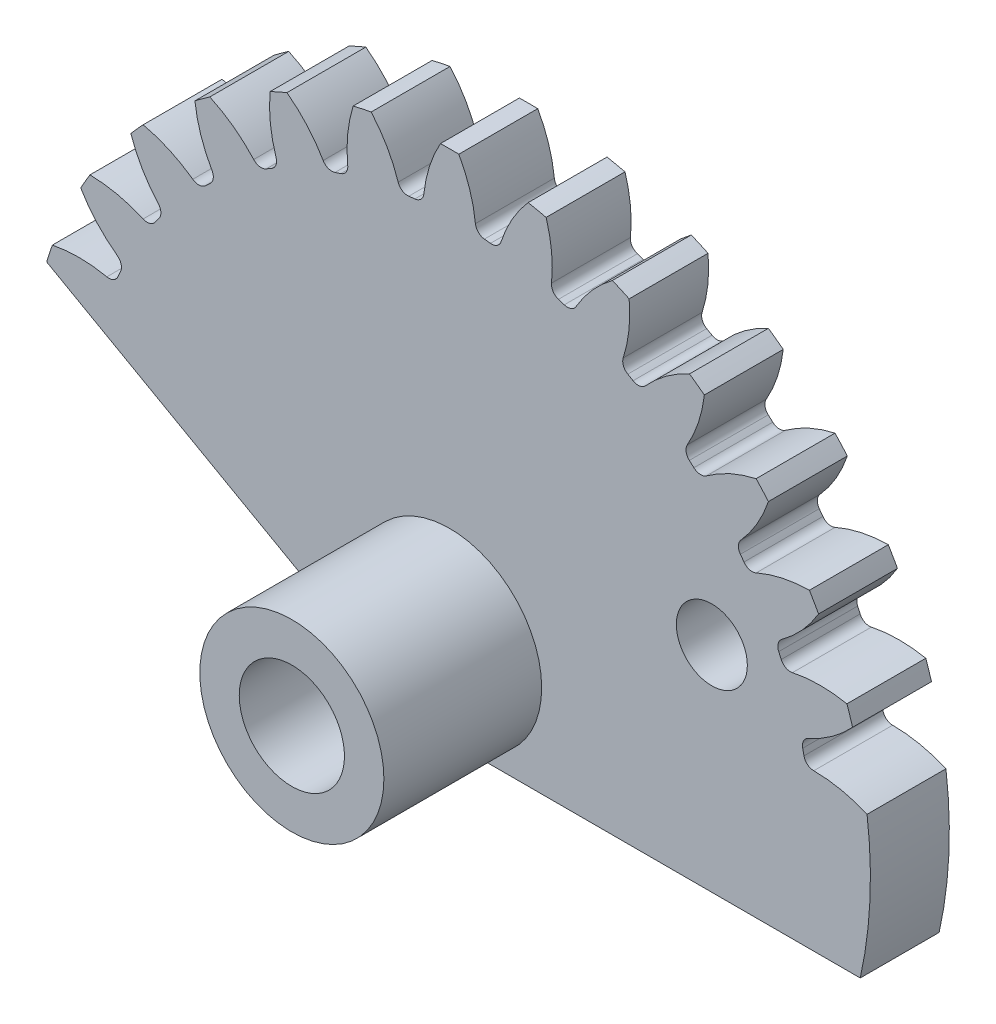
ISO-10303-21;
HEADER;
FILE_DESCRIPTION(('STEP AP214'),'2;1');
FILE_NAME('part.step','',(''),(''),'','','');
FILE_SCHEMA(('AUTOMOTIVE_DESIGN { 1 0 10303 214 1 1 1 1 }'));
ENDSEC;
DATA;
#1=APPLICATION_CONTEXT('core data for automotive mechanical design processes');
#2=APPLICATION_PROTOCOL_DEFINITION('international standard','automotive_design',2000,#1);
#3=PRODUCT_CONTEXT('',#1,'mechanical');
#4=PRODUCT('Part','Part','',(#3));
#5=PRODUCT_RELATED_PRODUCT_CATEGORY('part','',(#4));
#6=PRODUCT_DEFINITION_FORMATION('','',#4);
#7=PRODUCT_DEFINITION_CONTEXT('part definition',#1,'design');
#8=PRODUCT_DEFINITION('design','',#6,#7);
#9=PRODUCT_DEFINITION_SHAPE('','',#8);
#10=(LENGTH_UNIT() NAMED_UNIT(*) SI_UNIT(.MILLI.,.METRE.));
#11=(NAMED_UNIT(*) PLANE_ANGLE_UNIT() SI_UNIT($,.RADIAN.));
#12=(NAMED_UNIT(*) SI_UNIT($,.STERADIAN.) SOLID_ANGLE_UNIT());
#13=UNCERTAINTY_MEASURE_WITH_UNIT(LENGTH_MEASURE(1.E-05),#10,'distance_accuracy_value','');
#14=(GEOMETRIC_REPRESENTATION_CONTEXT(3) GLOBAL_UNCERTAINTY_ASSIGNED_CONTEXT((#13)) GLOBAL_UNIT_ASSIGNED_CONTEXT((#10,
#11,#12)) REPRESENTATION_CONTEXT('',''));
#15=CARTESIAN_POINT('',(0.,0.,0.));
#16=DIRECTION('',(0.,0.,1.));
#17=DIRECTION('',(1.,0.,0.));
#18=AXIS2_PLACEMENT_3D('',#15,#16,#17);
#19=CARTESIAN_POINT('',(0.,0.,3.));
#20=DIRECTION('',(0.,0.,0.999999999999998));
#21=DIRECTION('',(1.,0.,0.));
#22=AXIS2_PLACEMENT_3D('',#19,#20,#21);
#23=PLANE('',#22);
#24=CARTESIAN_POINT('',(9.96938565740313,4.6488008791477,3.));
#25=DIRECTION('',(0.,0.,0.999999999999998));
#26=DIRECTION('',(1.,0.,0.));
#27=AXIS2_PLACEMENT_3D('',#24,#25,#26);
#28=CIRCLE('',#27,1.35);
#29=CARTESIAN_POINT('',(11.3193856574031,4.6488008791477,3.));
#30=VERTEX_POINT('',#29);
#31=EDGE_CURVE('E1334',#30,#30,#28,.T.);
#32=ORIENTED_EDGE('',*,*,#31,.F.);
#33=EDGE_LOOP('',(#32));
#34=FACE_BOUND('',#33,.T.);
#35=DIRECTION('',(-0.871354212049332,0.490654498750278,0.));
#36=VECTOR('',#35,1.);
#37=CARTESIAN_POINT('',(-15.3213040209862,4.61060116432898,3.));
#38=LINE('',#37,#36);
#39=CARTESIAN_POINT('',(-1.71729074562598,-3.04973974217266,3.));
#40=VERTEX_POINT('',#39);
#41=CARTESIAN_POINT('',(-15.3213040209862,4.61060116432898,3.));
#42=VERTEX_POINT('',#41);
#43=EDGE_CURVE('E549',#40,#42,#38,.T.);
#44=ORIENTED_EDGE('',*,*,#43,.F.);
#45=CARTESIAN_POINT('',(0.,0.,3.));
#46=DIRECTION('',(0.,0.,0.999999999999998));
#47=DIRECTION('',(1.,0.,0.));
#48=AXIS2_PLACEMENT_3D('',#45,#46,#47);
#49=CIRCLE('',#48,3.5);
#50=CARTESIAN_POINT('',(0.,-3.5,3.));
#51=VERTEX_POINT('',#50);
#52=EDGE_CURVE('E543',#51,#40,#49,.T.);
#53=ORIENTED_EDGE('',*,*,#52,.F.);
#54=DIRECTION('',(-1.,0.,0.));
#55=VECTOR('',#54,1.);
#56=CARTESIAN_POINT('',(0.,-3.5,3.));
#57=LINE('',#56,#55);
#58=CARTESIAN_POINT('',(15.612494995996,-3.5,3.));
#59=VERTEX_POINT('',#58);
#60=EDGE_CURVE('E546',#59,#51,#57,.T.);
#61=ORIENTED_EDGE('',*,*,#60,.F.);
#62=CARTESIAN_POINT('',(0.,0.,3.));
#63=DIRECTION('',(0.,0.,0.999999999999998));
#64=DIRECTION('',(-0.104528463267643,-0.994521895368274,0.));
#65=AXIS2_PLACEMENT_3D('',#62,#63,#64);
#66=CIRCLE('',#65,16.);
#67=CARTESIAN_POINT('',(15.8720081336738,2.01974201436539,3.));
#68=VERTEX_POINT('',#67);
#69=EDGE_CURVE('E855',#59,#68,#66,.T.);
#70=ORIENTED_EDGE('',*,*,#69,.T.);
#71=CARTESIAN_POINT('',(13.8364334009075,-2.68944429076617,3.));
#72=DIRECTION('',(0.,0.,0.999999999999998));
#73=DIRECTION('',(0.104528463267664,-0.994521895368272,0.));
#74=AXIS2_PLACEMENT_3D('',#71,#72,#73);
#75=CIRCLE('',#74,5.13030214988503);
#76=CARTESIAN_POINT('',(13.8449363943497,2.44085081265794,3.));
#77=VERTEX_POINT('',#76);
#78=EDGE_CURVE('E838',#68,#77,#75,.T.);
#79=ORIENTED_EDGE('',*,*,#78,.T.);
#80=CARTESIAN_POINT('',(13.8455662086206,2.82085029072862,3.));
#81=DIRECTION('',(0.,0.,-0.999999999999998));
#82=DIRECTION('',(0.104528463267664,-0.994521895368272,0.));
#83=AXIS2_PLACEMENT_3D('',#80,#81,#82);
#84=CIRCLE('',#83,0.380000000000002);
#85=CARTESIAN_POINT('',(13.47321552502,2.74498878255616,3.));
#86=VERTEX_POINT('',#85);
#87=EDGE_CURVE('E840',#77,#86,#84,.T.);
#88=ORIENTED_EDGE('',*,*,#87,.T.);
#89=CARTESIAN_POINT('',(0.,0.,3.));
#90=DIRECTION('',(0.,0.,0.999999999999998));
#91=DIRECTION('',(0.104528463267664,-0.994521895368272,0.));
#92=AXIS2_PLACEMENT_3D('',#89,#90,#91);
#93=CIRCLE('',#92,13.75);
#94=CARTESIAN_POINT('',(13.4248823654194,2.9723784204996,3.));
#95=VERTEX_POINT('',#94);
#96=EDGE_CURVE('E842',#86,#95,#93,.T.);
#97=ORIENTED_EDGE('',*,*,#96,.T.);
#98=CARTESIAN_POINT('',(13.7958972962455,3.05452415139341,3.));
#99=DIRECTION('',(0.,0.,-0.999999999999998));
#100=DIRECTION('',(-0.309016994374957,0.95105651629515,0.));
#101=AXIS2_PLACEMENT_3D('',#98,#99,#100);
#102=CIRCLE('',#101,0.380000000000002);
#103=CARTESIAN_POINT('',(13.6407622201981,3.40141477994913,3.));
#104=VERTEX_POINT('',#103);
#105=EDGE_CURVE('E802',#95,#104,#102,.T.);
#106=ORIENTED_EDGE('',*,*,#105,.T.);
#107=CARTESIAN_POINT('',(11.5463153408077,8.08471408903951,3.));
#108=DIRECTION('',(0.,0.,0.999999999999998));
#109=DIRECTION('',(0.309016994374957,-0.95105651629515,0.));
#110=AXIS2_PLACEMENT_3D('',#107,#108,#109);
#111=CIRCLE('',#110,5.13030214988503);
#112=CARTESIAN_POINT('',(15.3213040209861,4.61060116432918,3.));
#113=VERTEX_POINT('',#112);
#114=EDGE_CURVE('E804',#104,#113,#111,.T.);
#115=ORIENTED_EDGE('',*,*,#114,.T.);
#116=CARTESIAN_POINT('',(0.,0.,3.));
#117=DIRECTION('',(0.,0.,0.999999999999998));
#118=DIRECTION('',(0.309016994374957,-0.95105651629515,0.));
#119=AXIS2_PLACEMENT_3D('',#116,#117,#118);
#120=CIRCLE('',#119,16.);
#121=CARTESIAN_POINT('',(15.1052386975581,5.27558185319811,3.));
#122=VERTEX_POINT('',#121);
#123=EDGE_CURVE('E806',#113,#122,#120,.T.);
#124=ORIENTED_EDGE('',*,*,#123,.T.);
#125=CARTESIAN_POINT('',(14.0932410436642,0.246082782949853,3.));
#126=DIRECTION('',(0.,0.,0.999999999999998));
#127=DIRECTION('',(0.309016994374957,-0.95105651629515,0.));
#128=AXIS2_PLACEMENT_3D('',#125,#126,#127);
#129=CIRCLE('',#128,5.13030214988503);
#130=CARTESIAN_POINT('',(13.0349098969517,5.26603650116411,3.));
#131=VERTEX_POINT('',#130);
#132=EDGE_CURVE('E808',#122,#131,#129,.T.);
#133=ORIENTED_EDGE('',*,*,#132,.T.);
#134=CARTESIAN_POINT('',(12.9565196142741,5.637863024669,3.));
#135=DIRECTION('',(0.,0.,-0.999999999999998));
#136=DIRECTION('',(0.309016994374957,-0.95105651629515,0.));
#137=AXIS2_PLACEMENT_3D('',#134,#135,#136);
#138=CIRCLE('',#137,0.380000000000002);
#139=CARTESIAN_POINT('',(12.6080781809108,5.48624321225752,3.));
#140=VERTEX_POINT('',#139);
#141=EDGE_CURVE('E810',#131,#140,#138,.T.);
#142=ORIENTED_EDGE('',*,*,#141,.T.);
#143=CARTESIAN_POINT('',(0.,0.,3.));
#144=DIRECTION('',(0.,0.,0.999999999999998));
#145=DIRECTION('',(0.309016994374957,-0.95105651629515,0.));
#146=AXIS2_PLACEMENT_3D('',#143,#144,#145);
#147=CIRCLE('',#146,13.75);
#148=CARTESIAN_POINT('',(12.5135242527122,5.6986148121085,3.));
#149=VERTEX_POINT('',#148);
#150=EDGE_CURVE('E812',#140,#149,#147,.T.);
#151=ORIENTED_EDGE('',*,*,#150,.T.);
#152=CARTESIAN_POINT('',(12.8593525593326,5.8561038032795,3.));
#153=DIRECTION('',(0.,0.,-0.999999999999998));
#154=DIRECTION('',(-0.50000000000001,0.866025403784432,0.));
#155=AXIS2_PLACEMENT_3D('',#152,#153,#154);
#156=CIRCLE('',#155,0.380000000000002);
#157=CARTESIAN_POINT('',(12.6354849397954,6.16315964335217,3.));
#158=VERTEX_POINT('',#157);
#159=EDGE_CURVE('E760',#149,#158,#156,.T.);
#160=ORIENTED_EDGE('',*,*,#159,.T.);
#161=CARTESIAN_POINT('',(9.61309407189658,10.3086576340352,3.));
#162=DIRECTION('',(0.,0.,0.999999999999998));
#163=DIRECTION('',(0.50000000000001,-0.866025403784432,0.));
#164=AXIS2_PLACEMENT_3D('',#161,#162,#163);
#165=CIRCLE('',#164,5.13030214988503);
#166=CARTESIAN_POINT('',(14.0278988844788,7.69532669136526,3.));
#167=VERTEX_POINT('',#166);
#168=EDGE_CURVE('E762',#158,#167,#165,.T.);
#169=ORIENTED_EDGE('',*,*,#168,.T.);
#170=CARTESIAN_POINT('',(0.,0.,3.));
#171=DIRECTION('',(0.,0.,0.999999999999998));
#172=DIRECTION('',(0.50000000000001,-0.866025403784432,0.));
#173=AXIS2_PLACEMENT_3D('',#170,#171,#172);
#174=CIRCLE('',#173,16.);
#175=CARTESIAN_POINT('',(13.678297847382,8.30085344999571,3.));
#176=VERTEX_POINT('',#175);
#177=EDGE_CURVE('E764',#167,#176,#174,.T.);
#178=ORIENTED_EDGE('',*,*,#177,.T.);
#179=CARTESIAN_POINT('',(13.734106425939,3.17085485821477,3.));
#180=DIRECTION('',(0.,0.,0.999999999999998));
#181=DIRECTION('',(0.50000000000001,-0.866025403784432,0.));
#182=AXIS2_PLACEMENT_3D('',#179,#180,#181);
#183=CIRCLE('',#182,5.13030214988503);
#184=CARTESIAN_POINT('',(11.6551952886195,7.8610711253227,3.));
#185=VERTEX_POINT('',#184);
#186=EDGE_CURVE('E766',#176,#185,#183,.T.);
#187=ORIENTED_EDGE('',*,*,#186,.T.);
#188=CARTESIAN_POINT('',(11.5012109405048,8.20847409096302,3.));
#189=DIRECTION('',(0.,0.,-0.999999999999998));
#190=DIRECTION('',(0.50000000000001,-0.866025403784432,0.));
#191=AXIS2_PLACEMENT_3D('',#188,#189,#190);
#192=CIRCLE('',#191,0.380000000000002);
#193=CARTESIAN_POINT('',(11.1919073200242,7.98772248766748,3.));
#194=VERTEX_POINT('',#193);
#195=EDGE_CURVE('E768',#185,#194,#192,.T.);
#196=ORIENTED_EDGE('',*,*,#195,.T.);
#197=CARTESIAN_POINT('',(0.,0.,3.));
#198=DIRECTION('',(0.,0.,0.999999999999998));
#199=DIRECTION('',(0.50000000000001,-0.866025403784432,0.));
#200=AXIS2_PLACEMENT_3D('',#197,#198,#199);
#201=CIRCLE('',#200,13.75);
#202=CARTESIAN_POINT('',(11.0552650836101,8.1757943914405,3.));
#203=VERTEX_POINT('',#202);
#204=EDGE_CURVE('E770',#194,#203,#201,.T.);
#205=ORIENTED_EDGE('',*,*,#204,.T.);
#206=CARTESIAN_POINT('',(11.3607924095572,8.40174361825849,3.));
#207=DIRECTION('',(0.,0.,-0.999999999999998));
#208=DIRECTION('',(-0.669130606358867,0.743144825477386,0.));
#209=AXIS2_PLACEMENT_3D('',#206,#207,#208);
#210=CIRCLE('',#209,0.380000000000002);
#211=CARTESIAN_POINT('',(11.0779763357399,8.65554485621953,3.));
#212=VERTEX_POINT('',#211);
#213=EDGE_CURVE('E718',#203,#212,#210,.T.);
#214=ORIENTED_EDGE('',*,*,#213,.T.);
#215=CARTESIAN_POINT('',(7.25973446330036,12.0820633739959,3.));
#216=DIRECTION('',(0.,0.,0.999999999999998));
#217=DIRECTION('',(0.669130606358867,-0.743144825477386,0.));
#218=AXIS2_PLACEMENT_3D('',#215,#216,#217);
#219=CIRCLE('',#218,5.13030214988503);
#220=CARTESIAN_POINT('',(12.1214072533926,10.4437295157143,3.));
#221=VERTEX_POINT('',#220);
#222=EDGE_CURVE('E720',#212,#221,#219,.T.);
#223=ORIENTED_EDGE('',*,*,#222,.T.);
#224=CARTESIAN_POINT('',(0.,0.,3.));
#225=DIRECTION('',(0.,0.,0.999999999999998));
#226=DIRECTION('',(0.669130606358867,-0.743144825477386,0.));
#227=AXIS2_PLACEMENT_3D('',#224,#225,#226);
#228=CIRCLE('',#227,16.);
#229=CARTESIAN_POINT('',(11.65354974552,10.9633379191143,3.));
#230=VERTEX_POINT('',#229);
#231=EDGE_CURVE('E722',#221,#230,#228,.T.);
#232=ORIENTED_EDGE('',*,*,#231,.T.);
#233=CARTESIAN_POINT('',(12.7747254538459,5.95704536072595,3.));
#234=DIRECTION('',(0.,0.,0.999999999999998));
#235=DIRECTION('',(0.669130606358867,-0.743144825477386,0.));
#236=AXIS2_PLACEMENT_3D('',#233,#234,#235);
#237=CIRCLE('',#236,5.13030214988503);
#238=CARTESIAN_POINT('',(9.76609271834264,10.1125392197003,3.));
#239=VERTEX_POINT('',#238);
#240=EDGE_CURVE('E724',#230,#239,#237,.T.);
#241=ORIENTED_EDGE('',*,*,#240,.T.);
#242=CARTESIAN_POINT('',(9.54324415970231,10.4203354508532,3.));
#243=DIRECTION('',(0.,0.,-0.999999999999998));
#244=DIRECTION('',(0.669130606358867,-0.743144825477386,0.));
#245=AXIS2_PLACEMENT_3D('',#242,#243,#244);
#246=CIRCLE('',#245,0.380000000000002);
#247=CARTESIAN_POINT('',(9.28659640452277,10.1400999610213,3.));
#248=VERTEX_POINT('',#247);
#249=EDGE_CURVE('E726',#239,#248,#246,.T.);
#250=ORIENTED_EDGE('',*,*,#249,.T.);
#251=CARTESIAN_POINT('',(0.,0.,3.));
#252=DIRECTION('',(0.,0.,0.999999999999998));
#253=DIRECTION('',(0.669130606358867,-0.743144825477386,0.));
#254=AXIS2_PLACEMENT_3D('',#251,#252,#253);
#255=CIRCLE('',#254,13.75);
#256=CARTESIAN_POINT('',(9.11383778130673,10.2956525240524,3.));
#257=VERTEX_POINT('',#256);
#258=EDGE_CURVE('E728',#248,#257,#255,.T.);
#259=ORIENTED_EDGE('',*,*,#258,.T.);
#260=CARTESIAN_POINT('',(9.36571111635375,10.5801869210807,3.));
#261=DIRECTION('',(0.,0.,-0.999999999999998));
#262=DIRECTION('',(-0.809016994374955,0.587785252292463,0.));
#263=AXIS2_PLACEMENT_3D('',#260,#261,#262);
#264=CIRCLE('',#263,0.380000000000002);
#265=CARTESIAN_POINT('',(9.03630700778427,10.7696412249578,3.));
#266=VERTEX_POINT('',#265);
#267=EDGE_CURVE('E676',#257,#266,#264,.T.);
#268=ORIENTED_EDGE('',*,*,#267,.T.);
#269=CARTESIAN_POINT('',(4.58908962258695,13.3274249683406,3.));
#270=DIRECTION('',(0.,0.,0.999999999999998));
#271=DIRECTION('',(0.809016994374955,-0.587785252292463,0.));
#272=AXIS2_PLACEMENT_3D('',#269,#270,#271);
#273=CIRCLE('',#272,5.13030214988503);
#274=CARTESIAN_POINT('',(9.68515196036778,12.7356912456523,3.));
#275=VERTEX_POINT('',#274);
#276=EDGE_CURVE('E678',#266,#275,#273,.T.);
#277=ORIENTED_EDGE('',*,*,#276,.T.);
#278=CARTESIAN_POINT('',(0.,0.,3.));
#279=DIRECTION('',(0.,0.,0.999999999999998));
#280=DIRECTION('',(0.809016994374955,-0.587785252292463,0.));
#281=AXIS2_PLACEMENT_3D('',#278,#279,#280);
#282=CIRCLE('',#281,16.);
#283=CARTESIAN_POINT('',(9.11948559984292,13.1466719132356,3.));
#284=VERTEX_POINT('',#283);
#285=EDGE_CURVE('E680',#275,#284,#282,.T.);
#286=ORIENTED_EDGE('',*,*,#285,.T.);
#287=CARTESIAN_POINT('',(11.2570276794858,8.48288439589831,3.));
#288=DIRECTION('',(0.,0.,0.999999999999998));
#289=DIRECTION('',(0.809016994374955,-0.587785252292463,0.));
#290=AXIS2_PLACEMENT_3D('',#287,#288,#289);
#291=CIRCLE('',#290,5.13030214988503);
#292=CARTESIAN_POINT('',(7.45016503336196,11.9220408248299,3.));
#293=VERTEX_POINT('',#292);
#294=EDGE_CURVE('E682',#284,#293,#291,.T.);
#295=ORIENTED_EDGE('',*,*,#294,.T.);
#296=CARTESIAN_POINT('',(7.16819181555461,12.1767781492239,3.));
#297=DIRECTION('',(0.,0.,-0.999999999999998));
#298=DIRECTION('',(0.809016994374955,-0.587785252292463,0.));
#299=AXIS2_PLACEMENT_3D('',#296,#297,#298);
#300=CIRCLE('',#299,0.380000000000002);
#301=CARTESIAN_POINT('',(6.97541666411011,11.8493064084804,3.));
#302=VERTEX_POINT('',#301);
#303=EDGE_CURVE('E684',#293,#302,#300,.T.);
#304=ORIENTED_EDGE('',*,*,#303,.T.);
#305=CARTESIAN_POINT('',(0.,0.,3.));
#306=DIRECTION('',(0.,0.,0.999999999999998));
#307=DIRECTION('',(0.809016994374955,-0.587785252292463,0.));
#308=AXIS2_PLACEMENT_3D('',#305,#306,#307);
#309=CIRCLE('',#308,13.75);
#310=CARTESIAN_POINT('',(6.77409203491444,11.965541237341,3.));
#311=VERTEX_POINT('',#310);
#312=EDGE_CURVE('E686',#302,#311,#309,.T.);
#313=ORIENTED_EDGE('',*,*,#312,.T.);
#314=CARTESIAN_POINT('',(6.96130330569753,12.2962252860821,3.));
#315=DIRECTION('',(0.,0.,-0.999999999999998));
#316=DIRECTION('',(-0.913545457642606,0.406736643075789,0.));
#317=AXIS2_PLACEMENT_3D('',#314,#315,#316);
#318=CIRCLE('',#317,0.380000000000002);
#319=CARTESIAN_POINT('',(6.59970770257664,12.4130525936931,3.));
#320=VERTEX_POINT('',#319);
#321=EDGE_CURVE('E634',#311,#320,#318,.T.);
#322=ORIENTED_EDGE('',*,*,#321,.T.);
#323=CARTESIAN_POINT('',(1.71787954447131,13.9903141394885,3.));
#324=DIRECTION('',(0.,0.,0.999999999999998));
#325=DIRECTION('',(0.913545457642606,-0.406736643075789,0.));
#326=AXIS2_PLACEMENT_3D('',#323,#324,#325);
#327=CIRCLE('',#326,5.13030214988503);
#328=CARTESIAN_POINT('',(6.82560905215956,14.4710421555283,3.));
#329=VERTEX_POINT('',#328);
#330=EDGE_CURVE('E636',#320,#329,#327,.T.);
#331=ORIENTED_EDGE('',*,*,#330,.T.);
#332=CARTESIAN_POINT('',(0.,0.,3.));
#333=DIRECTION('',(0.,0.,0.999999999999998));
#334=DIRECTION('',(0.913545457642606,-0.406736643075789,0.));
#335=AXIS2_PLACEMENT_3D('',#332,#333,#334);
#336=CIRCLE('',#335,16.);
#337=CARTESIAN_POINT('',(6.18685617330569,14.7554332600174,3.));
#338=VERTEX_POINT('',#337);
#339=EDGE_CURVE('E638',#329,#338,#336,.T.);
#340=ORIENTED_EDGE('',*,*,#339,.T.);
#341=CARTESIAN_POINT('',(9.24734377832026,10.6379806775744,3.));
#342=DIRECTION('',(0.,0.,0.999999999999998));
#343=DIRECTION('',(0.913545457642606,-0.406736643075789,0.));
#344=AXIS2_PLACEMENT_3D('',#341,#342,#343);
#345=CIRCLE('',#344,5.13030214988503);
#346=CARTESIAN_POINT('',(4.80862938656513,13.2104920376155,3.));
#347=VERTEX_POINT('',#346);
#348=EDGE_CURVE('E640',#338,#347,#345,.T.);
#349=ORIENTED_EDGE('',*,*,#348,.T.);
#350=CARTESIAN_POINT('',(4.47985509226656,13.4010372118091,3.));
#351=DIRECTION('',(0.,0.,-0.999999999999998));
#352=DIRECTION('',(0.913545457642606,-0.406736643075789,0.));
#353=AXIS2_PLACEMENT_3D('',#350,#351,#352);
#354=CIRCLE('',#353,0.380000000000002);
#355=CARTESIAN_POINT('',(4.35937774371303,13.0406413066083,3.));
#356=VERTEX_POINT('',#355);
#357=EDGE_CURVE('E642',#347,#356,#354,.T.);
#358=ORIENTED_EDGE('',*,*,#357,.T.);
#359=CARTESIAN_POINT('',(0.,0.,3.));
#360=DIRECTION('',(0.,0.,0.999999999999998));
#361=DIRECTION('',(0.913545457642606,-0.406736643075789,0.));
#362=AXIS2_PLACEMENT_3D('',#359,#360,#361);
#363=CIRCLE('',#362,13.75);
#364=CARTESIAN_POINT('',(4.13828596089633,13.1124783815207,3.));
#365=VERTEX_POINT('',#364);
#366=EDGE_CURVE('E644',#356,#365,#363,.T.);
#367=ORIENTED_EDGE('',*,*,#366,.T.);
#368=CARTESIAN_POINT('',(4.25265313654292,13.4748596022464,3.));
#369=DIRECTION('',(0.,0.,-0.999999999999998));
#370=DIRECTION('',(-0.978147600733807,0.207911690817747,0.));
#371=AXIS2_PLACEMENT_3D('',#368,#369,#370);
#372=CIRCLE('',#371,0.380000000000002);
#373=CARTESIAN_POINT('',(3.87466950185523,13.5139539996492,3.));
#374=VERTEX_POINT('',#373);
#375=EDGE_CURVE('E593',#365,#374,#372,.T.);
#376=ORIENTED_EDGE('',*,*,#375,.T.);
#377=CARTESIAN_POINT('',(-1.22841011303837,14.0417594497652,3.));
#378=DIRECTION('',(0.,0.,0.999999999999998));
#379=DIRECTION('',(0.978147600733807,-0.207911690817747,0.));
#380=AXIS2_PLACEMENT_3D('',#377,#378,#379);
#381=CIRCLE('',#380,5.13030214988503);
#382=CARTESIAN_POINT('',(3.66775427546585,15.5739390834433,3.));
#383=VERTEX_POINT('',#382);
#384=EDGE_CURVE('E595',#374,#383,#381,.T.);
#385=ORIENTED_EDGE('',*,*,#384,.T.);
#386=CARTESIAN_POINT('',(0.,0.,3.));
#387=DIRECTION('',(0.,0.,0.999999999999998));
#388=DIRECTION('',(0.978147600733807,-0.207911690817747,0.));
#389=AXIS2_PLACEMENT_3D('',#386,#387,#388);
#390=CIRCLE('',#389,16.);
#391=CARTESIAN_POINT('',(2.98383144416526,15.7193113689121,3.));
#392=VERTEX_POINT('',#391);
#393=EDGE_CURVE('E597',#383,#392,#390,.T.);
#394=ORIENTED_EDGE('',*,*,#393,.T.);
#395=CARTESIAN_POINT('',(6.8335065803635,12.3281461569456,3.));
#396=DIRECTION('',(0.,0.,0.999999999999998));
#397=DIRECTION('',(0.978147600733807,-0.207911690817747,0.));
#398=AXIS2_PLACEMENT_3D('',#395,#396,#397);
#399=CIRCLE('',#398,5.13030214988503);
#400=CARTESIAN_POINT('',(1.95693356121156,13.9215813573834,3.));
#401=VERTEX_POINT('',#400);
#402=EDGE_CURVE('E599',#392,#401,#399,.T.);
#403=ORIENTED_EDGE('',*,*,#402,.T.);
#404=CARTESIAN_POINT('',(1.5957272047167,14.0396066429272,3.));
#405=DIRECTION('',(0.,0.,-0.999999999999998));
#406=DIRECTION('',(0.978147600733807,-0.207911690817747,0.));
#407=AXIS2_PLACEMENT_3D('',#404,#405,#406);
#408=CIRCLE('',#407,0.380000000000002);
#409=CARTESIAN_POINT('',(1.5528130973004,13.6620376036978,3.));
#410=VERTEX_POINT('',#409);
#411=EDGE_CURVE('E601',#401,#410,#408,.T.);
#412=ORIENTED_EDGE('',*,*,#411,.T.);
#413=CARTESIAN_POINT('',(0.,0.,3.));
#414=DIRECTION('',(0.,0.,0.999999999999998));
#415=DIRECTION('',(1.,0.,0.));
#416=AXIS2_PLACEMENT_3D('',#413,#414,#415);
#417=CIRCLE('',#416,13.75);
#418=CARTESIAN_POINT('',(1.32161693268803,13.6863372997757,3.));
#419=VERTEX_POINT('',#418);
#420=EDGE_CURVE('E1105',#410,#419,#417,.T.);
#421=ORIENTED_EDGE('',*,*,#420,.T.);
#422=CARTESIAN_POINT('',(1.35814161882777,14.0645778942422,3.));
#423=DIRECTION('',(0.,0.,-0.999999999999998));
#424=DIRECTION('',(-1.,0.,0.));
#425=AXIS2_PLACEMENT_3D('',#422,#423,#424);
#426=CIRCLE('',#425,0.380000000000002);
#427=CARTESIAN_POINT('',(0.980289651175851,14.0242307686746,3.));
#428=VERTEX_POINT('',#427);
#429=EDGE_CURVE('E1107',#419,#428,#426,.T.);
#430=ORIENTED_EDGE('',*,*,#429,.T.);
#431=CARTESIAN_POINT('',(-4.12101235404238,13.4795124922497,3.));
#432=DIRECTION('',(0.,0.,0.999999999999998));
#433=DIRECTION('',(1.,0.,0.));
#434=AXIS2_PLACEMENT_3D('',#431,#432,#433);
#435=CIRCLE('',#434,5.13030214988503);
#436=CARTESIAN_POINT('',(0.349601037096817,15.9961801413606,3.));
#437=VERTEX_POINT('',#436);
#438=EDGE_CURVE('E1109',#428,#437,#435,.T.);
#439=ORIENTED_EDGE('',*,*,#438,.T.);
#440=CARTESIAN_POINT('',(0.,0.,3.));
#441=DIRECTION('',(0.,0.,0.999999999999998));
#442=DIRECTION('',(1.,0.,0.));
#443=AXIS2_PLACEMENT_3D('',#440,#441,#442);
#444=CIRCLE('',#443,16.);
#445=CARTESIAN_POINT('',(-0.34960103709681,15.9961801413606,3.));
#446=VERTEX_POINT('',#445);
#447=EDGE_CURVE('E1111',#437,#446,#444,.T.);
#448=ORIENTED_EDGE('',*,*,#447,.T.);
#449=CARTESIAN_POINT('',(4.12101235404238,13.4795124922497,3.));
#450=DIRECTION('',(0.,0.,0.999999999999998));
#451=DIRECTION('',(1.,0.,0.));
#452=AXIS2_PLACEMENT_3D('',#449,#450,#451);
#453=CIRCLE('',#452,5.13030214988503);
#454=CARTESIAN_POINT('',(-0.98028965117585,14.0242307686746,3.));
#455=VERTEX_POINT('',#454);
#456=EDGE_CURVE('E56',#446,#455,#453,.T.);
#457=ORIENTED_EDGE('',*,*,#456,.T.);
#458=CARTESIAN_POINT('',(-1.35814161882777,14.0645778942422,3.));
#459=DIRECTION('',(0.,0.,-0.999999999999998));
#460=DIRECTION('',(1.,0.,0.));
#461=AXIS2_PLACEMENT_3D('',#458,#459,#460);
#462=CIRCLE('',#461,0.380000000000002);
#463=CARTESIAN_POINT('',(-1.32161693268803,13.6863372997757,3.));
#464=VERTEX_POINT('',#463);
#465=EDGE_CURVE('E51',#455,#464,#462,.T.);
#466=ORIENTED_EDGE('',*,*,#465,.T.);
#467=CARTESIAN_POINT('',(0.,0.,3.));
#468=DIRECTION('',(0.,0.,0.999999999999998));
#469=DIRECTION('',(1.,0.,0.));
#470=AXIS2_PLACEMENT_3D('',#467,#468,#469);
#471=CIRCLE('',#470,13.75);
#472=CARTESIAN_POINT('',(-1.55281309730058,13.6620376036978,3.));
#473=VERTEX_POINT('',#472);
#474=EDGE_CURVE('E1115',#464,#473,#471,.T.);
#475=ORIENTED_EDGE('',*,*,#474,.T.);
#476=CARTESIAN_POINT('',(-1.59572720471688,14.0396066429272,3.));
#477=DIRECTION('',(0.,0.,-0.999999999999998));
#478=DIRECTION('',(-0.978147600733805,-0.20791169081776,0.));
#479=AXIS2_PLACEMENT_3D('',#476,#477,#478);
#480=CIRCLE('',#479,0.380000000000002);
#481=CARTESIAN_POINT('',(-1.95693356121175,13.9215813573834,3.));
#482=VERTEX_POINT('',#481);
#483=EDGE_CURVE('E1061',#473,#482,#480,.T.);
#484=ORIENTED_EDGE('',*,*,#483,.T.);
#485=CARTESIAN_POINT('',(-6.83350658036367,12.3281461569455,3.));
#486=DIRECTION('',(0.,0.,0.999999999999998));
#487=DIRECTION('',(0.978147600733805,0.20791169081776,0.));
#488=AXIS2_PLACEMENT_3D('',#485,#486,#487);
#489=CIRCLE('',#488,5.13030214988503);
#490=CARTESIAN_POINT('',(-2.98383144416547,15.7193113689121,3.));
#491=VERTEX_POINT('',#490);
#492=EDGE_CURVE('E1063',#482,#491,#489,.T.);
#493=ORIENTED_EDGE('',*,*,#492,.T.);
#494=CARTESIAN_POINT('',(0.,0.,3.));
#495=DIRECTION('',(0.,0.,0.999999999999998));
#496=DIRECTION('',(0.978147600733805,0.20791169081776,0.));
#497=AXIS2_PLACEMENT_3D('',#494,#495,#496);
#498=CIRCLE('',#497,16.);
#499=CARTESIAN_POINT('',(-3.66775427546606,15.5739390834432,3.));
#500=VERTEX_POINT('',#499);
#501=EDGE_CURVE('E1065',#491,#500,#498,.T.);
#502=ORIENTED_EDGE('',*,*,#501,.T.);
#503=CARTESIAN_POINT('',(1.22841011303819,14.0417594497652,3.));
#504=DIRECTION('',(0.,0.,0.999999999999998));
#505=DIRECTION('',(0.978147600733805,0.20791169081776,0.));
#506=AXIS2_PLACEMENT_3D('',#503,#504,#505);
#507=CIRCLE('',#506,5.13030214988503);
#508=CARTESIAN_POINT('',(-3.87466950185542,13.5139539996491,3.));
#509=VERTEX_POINT('',#508);
#510=EDGE_CURVE('E1067',#500,#509,#507,.T.);
#511=ORIENTED_EDGE('',*,*,#510,.T.);
#512=CARTESIAN_POINT('',(-4.2526531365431,13.4748596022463,3.));
#513=DIRECTION('',(0.,0.,-0.999999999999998));
#514=DIRECTION('',(0.978147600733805,0.20791169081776,0.));
#515=AXIS2_PLACEMENT_3D('',#512,#513,#514);
#516=CIRCLE('',#515,0.380000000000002);
#517=CARTESIAN_POINT('',(-4.13828596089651,13.1124783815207,3.));
#518=VERTEX_POINT('',#517);
#519=EDGE_CURVE('E1069',#509,#518,#516,.T.);
#520=ORIENTED_EDGE('',*,*,#519,.T.);
#521=CARTESIAN_POINT('',(0.,0.,3.));
#522=DIRECTION('',(0.,0.,0.999999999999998));
#523=DIRECTION('',(0.978147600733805,0.20791169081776,0.));
#524=AXIS2_PLACEMENT_3D('',#521,#522,#523);
#525=CIRCLE('',#524,13.75);
#526=CARTESIAN_POINT('',(-4.3593777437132,13.0406413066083,3.));
#527=VERTEX_POINT('',#526);
#528=EDGE_CURVE('E1071',#518,#527,#525,.T.);
#529=ORIENTED_EDGE('',*,*,#528,.T.);
#530=CARTESIAN_POINT('',(-4.47985509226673,13.4010372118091,3.));
#531=DIRECTION('',(0.,0.,-0.999999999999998));
#532=DIRECTION('',(-0.9135454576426,-0.406736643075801,0.));
#533=AXIS2_PLACEMENT_3D('',#530,#531,#532);
#534=CIRCLE('',#533,0.380000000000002);
#535=CARTESIAN_POINT('',(-4.80862938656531,13.2104920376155,3.));
#536=VERTEX_POINT('',#535);
#537=EDGE_CURVE('E1019',#527,#536,#534,.T.);
#538=ORIENTED_EDGE('',*,*,#537,.T.);
#539=CARTESIAN_POINT('',(-9.24734377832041,10.6379806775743,3.));
#540=DIRECTION('',(0.,0.,0.999999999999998));
#541=DIRECTION('',(0.9135454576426,0.406736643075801,0.));
#542=AXIS2_PLACEMENT_3D('',#539,#540,#541);
#543=CIRCLE('',#542,5.13030214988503);
#544=CARTESIAN_POINT('',(-6.18685617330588,14.7554332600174,3.));
#545=VERTEX_POINT('',#544);
#546=EDGE_CURVE('E1021',#536,#545,#543,.T.);
#547=ORIENTED_EDGE('',*,*,#546,.T.);
#548=CARTESIAN_POINT('',(0.,0.,3.));
#549=DIRECTION('',(0.,0.,0.999999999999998));
#550=DIRECTION('',(0.9135454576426,0.406736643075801,0.));
#551=AXIS2_PLACEMENT_3D('',#548,#549,#550);
#552=CIRCLE('',#551,16.);
#553=CARTESIAN_POINT('',(-6.82560905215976,14.4710421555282,3.));
#554=VERTEX_POINT('',#553);
#555=EDGE_CURVE('E1023',#545,#554,#552,.T.);
#556=ORIENTED_EDGE('',*,*,#555,.T.);
#557=CARTESIAN_POINT('',(-1.71787954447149,13.9903141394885,3.));
#558=DIRECTION('',(0.,0.,0.999999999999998));
#559=DIRECTION('',(0.9135454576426,0.406736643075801,0.));
#560=AXIS2_PLACEMENT_3D('',#557,#558,#559);
#561=CIRCLE('',#560,5.13030214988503);
#562=CARTESIAN_POINT('',(-6.5997077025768,12.413052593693,3.));
#563=VERTEX_POINT('',#562);
#564=EDGE_CURVE('E1025',#554,#563,#561,.T.);
#565=ORIENTED_EDGE('',*,*,#564,.T.);
#566=CARTESIAN_POINT('',(-6.96130330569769,12.296225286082,3.));
#567=DIRECTION('',(0.,0.,-0.999999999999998));
#568=DIRECTION('',(0.9135454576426,0.406736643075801,0.));
#569=AXIS2_PLACEMENT_3D('',#566,#567,#568);
#570=CIRCLE('',#569,0.380000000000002);
#571=CARTESIAN_POINT('',(-6.7740920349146,11.9655412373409,3.));
#572=VERTEX_POINT('',#571);
#573=EDGE_CURVE('E1027',#563,#572,#570,.T.);
#574=ORIENTED_EDGE('',*,*,#573,.T.);
#575=CARTESIAN_POINT('',(0.,0.,3.));
#576=DIRECTION('',(0.,0.,0.999999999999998));
#577=DIRECTION('',(0.9135454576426,0.406736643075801,0.));
#578=AXIS2_PLACEMENT_3D('',#575,#576,#577);
#579=CIRCLE('',#578,13.75);
#580=CARTESIAN_POINT('',(-6.97541666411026,11.8493064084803,3.));
#581=VERTEX_POINT('',#580);
#582=EDGE_CURVE('E1029',#572,#581,#579,.T.);
#583=ORIENTED_EDGE('',*,*,#582,.T.);
#584=CARTESIAN_POINT('',(-7.16819181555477,12.1767781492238,3.));
#585=DIRECTION('',(0.,0.,-0.999999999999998));
#586=DIRECTION('',(-0.809016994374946,-0.587785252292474,0.));
#587=AXIS2_PLACEMENT_3D('',#584,#585,#586);
#588=CIRCLE('',#587,0.380000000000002);
#589=CARTESIAN_POINT('',(-7.45016503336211,11.9220408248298,3.));
#590=VERTEX_POINT('',#589);
#591=EDGE_CURVE('E977',#581,#590,#588,.T.);
#592=ORIENTED_EDGE('',*,*,#591,.T.);
#593=CARTESIAN_POINT('',(-11.2570276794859,8.48288439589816,3.));
#594=DIRECTION('',(0.,0.,0.999999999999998));
#595=DIRECTION('',(0.809016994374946,0.587785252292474,0.));
#596=AXIS2_PLACEMENT_3D('',#593,#594,#595);
#597=CIRCLE('',#596,5.13030214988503);
#598=CARTESIAN_POINT('',(-9.1194855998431,13.1466719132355,3.));
#599=VERTEX_POINT('',#598);
#600=EDGE_CURVE('E979',#590,#599,#597,.T.);
#601=ORIENTED_EDGE('',*,*,#600,.T.);
#602=CARTESIAN_POINT('',(0.,0.,3.));
#603=DIRECTION('',(0.,0.,0.999999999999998));
#604=DIRECTION('',(0.809016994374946,0.587785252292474,0.));
#605=AXIS2_PLACEMENT_3D('',#602,#603,#604);
#606=CIRCLE('',#605,16.);
#607=CARTESIAN_POINT('',(-9.68515196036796,12.7356912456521,3.));
#608=VERTEX_POINT('',#607);
#609=EDGE_CURVE('E981',#599,#608,#606,.T.);
#610=ORIENTED_EDGE('',*,*,#609,.T.);
#611=CARTESIAN_POINT('',(-4.58908962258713,13.3274249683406,3.));
#612=DIRECTION('',(0.,0.,0.999999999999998));
#613=DIRECTION('',(0.809016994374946,0.587785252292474,0.));
#614=AXIS2_PLACEMENT_3D('',#611,#612,#613);
#615=CIRCLE('',#614,5.13030214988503);
#616=CARTESIAN_POINT('',(-9.03630700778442,10.7696412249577,3.));
#617=VERTEX_POINT('',#616);
#618=EDGE_CURVE('E983',#608,#617,#615,.T.);
#619=ORIENTED_EDGE('',*,*,#618,.T.);
#620=CARTESIAN_POINT('',(-9.3657111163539,10.5801869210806,3.));
#621=DIRECTION('',(0.,0.,-0.999999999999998));
#622=DIRECTION('',(0.809016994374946,0.587785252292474,0.));
#623=AXIS2_PLACEMENT_3D('',#620,#621,#622);
#624=CIRCLE('',#623,0.380000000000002);
#625=CARTESIAN_POINT('',(-9.11383778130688,10.2956525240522,3.));
#626=VERTEX_POINT('',#625);
#627=EDGE_CURVE('E985',#617,#626,#624,.T.);
#628=ORIENTED_EDGE('',*,*,#627,.T.);
#629=CARTESIAN_POINT('',(0.,0.,3.));
#630=DIRECTION('',(0.,0.,0.999999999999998));
#631=DIRECTION('',(0.809016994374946,0.587785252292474,0.));
#632=AXIS2_PLACEMENT_3D('',#629,#630,#631);
#633=CIRCLE('',#632,13.75);
#634=CARTESIAN_POINT('',(-9.28659640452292,10.1400999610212,3.));
#635=VERTEX_POINT('',#634);
#636=EDGE_CURVE('E987',#626,#635,#633,.T.);
#637=ORIENTED_EDGE('',*,*,#636,.T.);
#638=CARTESIAN_POINT('',(-9.54324415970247,10.420335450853,3.));
#639=DIRECTION('',(0.,0.,-0.999999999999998));
#640=DIRECTION('',(-0.669130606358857,-0.743144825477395,0.));
#641=AXIS2_PLACEMENT_3D('',#638,#639,#640);
#642=CIRCLE('',#641,0.380000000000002);
#643=CARTESIAN_POINT('',(-9.76609271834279,10.1125392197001,3.));
#644=VERTEX_POINT('',#643);
#645=EDGE_CURVE('E935',#635,#644,#642,.T.);
#646=ORIENTED_EDGE('',*,*,#645,.T.);
#647=CARTESIAN_POINT('',(-12.774725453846,5.95704536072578,3.));
#648=DIRECTION('',(0.,0.,0.999999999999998));
#649=DIRECTION('',(0.669130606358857,0.743144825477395,0.));
#650=AXIS2_PLACEMENT_3D('',#647,#648,#649);
#651=CIRCLE('',#650,5.13030214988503);
#652=CARTESIAN_POINT('',(-11.6535497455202,10.9633379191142,3.));
#653=VERTEX_POINT('',#652);
#654=EDGE_CURVE('E937',#644,#653,#651,.T.);
#655=ORIENTED_EDGE('',*,*,#654,.T.);
#656=CARTESIAN_POINT('',(0.,0.,3.));
#657=DIRECTION('',(0.,0.,0.999999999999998));
#658=DIRECTION('',(0.669130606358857,0.743144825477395,0.));
#659=AXIS2_PLACEMENT_3D('',#656,#657,#658);
#660=CIRCLE('',#659,16.);
#661=CARTESIAN_POINT('',(-12.1214072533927,10.4437295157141,3.));
#662=VERTEX_POINT('',#661);
#663=EDGE_CURVE('E939',#653,#662,#660,.T.);
#664=ORIENTED_EDGE('',*,*,#663,.T.);
#665=CARTESIAN_POINT('',(-7.25973446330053,12.0820633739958,3.));
#666=DIRECTION('',(0.,0.,0.999999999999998));
#667=DIRECTION('',(0.669130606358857,0.743144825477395,0.));
#668=AXIS2_PLACEMENT_3D('',#665,#666,#667);
#669=CIRCLE('',#668,5.13030214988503);
#670=CARTESIAN_POINT('',(-11.07797633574,8.65554485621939,3.));
#671=VERTEX_POINT('',#670);
#672=EDGE_CURVE('E941',#662,#671,#669,.T.);
#673=ORIENTED_EDGE('',*,*,#672,.T.);
#674=CARTESIAN_POINT('',(-11.3607924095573,8.40174361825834,3.));
#675=DIRECTION('',(0.,0.,-0.999999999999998));
#676=DIRECTION('',(0.669130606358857,0.743144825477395,0.));
#677=AXIS2_PLACEMENT_3D('',#674,#675,#676);
#678=CIRCLE('',#677,0.380000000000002);
#679=CARTESIAN_POINT('',(-11.0552650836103,8.17579439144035,3.));
#680=VERTEX_POINT('',#679);
#681=EDGE_CURVE('E943',#671,#680,#678,.T.);
#682=ORIENTED_EDGE('',*,*,#681,.T.);
#683=CARTESIAN_POINT('',(0.,0.,3.));
#684=DIRECTION('',(0.,0.,0.999999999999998));
#685=DIRECTION('',(0.669130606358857,0.743144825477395,0.));
#686=AXIS2_PLACEMENT_3D('',#683,#684,#685);
#687=CIRCLE('',#686,13.75);
#688=CARTESIAN_POINT('',(-11.1919073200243,7.98772248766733,3.));
#689=VERTEX_POINT('',#688);
#690=EDGE_CURVE('E945',#680,#689,#687,.T.);
#691=ORIENTED_EDGE('',*,*,#690,.T.);
#692=CARTESIAN_POINT('',(-11.501210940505,8.20847409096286,3.));
#693=DIRECTION('',(0.,0.,-0.999999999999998));
#694=DIRECTION('',(-0.499999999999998,-0.86602540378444,0.));
#695=AXIS2_PLACEMENT_3D('',#692,#693,#694);
#696=CIRCLE('',#695,0.380000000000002);
#697=CARTESIAN_POINT('',(-11.6551952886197,7.86107112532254,3.));
#698=VERTEX_POINT('',#697);
#699=EDGE_CURVE('E893',#689,#698,#696,.T.);
#700=ORIENTED_EDGE('',*,*,#699,.T.);
#701=CARTESIAN_POINT('',(-13.7341064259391,3.17085485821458,3.));
#702=DIRECTION('',(0.,0.,0.999999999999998));
#703=DIRECTION('',(0.499999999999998,0.86602540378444,0.));
#704=AXIS2_PLACEMENT_3D('',#701,#702,#703);
#705=CIRCLE('',#704,5.13030214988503);
#706=CARTESIAN_POINT('',(-13.6782978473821,8.30085344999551,3.));
#707=VERTEX_POINT('',#706);
#708=EDGE_CURVE('E895',#698,#707,#705,.T.);
#709=ORIENTED_EDGE('',*,*,#708,.T.);
#710=CARTESIAN_POINT('',(0.,0.,3.));
#711=DIRECTION('',(0.,0.,0.999999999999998));
#712=DIRECTION('',(0.499999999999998,0.86602540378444,0.));
#713=AXIS2_PLACEMENT_3D('',#710,#711,#712);
#714=CIRCLE('',#713,16.);
#715=CARTESIAN_POINT('',(-14.0278988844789,7.69532669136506,3.));
#716=VERTEX_POINT('',#715);
#717=EDGE_CURVE('E897',#707,#716,#714,.T.);
#718=ORIENTED_EDGE('',*,*,#717,.T.);
#719=CARTESIAN_POINT('',(-9.61309407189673,10.308657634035,3.));
#720=DIRECTION('',(0.,0.,0.999999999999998));
#721=DIRECTION('',(0.499999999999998,0.86602540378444,0.));
#722=AXIS2_PLACEMENT_3D('',#719,#720,#721);
#723=CIRCLE('',#722,5.13030214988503);
#724=CARTESIAN_POINT('',(-12.6354849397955,6.16315964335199,3.));
#725=VERTEX_POINT('',#724);
#726=EDGE_CURVE('E899',#716,#725,#723,.T.);
#727=ORIENTED_EDGE('',*,*,#726,.T.);
#728=CARTESIAN_POINT('',(-12.8593525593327,5.85610380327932,3.));
#729=DIRECTION('',(0.,0.,-0.999999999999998));
#730=DIRECTION('',(0.499999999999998,0.86602540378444,0.));
#731=AXIS2_PLACEMENT_3D('',#728,#729,#730);
#732=CIRCLE('',#731,0.380000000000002);
#733=CARTESIAN_POINT('',(-12.5135242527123,5.69861481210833,3.));
#734=VERTEX_POINT('',#733);
#735=EDGE_CURVE('E901',#725,#734,#732,.T.);
#736=ORIENTED_EDGE('',*,*,#735,.T.);
#737=CARTESIAN_POINT('',(0.,0.,3.));
#738=DIRECTION('',(0.,0.,0.999999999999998));
#739=DIRECTION('',(0.499999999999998,0.86602540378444,0.));
#740=AXIS2_PLACEMENT_3D('',#737,#738,#739);
#741=CIRCLE('',#740,13.75);
#742=CARTESIAN_POINT('',(-12.6080781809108,5.48624321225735,3.));
#743=VERTEX_POINT('',#742);
#744=EDGE_CURVE('E903',#734,#743,#741,.T.);
#745=ORIENTED_EDGE('',*,*,#744,.T.);
#746=CARTESIAN_POINT('',(-12.9565196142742,5.63786302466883,3.));
#747=DIRECTION('',(0.,0.,-0.999999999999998));
#748=DIRECTION('',(-0.309016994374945,-0.951056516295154,0.));
#749=AXIS2_PLACEMENT_3D('',#746,#747,#748);
#750=CIRCLE('',#749,0.380000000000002);
#751=CARTESIAN_POINT('',(-13.0349098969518,5.26603650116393,3.));
#752=VERTEX_POINT('',#751);
#753=EDGE_CURVE('E864',#743,#752,#750,.T.);
#754=ORIENTED_EDGE('',*,*,#753,.T.);
#755=CARTESIAN_POINT('',(-14.0932410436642,0.246082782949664,3.));
#756=DIRECTION('',(0.,0.,0.999999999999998));
#757=DIRECTION('',(0.309016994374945,0.951056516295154,0.));
#758=AXIS2_PLACEMENT_3D('',#755,#756,#757);
#759=CIRCLE('',#758,5.13030214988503);
#760=CARTESIAN_POINT('',(-15.1052386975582,5.27558185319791,3.));
#761=VERTEX_POINT('',#760);
#762=EDGE_CURVE('E866',#752,#761,#759,.T.);
#763=ORIENTED_EDGE('',*,*,#762,.T.);
#764=CARTESIAN_POINT('',(0.,0.,3.));
#765=DIRECTION('',(0.,0.,0.999999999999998));
#766=DIRECTION('',(0.309016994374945,0.951056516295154,0.));
#767=AXIS2_PLACEMENT_3D('',#764,#765,#766);
#768=CIRCLE('',#767,16.);
#769=EDGE_CURVE('E868',#761,#42,#768,.T.);
#770=ORIENTED_EDGE('',*,*,#769,.T.);
#771=EDGE_LOOP('',(#44,#53,#61,#70,#79,#88,#97,#106,#115,#124,#133,#142,#151,#160,#169,#178,
#187,#196,#205,#214,#223,#232,#241,#250,#259,#268,#277,#286,#295,#304,#313,#322,#331,#340,#349,
#358,#367,#376,#385,#394,#403,#412,#421,#430,#439,#448,#457,#466,#475,#484,#493,#502,#511,#520,
#529,#538,#547,#556,#565,#574,#583,#592,#601,#610,#619,#628,#637,#646,#655,#664,#673,#682,#691,
#700,#709,#718,#727,#736,#745,#754,#763,#770));
#772=FACE_BOUND('',#771,.T.);
#773=ADVANCED_FACE('F36',(#34,#772),#23,.T.);
#774=CARTESIAN_POINT('',(0.,0.,0.));
#775=DIRECTION('',(0.,0.,0.999999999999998));
#776=DIRECTION('',(1.,0.,0.));
#777=AXIS2_PLACEMENT_3D('',#774,#775,#776);
#778=PLANE('',#777);
#779=CARTESIAN_POINT('',(9.96938565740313,4.6488008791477,0.));
#780=DIRECTION('',(0.,0.,0.999999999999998));
#781=DIRECTION('',(1.,0.,0.));
#782=AXIS2_PLACEMENT_3D('',#779,#780,#781);
#783=CIRCLE('',#782,1.35);
#784=CARTESIAN_POINT('',(11.3193856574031,4.6488008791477,0.));
#785=VERTEX_POINT('',#784);
#786=EDGE_CURVE('E1331',#785,#785,#783,.F.);
#787=ORIENTED_EDGE('',*,*,#786,.F.);
#788=EDGE_LOOP('',(#787));
#789=FACE_BOUND('',#788,.T.);
#790=DIRECTION('',(1.,0.,0.));
#791=VECTOR('',#790,1.);
#792=CARTESIAN_POINT('',(0.,-3.5,0.));
#793=LINE('',#792,#791);
#794=CARTESIAN_POINT('',(0.,-3.5,0.));
#795=VERTEX_POINT('',#794);
#796=CARTESIAN_POINT('',(15.612494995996,-3.5,0.));
#797=VERTEX_POINT('',#796);
#798=EDGE_CURVE('E576',#795,#797,#793,.T.);
#799=ORIENTED_EDGE('',*,*,#798,.F.);
#800=CARTESIAN_POINT('',(0.,0.,0.));
#801=DIRECTION('',(0.,0.,0.999999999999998));
#802=DIRECTION('',(1.,0.,0.));
#803=AXIS2_PLACEMENT_3D('',#800,#801,#802);
#804=CIRCLE('',#803,3.5);
#805=CARTESIAN_POINT('',(-1.71729074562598,-3.04973974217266,0.));
#806=VERTEX_POINT('',#805);
#807=EDGE_CURVE('E560',#806,#795,#804,.T.);
#808=ORIENTED_EDGE('',*,*,#807,.F.);
#809=DIRECTION('',(0.871354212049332,-0.490654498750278,0.));
#810=VECTOR('',#809,1.);
#811=CARTESIAN_POINT('',(-15.3213040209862,4.61060116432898,0.));
#812=LINE('',#811,#810);
#813=CARTESIAN_POINT('',(-15.3213040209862,4.61060116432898,0.));
#814=VERTEX_POINT('',#813);
#815=EDGE_CURVE('E569',#814,#806,#812,.T.);
#816=ORIENTED_EDGE('',*,*,#815,.F.);
#817=CARTESIAN_POINT('',(0.,0.,0.));
#818=DIRECTION('',(0.,0.,0.999999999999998));
#819=DIRECTION('',(0.309016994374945,0.951056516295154,0.));
#820=AXIS2_PLACEMENT_3D('',#817,#818,#819);
#821=CIRCLE('',#820,16.);
#822=CARTESIAN_POINT('',(-15.1052386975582,5.27558185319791,0.));
#823=VERTEX_POINT('',#822);
#824=EDGE_CURVE('E861',#823,#814,#821,.T.);
#825=ORIENTED_EDGE('',*,*,#824,.F.);
#826=CARTESIAN_POINT('',(-14.0932410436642,0.246082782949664,0.));
#827=DIRECTION('',(0.,0.,0.999999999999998));
#828=DIRECTION('',(0.309016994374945,0.951056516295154,0.));
#829=AXIS2_PLACEMENT_3D('',#826,#827,#828);
#830=CIRCLE('',#829,5.13030214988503);
#831=CARTESIAN_POINT('',(-13.0349098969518,5.26603650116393,0.));
#832=VERTEX_POINT('',#831);
#833=EDGE_CURVE('E859',#832,#823,#830,.T.);
#834=ORIENTED_EDGE('',*,*,#833,.F.);
#835=CARTESIAN_POINT('',(-12.9565196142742,5.63786302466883,0.));
#836=DIRECTION('',(0.,0.,-0.999999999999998));
#837=DIRECTION('',(-0.309016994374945,-0.951056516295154,0.));
#838=AXIS2_PLACEMENT_3D('',#835,#836,#837);
#839=CIRCLE('',#838,0.380000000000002);
#840=CARTESIAN_POINT('',(-12.6080781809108,5.48624321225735,0.));
#841=VERTEX_POINT('',#840);
#842=EDGE_CURVE('E857',#841,#832,#839,.T.);
#843=ORIENTED_EDGE('',*,*,#842,.F.);
#844=CARTESIAN_POINT('',(0.,0.,0.));
#845=DIRECTION('',(0.,0.,0.999999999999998));
#846=DIRECTION('',(0.499999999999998,0.86602540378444,0.));
#847=AXIS2_PLACEMENT_3D('',#844,#845,#846);
#848=CIRCLE('',#847,13.75);
#849=CARTESIAN_POINT('',(-12.5135242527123,5.69861481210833,0.));
#850=VERTEX_POINT('',#849);
#851=EDGE_CURVE('E891',#850,#841,#848,.T.);
#852=ORIENTED_EDGE('',*,*,#851,.F.);
#853=CARTESIAN_POINT('',(-12.8593525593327,5.85610380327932,0.));
#854=DIRECTION('',(0.,0.,-0.999999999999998));
#855=DIRECTION('',(0.499999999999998,0.86602540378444,0.));
#856=AXIS2_PLACEMENT_3D('',#853,#854,#855);
#857=CIRCLE('',#856,0.380000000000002);
#858=CARTESIAN_POINT('',(-12.6354849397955,6.16315964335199,0.));
#859=VERTEX_POINT('',#858);
#860=EDGE_CURVE('E889',#859,#850,#857,.T.);
#861=ORIENTED_EDGE('',*,*,#860,.F.);
#862=CARTESIAN_POINT('',(-9.61309407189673,10.308657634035,0.));
#863=DIRECTION('',(0.,0.,0.999999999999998));
#864=DIRECTION('',(0.499999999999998,0.86602540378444,0.));
#865=AXIS2_PLACEMENT_3D('',#862,#863,#864);
#866=CIRCLE('',#865,5.13030214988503);
#867=CARTESIAN_POINT('',(-14.0278988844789,7.69532669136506,0.));
#868=VERTEX_POINT('',#867);
#869=EDGE_CURVE('E887',#868,#859,#866,.T.);
#870=ORIENTED_EDGE('',*,*,#869,.F.);
#871=CARTESIAN_POINT('',(0.,0.,0.));
#872=DIRECTION('',(0.,0.,0.999999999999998));
#873=DIRECTION('',(0.499999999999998,0.86602540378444,0.));
#874=AXIS2_PLACEMENT_3D('',#871,#872,#873);
#875=CIRCLE('',#874,16.);
#876=CARTESIAN_POINT('',(-13.6782978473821,8.30085344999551,0.));
#877=VERTEX_POINT('',#876);
#878=EDGE_CURVE('E885',#877,#868,#875,.T.);
#879=ORIENTED_EDGE('',*,*,#878,.F.);
#880=CARTESIAN_POINT('',(-13.7341064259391,3.17085485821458,0.));
#881=DIRECTION('',(0.,0.,0.999999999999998));
#882=DIRECTION('',(0.499999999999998,0.86602540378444,0.));
#883=AXIS2_PLACEMENT_3D('',#880,#881,#882);
#884=CIRCLE('',#883,5.13030214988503);
#885=CARTESIAN_POINT('',(-11.6551952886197,7.86107112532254,0.));
#886=VERTEX_POINT('',#885);
#887=EDGE_CURVE('E883',#886,#877,#884,.T.);
#888=ORIENTED_EDGE('',*,*,#887,.F.);
#889=CARTESIAN_POINT('',(-11.501210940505,8.20847409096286,0.));
#890=DIRECTION('',(0.,0.,-0.999999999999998));
#891=DIRECTION('',(-0.499999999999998,-0.86602540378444,0.));
#892=AXIS2_PLACEMENT_3D('',#889,#890,#891);
#893=CIRCLE('',#892,0.380000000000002);
#894=CARTESIAN_POINT('',(-11.1919073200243,7.98772248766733,0.));
#895=VERTEX_POINT('',#894);
#896=EDGE_CURVE('E881',#895,#886,#893,.T.);
#897=ORIENTED_EDGE('',*,*,#896,.F.);
#898=CARTESIAN_POINT('',(0.,0.,0.));
#899=DIRECTION('',(0.,0.,0.999999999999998));
#900=DIRECTION('',(0.669130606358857,0.743144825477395,0.));
#901=AXIS2_PLACEMENT_3D('',#898,#899,#900);
#902=CIRCLE('',#901,13.75);
#903=CARTESIAN_POINT('',(-11.0552650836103,8.17579439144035,0.));
#904=VERTEX_POINT('',#903);
#905=EDGE_CURVE('E933',#904,#895,#902,.T.);
#906=ORIENTED_EDGE('',*,*,#905,.F.);
#907=CARTESIAN_POINT('',(-11.3607924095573,8.40174361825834,0.));
#908=DIRECTION('',(0.,0.,-0.999999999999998));
#909=DIRECTION('',(0.669130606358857,0.743144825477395,0.));
#910=AXIS2_PLACEMENT_3D('',#907,#908,#909);
#911=CIRCLE('',#910,0.380000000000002);
#912=CARTESIAN_POINT('',(-11.07797633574,8.65554485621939,0.));
#913=VERTEX_POINT('',#912);
#914=EDGE_CURVE('E931',#913,#904,#911,.T.);
#915=ORIENTED_EDGE('',*,*,#914,.F.);
#916=CARTESIAN_POINT('',(-7.25973446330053,12.0820633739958,0.));
#917=DIRECTION('',(0.,0.,0.999999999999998));
#918=DIRECTION('',(0.669130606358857,0.743144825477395,0.));
#919=AXIS2_PLACEMENT_3D('',#916,#917,#918);
#920=CIRCLE('',#919,5.13030214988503);
#921=CARTESIAN_POINT('',(-12.1214072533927,10.4437295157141,0.));
#922=VERTEX_POINT('',#921);
#923=EDGE_CURVE('E929',#922,#913,#920,.T.);
#924=ORIENTED_EDGE('',*,*,#923,.F.);
#925=CARTESIAN_POINT('',(0.,0.,0.));
#926=DIRECTION('',(0.,0.,0.999999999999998));
#927=DIRECTION('',(0.669130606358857,0.743144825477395,0.));
#928=AXIS2_PLACEMENT_3D('',#925,#926,#927);
#929=CIRCLE('',#928,16.);
#930=CARTESIAN_POINT('',(-11.6535497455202,10.9633379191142,0.));
#931=VERTEX_POINT('',#930);
#932=EDGE_CURVE('E927',#931,#922,#929,.T.);
#933=ORIENTED_EDGE('',*,*,#932,.F.);
#934=CARTESIAN_POINT('',(-12.774725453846,5.95704536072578,0.));
#935=DIRECTION('',(0.,0.,0.999999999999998));
#936=DIRECTION('',(0.669130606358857,0.743144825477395,0.));
#937=AXIS2_PLACEMENT_3D('',#934,#935,#936);
#938=CIRCLE('',#937,5.13030214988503);
#939=CARTESIAN_POINT('',(-9.76609271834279,10.1125392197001,0.));
#940=VERTEX_POINT('',#939);
#941=EDGE_CURVE('E925',#940,#931,#938,.T.);
#942=ORIENTED_EDGE('',*,*,#941,.F.);
#943=CARTESIAN_POINT('',(-9.54324415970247,10.420335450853,0.));
#944=DIRECTION('',(0.,0.,-0.999999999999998));
#945=DIRECTION('',(-0.669130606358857,-0.743144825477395,0.));
#946=AXIS2_PLACEMENT_3D('',#943,#944,#945);
#947=CIRCLE('',#946,0.380000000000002);
#948=CARTESIAN_POINT('',(-9.28659640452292,10.1400999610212,0.));
#949=VERTEX_POINT('',#948);
#950=EDGE_CURVE('E923',#949,#940,#947,.T.);
#951=ORIENTED_EDGE('',*,*,#950,.F.);
#952=CARTESIAN_POINT('',(0.,0.,0.));
#953=DIRECTION('',(0.,0.,0.999999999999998));
#954=DIRECTION('',(0.809016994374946,0.587785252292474,0.));
#955=AXIS2_PLACEMENT_3D('',#952,#953,#954);
#956=CIRCLE('',#955,13.75);
#957=CARTESIAN_POINT('',(-9.11383778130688,10.2956525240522,0.));
#958=VERTEX_POINT('',#957);
#959=EDGE_CURVE('E975',#958,#949,#956,.T.);
#960=ORIENTED_EDGE('',*,*,#959,.F.);
#961=CARTESIAN_POINT('',(-9.3657111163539,10.5801869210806,0.));
#962=DIRECTION('',(0.,0.,-0.999999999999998));
#963=DIRECTION('',(0.809016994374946,0.587785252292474,0.));
#964=AXIS2_PLACEMENT_3D('',#961,#962,#963);
#965=CIRCLE('',#964,0.380000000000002);
#966=CARTESIAN_POINT('',(-9.03630700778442,10.7696412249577,0.));
#967=VERTEX_POINT('',#966);
#968=EDGE_CURVE('E973',#967,#958,#965,.T.);
#969=ORIENTED_EDGE('',*,*,#968,.F.);
#970=CARTESIAN_POINT('',(-4.58908962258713,13.3274249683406,0.));
#971=DIRECTION('',(0.,0.,0.999999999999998));
#972=DIRECTION('',(0.809016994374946,0.587785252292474,0.));
#973=AXIS2_PLACEMENT_3D('',#970,#971,#972);
#974=CIRCLE('',#973,5.13030214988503);
#975=CARTESIAN_POINT('',(-9.68515196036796,12.7356912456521,0.));
#976=VERTEX_POINT('',#975);
#977=EDGE_CURVE('E971',#976,#967,#974,.T.);
#978=ORIENTED_EDGE('',*,*,#977,.F.);
#979=CARTESIAN_POINT('',(0.,0.,0.));
#980=DIRECTION('',(0.,0.,0.999999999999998));
#981=DIRECTION('',(0.809016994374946,0.587785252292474,0.));
#982=AXIS2_PLACEMENT_3D('',#979,#980,#981);
#983=CIRCLE('',#982,16.);
#984=CARTESIAN_POINT('',(-9.1194855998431,13.1466719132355,0.));
#985=VERTEX_POINT('',#984);
#986=EDGE_CURVE('E969',#985,#976,#983,.T.);
#987=ORIENTED_EDGE('',*,*,#986,.F.);
#988=CARTESIAN_POINT('',(-11.2570276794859,8.48288439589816,0.));
#989=DIRECTION('',(0.,0.,0.999999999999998));
#990=DIRECTION('',(0.809016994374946,0.587785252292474,0.));
#991=AXIS2_PLACEMENT_3D('',#988,#989,#990);
#992=CIRCLE('',#991,5.13030214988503);
#993=CARTESIAN_POINT('',(-7.45016503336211,11.9220408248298,0.));
#994=VERTEX_POINT('',#993);
#995=EDGE_CURVE('E967',#994,#985,#992,.T.);
#996=ORIENTED_EDGE('',*,*,#995,.F.);
#997=CARTESIAN_POINT('',(-7.16819181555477,12.1767781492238,0.));
#998=DIRECTION('',(0.,0.,-0.999999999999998));
#999=DIRECTION('',(-0.809016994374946,-0.587785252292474,0.));
#1000=AXIS2_PLACEMENT_3D('',#997,#998,#999);
#1001=CIRCLE('',#1000,0.380000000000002);
#1002=CARTESIAN_POINT('',(-6.97541666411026,11.8493064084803,0.));
#1003=VERTEX_POINT('',#1002);
#1004=EDGE_CURVE('E965',#1003,#994,#1001,.T.);
#1005=ORIENTED_EDGE('',*,*,#1004,.F.);
#1006=CARTESIAN_POINT('',(0.,0.,0.));
#1007=DIRECTION('',(0.,0.,0.999999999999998));
#1008=DIRECTION('',(0.9135454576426,0.406736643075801,0.));
#1009=AXIS2_PLACEMENT_3D('',#1006,#1007,#1008);
#1010=CIRCLE('',#1009,13.75);
#1011=CARTESIAN_POINT('',(-6.7740920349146,11.9655412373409,0.));
#1012=VERTEX_POINT('',#1011);
#1013=EDGE_CURVE('E1017',#1012,#1003,#1010,.T.);
#1014=ORIENTED_EDGE('',*,*,#1013,.F.);
#1015=CARTESIAN_POINT('',(-6.96130330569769,12.296225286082,0.));
#1016=DIRECTION('',(0.,0.,-0.999999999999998));
#1017=DIRECTION('',(0.9135454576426,0.406736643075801,0.));
#1018=AXIS2_PLACEMENT_3D('',#1015,#1016,#1017);
#1019=CIRCLE('',#1018,0.380000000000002);
#1020=CARTESIAN_POINT('',(-6.5997077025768,12.413052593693,0.));
#1021=VERTEX_POINT('',#1020);
#1022=EDGE_CURVE('E1015',#1021,#1012,#1019,.T.);
#1023=ORIENTED_EDGE('',*,*,#1022,.F.);
#1024=CARTESIAN_POINT('',(-1.71787954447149,13.9903141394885,0.));
#1025=DIRECTION('',(0.,0.,0.999999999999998));
#1026=DIRECTION('',(0.9135454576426,0.406736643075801,0.));
#1027=AXIS2_PLACEMENT_3D('',#1024,#1025,#1026);
#1028=CIRCLE('',#1027,5.13030214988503);
#1029=CARTESIAN_POINT('',(-6.82560905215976,14.4710421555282,0.));
#1030=VERTEX_POINT('',#1029);
#1031=EDGE_CURVE('E1013',#1030,#1021,#1028,.T.);
#1032=ORIENTED_EDGE('',*,*,#1031,.F.);
#1033=CARTESIAN_POINT('',(0.,0.,0.));
#1034=DIRECTION('',(0.,0.,0.999999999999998));
#1035=DIRECTION('',(0.9135454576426,0.406736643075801,0.));
#1036=AXIS2_PLACEMENT_3D('',#1033,#1034,#1035);
#1037=CIRCLE('',#1036,16.);
#1038=CARTESIAN_POINT('',(-6.18685617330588,14.7554332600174,0.));
#1039=VERTEX_POINT('',#1038);
#1040=EDGE_CURVE('E1011',#1039,#1030,#1037,.T.);
#1041=ORIENTED_EDGE('',*,*,#1040,.F.);
#1042=CARTESIAN_POINT('',(-9.24734377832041,10.6379806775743,0.));
#1043=DIRECTION('',(0.,0.,0.999999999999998));
#1044=DIRECTION('',(0.9135454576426,0.406736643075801,0.));
#1045=AXIS2_PLACEMENT_3D('',#1042,#1043,#1044);
#1046=CIRCLE('',#1045,5.13030214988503);
#1047=CARTESIAN_POINT('',(-4.80862938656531,13.2104920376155,0.));
#1048=VERTEX_POINT('',#1047);
#1049=EDGE_CURVE('E1009',#1048,#1039,#1046,.T.);
#1050=ORIENTED_EDGE('',*,*,#1049,.F.);
#1051=CARTESIAN_POINT('',(-4.47985509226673,13.4010372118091,0.));
#1052=DIRECTION('',(0.,0.,-0.999999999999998));
#1053=DIRECTION('',(-0.9135454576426,-0.406736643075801,0.));
#1054=AXIS2_PLACEMENT_3D('',#1051,#1052,#1053);
#1055=CIRCLE('',#1054,0.380000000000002);
#1056=CARTESIAN_POINT('',(-4.3593777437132,13.0406413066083,0.));
#1057=VERTEX_POINT('',#1056);
#1058=EDGE_CURVE('E1007',#1057,#1048,#1055,.T.);
#1059=ORIENTED_EDGE('',*,*,#1058,.F.);
#1060=CARTESIAN_POINT('',(0.,0.,0.));
#1061=DIRECTION('',(0.,0.,0.999999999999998));
#1062=DIRECTION('',(0.978147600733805,0.20791169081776,0.));
#1063=AXIS2_PLACEMENT_3D('',#1060,#1061,#1062);
#1064=CIRCLE('',#1063,13.75);
#1065=CARTESIAN_POINT('',(-4.13828596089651,13.1124783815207,0.));
#1066=VERTEX_POINT('',#1065);
#1067=EDGE_CURVE('E1059',#1066,#1057,#1064,.T.);
#1068=ORIENTED_EDGE('',*,*,#1067,.F.);
#1069=CARTESIAN_POINT('',(-4.2526531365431,13.4748596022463,0.));
#1070=DIRECTION('',(0.,0.,-0.999999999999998));
#1071=DIRECTION('',(0.978147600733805,0.20791169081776,0.));
#1072=AXIS2_PLACEMENT_3D('',#1069,#1070,#1071);
#1073=CIRCLE('',#1072,0.380000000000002);
#1074=CARTESIAN_POINT('',(-3.87466950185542,13.5139539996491,0.));
#1075=VERTEX_POINT('',#1074);
#1076=EDGE_CURVE('E1057',#1075,#1066,#1073,.T.);
#1077=ORIENTED_EDGE('',*,*,#1076,.F.);
#1078=CARTESIAN_POINT('',(1.22841011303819,14.0417594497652,0.));
#1079=DIRECTION('',(0.,0.,0.999999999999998));
#1080=DIRECTION('',(0.978147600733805,0.20791169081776,0.));
#1081=AXIS2_PLACEMENT_3D('',#1078,#1079,#1080);
#1082=CIRCLE('',#1081,5.13030214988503);
#1083=CARTESIAN_POINT('',(-3.66775427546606,15.5739390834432,0.));
#1084=VERTEX_POINT('',#1083);
#1085=EDGE_CURVE('E1055',#1084,#1075,#1082,.T.);
#1086=ORIENTED_EDGE('',*,*,#1085,.F.);
#1087=CARTESIAN_POINT('',(0.,0.,0.));
#1088=DIRECTION('',(0.,0.,0.999999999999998));
#1089=DIRECTION('',(0.978147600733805,0.20791169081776,0.));
#1090=AXIS2_PLACEMENT_3D('',#1087,#1088,#1089);
#1091=CIRCLE('',#1090,16.);
#1092=CARTESIAN_POINT('',(-2.98383144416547,15.7193113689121,0.));
#1093=VERTEX_POINT('',#1092);
#1094=EDGE_CURVE('E1053',#1093,#1084,#1091,.T.);
#1095=ORIENTED_EDGE('',*,*,#1094,.F.);
#1096=CARTESIAN_POINT('',(-6.83350658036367,12.3281461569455,0.));
#1097=DIRECTION('',(0.,0.,0.999999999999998));
#1098=DIRECTION('',(0.978147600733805,0.20791169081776,0.));
#1099=AXIS2_PLACEMENT_3D('',#1096,#1097,#1098);
#1100=CIRCLE('',#1099,5.13030214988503);
#1101=CARTESIAN_POINT('',(-1.95693356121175,13.9215813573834,0.));
#1102=VERTEX_POINT('',#1101);
#1103=EDGE_CURVE('E1051',#1102,#1093,#1100,.T.);
#1104=ORIENTED_EDGE('',*,*,#1103,.F.);
#1105=CARTESIAN_POINT('',(-1.59572720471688,14.0396066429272,0.));
#1106=DIRECTION('',(0.,0.,-0.999999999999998));
#1107=DIRECTION('',(-0.978147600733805,-0.20791169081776,0.));
#1108=AXIS2_PLACEMENT_3D('',#1105,#1106,#1107);
#1109=CIRCLE('',#1108,0.380000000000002);
#1110=CARTESIAN_POINT('',(-1.55281309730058,13.6620376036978,0.));
#1111=VERTEX_POINT('',#1110);
#1112=EDGE_CURVE('E1049',#1111,#1102,#1109,.T.);
#1113=ORIENTED_EDGE('',*,*,#1112,.F.);
#1114=CARTESIAN_POINT('',(0.,0.,0.));
#1115=DIRECTION('',(0.,0.,0.999999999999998));
#1116=DIRECTION('',(1.,0.,0.));
#1117=AXIS2_PLACEMENT_3D('',#1114,#1115,#1116);
#1118=CIRCLE('',#1117,13.75);
#1119=CARTESIAN_POINT('',(-1.32161693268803,13.6863372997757,0.));
#1120=VERTEX_POINT('',#1119);
#1121=EDGE_CURVE('E1103',#1120,#1111,#1118,.T.);
#1122=ORIENTED_EDGE('',*,*,#1121,.F.);
#1123=CARTESIAN_POINT('',(-1.35814161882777,14.0645778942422,0.));
#1124=DIRECTION('',(0.,0.,-0.999999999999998));
#1125=DIRECTION('',(1.,0.,0.));
#1126=AXIS2_PLACEMENT_3D('',#1123,#1124,#1125);
#1127=CIRCLE('',#1126,0.380000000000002);
#1128=CARTESIAN_POINT('',(-0.98028965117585,14.0242307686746,0.));
#1129=VERTEX_POINT('',#1128);
#1130=EDGE_CURVE('E1101',#1129,#1120,#1127,.T.);
#1131=ORIENTED_EDGE('',*,*,#1130,.F.);
#1132=CARTESIAN_POINT('',(4.12101235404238,13.4795124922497,0.));
#1133=DIRECTION('',(0.,0.,0.999999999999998));
#1134=DIRECTION('',(1.,0.,0.));
#1135=AXIS2_PLACEMENT_3D('',#1132,#1133,#1134);
#1136=CIRCLE('',#1135,5.13030214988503);
#1137=CARTESIAN_POINT('',(-0.34960103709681,15.9961801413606,0.));
#1138=VERTEX_POINT('',#1137);
#1139=EDGE_CURVE('E1099',#1138,#1129,#1136,.T.);
#1140=ORIENTED_EDGE('',*,*,#1139,.F.);
#1141=CARTESIAN_POINT('',(0.,0.,0.));
#1142=DIRECTION('',(0.,0.,0.999999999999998));
#1143=DIRECTION('',(1.,0.,0.));
#1144=AXIS2_PLACEMENT_3D('',#1141,#1142,#1143);
#1145=CIRCLE('',#1144,16.);
#1146=CARTESIAN_POINT('',(0.349601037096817,15.9961801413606,0.));
#1147=VERTEX_POINT('',#1146);
#1148=EDGE_CURVE('E1097',#1147,#1138,#1145,.T.);
#1149=ORIENTED_EDGE('',*,*,#1148,.F.);
#1150=CARTESIAN_POINT('',(-4.12101235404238,13.4795124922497,0.));
#1151=DIRECTION('',(0.,0.,0.999999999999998));
#1152=DIRECTION('',(1.,0.,0.));
#1153=AXIS2_PLACEMENT_3D('',#1150,#1151,#1152);
#1154=CIRCLE('',#1153,5.13030214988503);
#1155=CARTESIAN_POINT('',(0.980289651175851,14.0242307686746,0.));
#1156=VERTEX_POINT('',#1155);
#1157=EDGE_CURVE('E1095',#1156,#1147,#1154,.T.);
#1158=ORIENTED_EDGE('',*,*,#1157,.F.);
#1159=CARTESIAN_POINT('',(1.35814161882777,14.0645778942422,0.));
#1160=DIRECTION('',(0.,0.,-0.999999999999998));
#1161=DIRECTION('',(-1.,0.,0.));
#1162=AXIS2_PLACEMENT_3D('',#1159,#1160,#1161);
#1163=CIRCLE('',#1162,0.380000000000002);
#1164=CARTESIAN_POINT('',(1.32161693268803,13.6863372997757,0.));
#1165=VERTEX_POINT('',#1164);
#1166=EDGE_CURVE('E1093',#1165,#1156,#1163,.T.);
#1167=ORIENTED_EDGE('',*,*,#1166,.F.);
#1168=CARTESIAN_POINT('',(0.,0.,0.));
#1169=DIRECTION('',(0.,0.,0.999999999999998));
#1170=DIRECTION('',(1.,0.,0.));
#1171=AXIS2_PLACEMENT_3D('',#1168,#1169,#1170);
#1172=CIRCLE('',#1171,13.75);
#1173=CARTESIAN_POINT('',(1.5528130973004,13.6620376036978,0.));
#1174=VERTEX_POINT('',#1173);
#1175=EDGE_CURVE('E1091',#1174,#1165,#1172,.T.);
#1176=ORIENTED_EDGE('',*,*,#1175,.F.);
#1177=CARTESIAN_POINT('',(1.5957272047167,14.0396066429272,0.));
#1178=DIRECTION('',(0.,0.,-0.999999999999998));
#1179=DIRECTION('',(0.978147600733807,-0.207911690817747,0.));
#1180=AXIS2_PLACEMENT_3D('',#1177,#1178,#1179);
#1181=CIRCLE('',#1180,0.380000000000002);
#1182=CARTESIAN_POINT('',(1.95693356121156,13.9215813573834,0.));
#1183=VERTEX_POINT('',#1182);
#1184=EDGE_CURVE('E590',#1183,#1174,#1181,.T.);
#1185=ORIENTED_EDGE('',*,*,#1184,.F.);
#1186=CARTESIAN_POINT('',(6.8335065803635,12.3281461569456,0.));
#1187=DIRECTION('',(0.,0.,0.999999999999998));
#1188=DIRECTION('',(0.978147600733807,-0.207911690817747,0.));
#1189=AXIS2_PLACEMENT_3D('',#1186,#1187,#1188);
#1190=CIRCLE('',#1189,5.13030214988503);
#1191=CARTESIAN_POINT('',(2.98383144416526,15.7193113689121,0.));
#1192=VERTEX_POINT('',#1191);
#1193=EDGE_CURVE('E588',#1192,#1183,#1190,.T.);
#1194=ORIENTED_EDGE('',*,*,#1193,.F.);
#1195=CARTESIAN_POINT('',(0.,0.,0.));
#1196=DIRECTION('',(0.,0.,0.999999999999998));
#1197=DIRECTION('',(0.978147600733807,-0.207911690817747,0.));
#1198=AXIS2_PLACEMENT_3D('',#1195,#1196,#1197);
#1199=CIRCLE('',#1198,16.);
#1200=CARTESIAN_POINT('',(3.66775427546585,15.5739390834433,0.));
#1201=VERTEX_POINT('',#1200);
#1202=EDGE_CURVE('E586',#1201,#1192,#1199,.T.);
#1203=ORIENTED_EDGE('',*,*,#1202,.F.);
#1204=CARTESIAN_POINT('',(-1.22841011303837,14.0417594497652,0.));
#1205=DIRECTION('',(0.,0.,0.999999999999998));
#1206=DIRECTION('',(0.978147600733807,-0.207911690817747,0.));
#1207=AXIS2_PLACEMENT_3D('',#1204,#1205,#1206);
#1208=CIRCLE('',#1207,5.13030214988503);
#1209=CARTESIAN_POINT('',(3.87466950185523,13.5139539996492,0.));
#1210=VERTEX_POINT('',#1209);
#1211=EDGE_CURVE('E584',#1210,#1201,#1208,.T.);
#1212=ORIENTED_EDGE('',*,*,#1211,.F.);
#1213=CARTESIAN_POINT('',(4.25265313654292,13.4748596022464,0.));
#1214=DIRECTION('',(0.,0.,-0.999999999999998));
#1215=DIRECTION('',(-0.978147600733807,0.207911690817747,0.));
#1216=AXIS2_PLACEMENT_3D('',#1213,#1214,#1215);
#1217=CIRCLE('',#1216,0.380000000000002);
#1218=CARTESIAN_POINT('',(4.13828596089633,13.1124783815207,0.));
#1219=VERTEX_POINT('',#1218);
#1220=EDGE_CURVE('E582',#1219,#1210,#1217,.T.);
#1221=ORIENTED_EDGE('',*,*,#1220,.F.);
#1222=CARTESIAN_POINT('',(0.,0.,0.));
#1223=DIRECTION('',(0.,0.,0.999999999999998));
#1224=DIRECTION('',(0.913545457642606,-0.406736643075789,0.));
#1225=AXIS2_PLACEMENT_3D('',#1222,#1223,#1224);
#1226=CIRCLE('',#1225,13.75);
#1227=CARTESIAN_POINT('',(4.35937774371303,13.0406413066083,0.));
#1228=VERTEX_POINT('',#1227);
#1229=EDGE_CURVE('E632',#1228,#1219,#1226,.T.);
#1230=ORIENTED_EDGE('',*,*,#1229,.F.);
#1231=CARTESIAN_POINT('',(4.47985509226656,13.4010372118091,0.));
#1232=DIRECTION('',(0.,0.,-0.999999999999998));
#1233=DIRECTION('',(0.913545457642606,-0.406736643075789,0.));
#1234=AXIS2_PLACEMENT_3D('',#1231,#1232,#1233);
#1235=CIRCLE('',#1234,0.380000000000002);
#1236=CARTESIAN_POINT('',(4.80862938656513,13.2104920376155,0.));
#1237=VERTEX_POINT('',#1236);
#1238=EDGE_CURVE('E630',#1237,#1228,#1235,.T.);
#1239=ORIENTED_EDGE('',*,*,#1238,.F.);
#1240=CARTESIAN_POINT('',(9.24734377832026,10.6379806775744,0.));
#1241=DIRECTION('',(0.,0.,0.999999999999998));
#1242=DIRECTION('',(0.913545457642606,-0.406736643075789,0.));
#1243=AXIS2_PLACEMENT_3D('',#1240,#1241,#1242);
#1244=CIRCLE('',#1243,5.13030214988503);
#1245=CARTESIAN_POINT('',(6.18685617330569,14.7554332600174,0.));
#1246=VERTEX_POINT('',#1245);
#1247=EDGE_CURVE('E628',#1246,#1237,#1244,.T.);
#1248=ORIENTED_EDGE('',*,*,#1247,.F.);
#1249=CARTESIAN_POINT('',(0.,0.,0.));
#1250=DIRECTION('',(0.,0.,0.999999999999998));
#1251=DIRECTION('',(0.913545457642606,-0.406736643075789,0.));
#1252=AXIS2_PLACEMENT_3D('',#1249,#1250,#1251);
#1253=CIRCLE('',#1252,16.);
#1254=CARTESIAN_POINT('',(6.82560905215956,14.4710421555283,0.));
#1255=VERTEX_POINT('',#1254);
#1256=EDGE_CURVE('E626',#1255,#1246,#1253,.T.);
#1257=ORIENTED_EDGE('',*,*,#1256,.F.);
#1258=CARTESIAN_POINT('',(1.71787954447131,13.9903141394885,0.));
#1259=DIRECTION('',(0.,0.,0.999999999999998));
#1260=DIRECTION('',(0.913545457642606,-0.406736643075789,0.));
#1261=AXIS2_PLACEMENT_3D('',#1258,#1259,#1260);
#1262=CIRCLE('',#1261,5.13030214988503);
#1263=CARTESIAN_POINT('',(6.59970770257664,12.4130525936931,0.));
#1264=VERTEX_POINT('',#1263);
#1265=EDGE_CURVE('E624',#1264,#1255,#1262,.T.);
#1266=ORIENTED_EDGE('',*,*,#1265,.F.);
#1267=CARTESIAN_POINT('',(6.96130330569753,12.2962252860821,0.));
#1268=DIRECTION('',(0.,0.,-0.999999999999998));
#1269=DIRECTION('',(-0.913545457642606,0.406736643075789,0.));
#1270=AXIS2_PLACEMENT_3D('',#1267,#1268,#1269);
#1271=CIRCLE('',#1270,0.380000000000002);
#1272=CARTESIAN_POINT('',(6.77409203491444,11.965541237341,0.));
#1273=VERTEX_POINT('',#1272);
#1274=EDGE_CURVE('E622',#1273,#1264,#1271,.T.);
#1275=ORIENTED_EDGE('',*,*,#1274,.F.);
#1276=CARTESIAN_POINT('',(0.,0.,0.));
#1277=DIRECTION('',(0.,0.,0.999999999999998));
#1278=DIRECTION('',(0.809016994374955,-0.587785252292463,0.));
#1279=AXIS2_PLACEMENT_3D('',#1276,#1277,#1278);
#1280=CIRCLE('',#1279,13.75);
#1281=CARTESIAN_POINT('',(6.97541666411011,11.8493064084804,0.));
#1282=VERTEX_POINT('',#1281);
#1283=EDGE_CURVE('E674',#1282,#1273,#1280,.T.);
#1284=ORIENTED_EDGE('',*,*,#1283,.F.);
#1285=CARTESIAN_POINT('',(7.16819181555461,12.1767781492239,0.));
#1286=DIRECTION('',(0.,0.,-0.999999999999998));
#1287=DIRECTION('',(0.809016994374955,-0.587785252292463,0.));
#1288=AXIS2_PLACEMENT_3D('',#1285,#1286,#1287);
#1289=CIRCLE('',#1288,0.380000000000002);
#1290=CARTESIAN_POINT('',(7.45016503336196,11.9220408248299,0.));
#1291=VERTEX_POINT('',#1290);
#1292=EDGE_CURVE('E672',#1291,#1282,#1289,.T.);
#1293=ORIENTED_EDGE('',*,*,#1292,.F.);
#1294=CARTESIAN_POINT('',(11.2570276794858,8.48288439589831,0.));
#1295=DIRECTION('',(0.,0.,0.999999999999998));
#1296=DIRECTION('',(0.809016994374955,-0.587785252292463,0.));
#1297=AXIS2_PLACEMENT_3D('',#1294,#1295,#1296);
#1298=CIRCLE('',#1297,5.13030214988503);
#1299=CARTESIAN_POINT('',(9.11948559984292,13.1466719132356,0.));
#1300=VERTEX_POINT('',#1299);
#1301=EDGE_CURVE('E670',#1300,#1291,#1298,.T.);
#1302=ORIENTED_EDGE('',*,*,#1301,.F.);
#1303=CARTESIAN_POINT('',(0.,0.,0.));
#1304=DIRECTION('',(0.,0.,0.999999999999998));
#1305=DIRECTION('',(0.809016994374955,-0.587785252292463,0.));
#1306=AXIS2_PLACEMENT_3D('',#1303,#1304,#1305);
#1307=CIRCLE('',#1306,16.);
#1308=CARTESIAN_POINT('',(9.68515196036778,12.7356912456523,0.));
#1309=VERTEX_POINT('',#1308);
#1310=EDGE_CURVE('E668',#1309,#1300,#1307,.T.);
#1311=ORIENTED_EDGE('',*,*,#1310,.F.);
#1312=CARTESIAN_POINT('',(4.58908962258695,13.3274249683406,0.));
#1313=DIRECTION('',(0.,0.,0.999999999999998));
#1314=DIRECTION('',(0.809016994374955,-0.587785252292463,0.));
#1315=AXIS2_PLACEMENT_3D('',#1312,#1313,#1314);
#1316=CIRCLE('',#1315,5.13030214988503);
#1317=CARTESIAN_POINT('',(9.03630700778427,10.7696412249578,0.));
#1318=VERTEX_POINT('',#1317);
#1319=EDGE_CURVE('E666',#1318,#1309,#1316,.T.);
#1320=ORIENTED_EDGE('',*,*,#1319,.F.);
#1321=CARTESIAN_POINT('',(9.36571111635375,10.5801869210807,0.));
#1322=DIRECTION('',(0.,0.,-0.999999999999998));
#1323=DIRECTION('',(-0.809016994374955,0.587785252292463,0.));
#1324=AXIS2_PLACEMENT_3D('',#1321,#1322,#1323);
#1325=CIRCLE('',#1324,0.380000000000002);
#1326=CARTESIAN_POINT('',(9.11383778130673,10.2956525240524,0.));
#1327=VERTEX_POINT('',#1326);
#1328=EDGE_CURVE('E664',#1327,#1318,#1325,.T.);
#1329=ORIENTED_EDGE('',*,*,#1328,.F.);
#1330=CARTESIAN_POINT('',(0.,0.,0.));
#1331=DIRECTION('',(0.,0.,0.999999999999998));
#1332=DIRECTION('',(0.669130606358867,-0.743144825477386,0.));
#1333=AXIS2_PLACEMENT_3D('',#1330,#1331,#1332);
#1334=CIRCLE('',#1333,13.75);
#1335=CARTESIAN_POINT('',(9.28659640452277,10.1400999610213,0.));
#1336=VERTEX_POINT('',#1335);
#1337=EDGE_CURVE('E716',#1336,#1327,#1334,.T.);
#1338=ORIENTED_EDGE('',*,*,#1337,.F.);
#1339=CARTESIAN_POINT('',(9.54324415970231,10.4203354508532,0.));
#1340=DIRECTION('',(0.,0.,-0.999999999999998));
#1341=DIRECTION('',(0.669130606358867,-0.743144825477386,0.));
#1342=AXIS2_PLACEMENT_3D('',#1339,#1340,#1341);
#1343=CIRCLE('',#1342,0.380000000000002);
#1344=CARTESIAN_POINT('',(9.76609271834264,10.1125392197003,0.));
#1345=VERTEX_POINT('',#1344);
#1346=EDGE_CURVE('E714',#1345,#1336,#1343,.T.);
#1347=ORIENTED_EDGE('',*,*,#1346,.F.);
#1348=CARTESIAN_POINT('',(12.7747254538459,5.95704536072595,0.));
#1349=DIRECTION('',(0.,0.,0.999999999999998));
#1350=DIRECTION('',(0.669130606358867,-0.743144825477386,0.));
#1351=AXIS2_PLACEMENT_3D('',#1348,#1349,#1350);
#1352=CIRCLE('',#1351,5.13030214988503);
#1353=CARTESIAN_POINT('',(11.65354974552,10.9633379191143,0.));
#1354=VERTEX_POINT('',#1353);
#1355=EDGE_CURVE('E712',#1354,#1345,#1352,.T.);
#1356=ORIENTED_EDGE('',*,*,#1355,.F.);
#1357=CARTESIAN_POINT('',(0.,0.,0.));
#1358=DIRECTION('',(0.,0.,0.999999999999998));
#1359=DIRECTION('',(0.669130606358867,-0.743144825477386,0.));
#1360=AXIS2_PLACEMENT_3D('',#1357,#1358,#1359);
#1361=CIRCLE('',#1360,16.);
#1362=CARTESIAN_POINT('',(12.1214072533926,10.4437295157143,0.));
#1363=VERTEX_POINT('',#1362);
#1364=EDGE_CURVE('E710',#1363,#1354,#1361,.T.);
#1365=ORIENTED_EDGE('',*,*,#1364,.F.);
#1366=CARTESIAN_POINT('',(7.25973446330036,12.0820633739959,0.));
#1367=DIRECTION('',(0.,0.,0.999999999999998));
#1368=DIRECTION('',(0.669130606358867,-0.743144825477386,0.));
#1369=AXIS2_PLACEMENT_3D('',#1366,#1367,#1368);
#1370=CIRCLE('',#1369,5.13030214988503);
#1371=CARTESIAN_POINT('',(11.0779763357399,8.65554485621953,0.));
#1372=VERTEX_POINT('',#1371);
#1373=EDGE_CURVE('E708',#1372,#1363,#1370,.T.);
#1374=ORIENTED_EDGE('',*,*,#1373,.F.);
#1375=CARTESIAN_POINT('',(11.3607924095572,8.40174361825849,0.));
#1376=DIRECTION('',(0.,0.,-0.999999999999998));
#1377=DIRECTION('',(-0.669130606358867,0.743144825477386,0.));
#1378=AXIS2_PLACEMENT_3D('',#1375,#1376,#1377);
#1379=CIRCLE('',#1378,0.380000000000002);
#1380=CARTESIAN_POINT('',(11.0552650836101,8.1757943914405,0.));
#1381=VERTEX_POINT('',#1380);
#1382=EDGE_CURVE('E706',#1381,#1372,#1379,.T.);
#1383=ORIENTED_EDGE('',*,*,#1382,.F.);
#1384=CARTESIAN_POINT('',(0.,0.,0.));
#1385=DIRECTION('',(0.,0.,0.999999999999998));
#1386=DIRECTION('',(0.50000000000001,-0.866025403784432,0.));
#1387=AXIS2_PLACEMENT_3D('',#1384,#1385,#1386);
#1388=CIRCLE('',#1387,13.75);
#1389=CARTESIAN_POINT('',(11.1919073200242,7.98772248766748,0.));
#1390=VERTEX_POINT('',#1389);
#1391=EDGE_CURVE('E758',#1390,#1381,#1388,.T.);
#1392=ORIENTED_EDGE('',*,*,#1391,.F.);
#1393=CARTESIAN_POINT('',(11.5012109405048,8.20847409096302,0.));
#1394=DIRECTION('',(0.,0.,-0.999999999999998));
#1395=DIRECTION('',(0.50000000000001,-0.866025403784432,0.));
#1396=AXIS2_PLACEMENT_3D('',#1393,#1394,#1395);
#1397=CIRCLE('',#1396,0.380000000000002);
#1398=CARTESIAN_POINT('',(11.6551952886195,7.8610711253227,0.));
#1399=VERTEX_POINT('',#1398);
#1400=EDGE_CURVE('E756',#1399,#1390,#1397,.T.);
#1401=ORIENTED_EDGE('',*,*,#1400,.F.);
#1402=CARTESIAN_POINT('',(13.734106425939,3.17085485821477,0.));
#1403=DIRECTION('',(0.,0.,0.999999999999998));
#1404=DIRECTION('',(0.50000000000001,-0.866025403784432,0.));
#1405=AXIS2_PLACEMENT_3D('',#1402,#1403,#1404);
#1406=CIRCLE('',#1405,5.13030214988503);
#1407=CARTESIAN_POINT('',(13.678297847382,8.30085344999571,0.));
#1408=VERTEX_POINT('',#1407);
#1409=EDGE_CURVE('E754',#1408,#1399,#1406,.T.);
#1410=ORIENTED_EDGE('',*,*,#1409,.F.);
#1411=CARTESIAN_POINT('',(0.,0.,0.));
#1412=DIRECTION('',(0.,0.,0.999999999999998));
#1413=DIRECTION('',(0.50000000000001,-0.866025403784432,0.));
#1414=AXIS2_PLACEMENT_3D('',#1411,#1412,#1413);
#1415=CIRCLE('',#1414,16.);
#1416=CARTESIAN_POINT('',(14.0278988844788,7.69532669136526,0.));
#1417=VERTEX_POINT('',#1416);
#1418=EDGE_CURVE('E752',#1417,#1408,#1415,.T.);
#1419=ORIENTED_EDGE('',*,*,#1418,.F.);
#1420=CARTESIAN_POINT('',(9.61309407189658,10.3086576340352,0.));
#1421=DIRECTION('',(0.,0.,0.999999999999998));
#1422=DIRECTION('',(0.50000000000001,-0.866025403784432,0.));
#1423=AXIS2_PLACEMENT_3D('',#1420,#1421,#1422);
#1424=CIRCLE('',#1423,5.13030214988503);
#1425=CARTESIAN_POINT('',(12.6354849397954,6.16315964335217,0.));
#1426=VERTEX_POINT('',#1425);
#1427=EDGE_CURVE('E750',#1426,#1417,#1424,.T.);
#1428=ORIENTED_EDGE('',*,*,#1427,.F.);
#1429=CARTESIAN_POINT('',(12.8593525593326,5.8561038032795,0.));
#1430=DIRECTION('',(0.,0.,-0.999999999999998));
#1431=DIRECTION('',(-0.50000000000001,0.866025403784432,0.));
#1432=AXIS2_PLACEMENT_3D('',#1429,#1430,#1431);
#1433=CIRCLE('',#1432,0.380000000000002);
#1434=CARTESIAN_POINT('',(12.5135242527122,5.6986148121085,0.));
#1435=VERTEX_POINT('',#1434);
#1436=EDGE_CURVE('E748',#1435,#1426,#1433,.T.);
#1437=ORIENTED_EDGE('',*,*,#1436,.F.);
#1438=CARTESIAN_POINT('',(0.,0.,0.));
#1439=DIRECTION('',(0.,0.,0.999999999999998));
#1440=DIRECTION('',(0.309016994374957,-0.95105651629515,0.));
#1441=AXIS2_PLACEMENT_3D('',#1438,#1439,#1440);
#1442=CIRCLE('',#1441,13.75);
#1443=CARTESIAN_POINT('',(12.6080781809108,5.48624321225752,0.));
#1444=VERTEX_POINT('',#1443);
#1445=EDGE_CURVE('E800',#1444,#1435,#1442,.T.);
#1446=ORIENTED_EDGE('',*,*,#1445,.F.);
#1447=CARTESIAN_POINT('',(12.9565196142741,5.637863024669,0.));
#1448=DIRECTION('',(0.,0.,-0.999999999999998));
#1449=DIRECTION('',(0.309016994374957,-0.95105651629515,0.));
#1450=AXIS2_PLACEMENT_3D('',#1447,#1448,#1449);
#1451=CIRCLE('',#1450,0.380000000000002);
#1452=CARTESIAN_POINT('',(13.0349098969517,5.26603650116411,0.));
#1453=VERTEX_POINT('',#1452);
#1454=EDGE_CURVE('E798',#1453,#1444,#1451,.T.);
#1455=ORIENTED_EDGE('',*,*,#1454,.F.);
#1456=CARTESIAN_POINT('',(14.0932410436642,0.246082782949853,0.));
#1457=DIRECTION('',(0.,0.,0.999999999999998));
#1458=DIRECTION('',(0.309016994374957,-0.95105651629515,0.));
#1459=AXIS2_PLACEMENT_3D('',#1456,#1457,#1458);
#1460=CIRCLE('',#1459,5.13030214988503);
#1461=CARTESIAN_POINT('',(15.1052386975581,5.27558185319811,0.));
#1462=VERTEX_POINT('',#1461);
#1463=EDGE_CURVE('E796',#1462,#1453,#1460,.T.);
#1464=ORIENTED_EDGE('',*,*,#1463,.F.);
#1465=CARTESIAN_POINT('',(0.,0.,0.));
#1466=DIRECTION('',(0.,0.,0.999999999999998));
#1467=DIRECTION('',(0.309016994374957,-0.95105651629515,0.));
#1468=AXIS2_PLACEMENT_3D('',#1465,#1466,#1467);
#1469=CIRCLE('',#1468,16.);
#1470=CARTESIAN_POINT('',(15.3213040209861,4.61060116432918,0.));
#1471=VERTEX_POINT('',#1470);
#1472=EDGE_CURVE('E794',#1471,#1462,#1469,.T.);
#1473=ORIENTED_EDGE('',*,*,#1472,.F.);
#1474=CARTESIAN_POINT('',(11.5463153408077,8.08471408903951,0.));
#1475=DIRECTION('',(0.,0.,0.999999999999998));
#1476=DIRECTION('',(0.309016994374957,-0.95105651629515,0.));
#1477=AXIS2_PLACEMENT_3D('',#1474,#1475,#1476);
#1478=CIRCLE('',#1477,5.13030214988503);
#1479=CARTESIAN_POINT('',(13.6407622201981,3.40141477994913,0.));
#1480=VERTEX_POINT('',#1479);
#1481=EDGE_CURVE('E792',#1480,#1471,#1478,.T.);
#1482=ORIENTED_EDGE('',*,*,#1481,.F.);
#1483=CARTESIAN_POINT('',(13.7958972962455,3.05452415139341,0.));
#1484=DIRECTION('',(0.,0.,-0.999999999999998));
#1485=DIRECTION('',(-0.309016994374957,0.95105651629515,0.));
#1486=AXIS2_PLACEMENT_3D('',#1483,#1484,#1485);
#1487=CIRCLE('',#1486,0.380000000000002);
#1488=CARTESIAN_POINT('',(13.4248823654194,2.9723784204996,0.));
#1489=VERTEX_POINT('',#1488);
#1490=EDGE_CURVE('E790',#1489,#1480,#1487,.T.);
#1491=ORIENTED_EDGE('',*,*,#1490,.F.);
#1492=CARTESIAN_POINT('',(0.,0.,0.));
#1493=DIRECTION('',(0.,0.,0.999999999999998));
#1494=DIRECTION('',(0.104528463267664,-0.994521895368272,0.));
#1495=AXIS2_PLACEMENT_3D('',#1492,#1493,#1494);
#1496=CIRCLE('',#1495,13.75);
#1497=CARTESIAN_POINT('',(13.47321552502,2.74498878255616,0.));
#1498=VERTEX_POINT('',#1497);
#1499=EDGE_CURVE('E836',#1498,#1489,#1496,.T.);
#1500=ORIENTED_EDGE('',*,*,#1499,.F.);
#1501=CARTESIAN_POINT('',(13.8455662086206,2.82085029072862,0.));
#1502=DIRECTION('',(0.,0.,-0.999999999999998));
#1503=DIRECTION('',(0.104528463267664,-0.994521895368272,0.));
#1504=AXIS2_PLACEMENT_3D('',#1501,#1502,#1503);
#1505=CIRCLE('',#1504,0.380000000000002);
#1506=CARTESIAN_POINT('',(13.8449363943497,2.44085081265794,0.));
#1507=VERTEX_POINT('',#1506);
#1508=EDGE_CURVE('E834',#1507,#1498,#1505,.T.);
#1509=ORIENTED_EDGE('',*,*,#1508,.F.);
#1510=CARTESIAN_POINT('',(13.8364334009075,-2.68944429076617,0.));
#1511=DIRECTION('',(0.,0.,0.999999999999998));
#1512=DIRECTION('',(0.104528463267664,-0.994521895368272,0.));
#1513=AXIS2_PLACEMENT_3D('',#1510,#1511,#1512);
#1514=CIRCLE('',#1513,5.13030214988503);
#1515=CARTESIAN_POINT('',(15.8720081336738,2.01974201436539,0.));
#1516=VERTEX_POINT('',#1515);
#1517=EDGE_CURVE('E832',#1516,#1507,#1514,.T.);
#1518=ORIENTED_EDGE('',*,*,#1517,.F.);
#1519=CARTESIAN_POINT('',(0.,0.,0.));
#1520=DIRECTION('',(0.,0.,0.999999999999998));
#1521=DIRECTION('',(-0.104528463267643,-0.994521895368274,0.));
#1522=AXIS2_PLACEMENT_3D('',#1519,#1520,#1521);
#1523=CIRCLE('',#1522,16.);
#1524=EDGE_CURVE('E853',#797,#1516,#1523,.T.);
#1525=ORIENTED_EDGE('',*,*,#1524,.F.);
#1526=EDGE_LOOP('',(#799,#808,#816,#825,#834,#843,#852,#861,#870,#879,#888,#897,#906,#915,#924,
#933,#942,#951,#960,#969,#978,#987,#996,#1005,#1014,#1023,#1032,#1041,#1050,#1059,#1068,#1077,
#1086,#1095,#1104,#1113,#1122,#1131,#1140,#1149,#1158,#1167,#1176,#1185,#1194,#1203,#1212,#1221,
#1230,#1239,#1248,#1257,#1266,#1275,#1284,#1293,#1302,#1311,#1320,#1329,#1338,#1347,#1356,#1365,
#1374,#1383,#1392,#1401,#1410,#1419,#1428,#1437,#1446,#1455,#1464,#1473,#1482,#1491,#1500,#1509,
#1518,#1525));
#1527=FACE_BOUND('',#1526,.T.);
#1528=CARTESIAN_POINT('',(0.,0.,0.));
#1529=DIRECTION('',(0.,0.,0.999999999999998));
#1530=DIRECTION('',(1.,0.,0.));
#1531=AXIS2_PLACEMENT_3D('',#1528,#1529,#1530);
#1532=CIRCLE('',#1531,2.);
#1533=CARTESIAN_POINT('',(-2.,0.,0.));
#1534=VERTEX_POINT('',#1533);
#1535=EDGE_CURVE('E579',#1534,#1534,#1532,.T.);
#1536=ORIENTED_EDGE('',*,*,#1535,.T.);
#1537=EDGE_LOOP('',(#1536));
#1538=FACE_BOUND('',#1537,.T.);
#1539=ADVANCED_FACE('F1140',(#789,#1527,#1538),#778,.F.);
#1540=CARTESIAN_POINT('',(0.,0.,3.));
#1541=DIRECTION('',(0.,0.,-0.999999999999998));
#1542=DIRECTION('',(-1.,0.,0.));
#1543=AXIS2_PLACEMENT_3D('',#1540,#1541,#1542);
#1544=CYLINDRICAL_SURFACE('',#1543,13.75);
#1545=ORIENTED_EDGE('',*,*,#1175,.T.);
#1546=DIRECTION('',(0.,0.,-0.999999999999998));
#1547=VECTOR('',#1546,1.);
#1548=CARTESIAN_POINT('',(1.32161693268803,13.6863372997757,3.));
#1549=LINE('',#1548,#1547);
#1550=EDGE_CURVE('E11',#419,#1165,#1549,.T.);
#1551=ORIENTED_EDGE('',*,*,#1550,.F.);
#1552=ORIENTED_EDGE('',*,*,#420,.F.);
#1553=DIRECTION('',(0.,0.,-0.999999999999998));
#1554=VECTOR('',#1553,1.);
#1555=CARTESIAN_POINT('',(1.5528130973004,13.6620376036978,3.));
#1556=LINE('',#1555,#1554);
#1557=EDGE_CURVE('E604',#410,#1174,#1556,.T.);
#1558=ORIENTED_EDGE('',*,*,#1557,.T.);
#1559=EDGE_LOOP('',(#1545,#1551,#1552,#1558));
#1560=FACE_BOUND('',#1559,.T.);
#1561=ADVANCED_FACE('F38',(#1560),#1544,.T.);
#1562=CARTESIAN_POINT('',(1.35814161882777,14.0645778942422,3.));
#1563=DIRECTION('',(0.,0.,-0.999999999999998));
#1564=DIRECTION('',(-1.,0.,0.));
#1565=AXIS2_PLACEMENT_3D('',#1562,#1563,#1564);
#1566=CYLINDRICAL_SURFACE('',#1565,0.380000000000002);
#1567=ORIENTED_EDGE('',*,*,#1166,.T.);
#1568=DIRECTION('',(0.,0.,-0.999999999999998));
#1569=VECTOR('',#1568,1.);
#1570=CARTESIAN_POINT('',(0.980289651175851,14.0242307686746,3.));
#1571=LINE('',#1570,#1569);
#1572=EDGE_CURVE('E44',#428,#1156,#1571,.T.);
#1573=ORIENTED_EDGE('',*,*,#1572,.F.);
#1574=ORIENTED_EDGE('',*,*,#429,.F.);
#1575=ORIENTED_EDGE('',*,*,#1550,.T.);
#1576=EDGE_LOOP('',(#1567,#1573,#1574,#1575));
#1577=FACE_BOUND('',#1576,.T.);
#1578=ADVANCED_FACE('F1359',(#1577),#1566,.F.);
#1579=CARTESIAN_POINT('',(-4.12101235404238,13.4795124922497,3.));
#1580=DIRECTION('',(0.,0.,-0.999999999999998));
#1581=DIRECTION('',(-1.,0.,0.));
#1582=AXIS2_PLACEMENT_3D('',#1579,#1580,#1581);
#1583=CYLINDRICAL_SURFACE('',#1582,5.13030214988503);
#1584=ORIENTED_EDGE('',*,*,#1157,.T.);
#1585=DIRECTION('',(0.,0.,-0.999999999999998));
#1586=VECTOR('',#1585,1.);
#1587=CARTESIAN_POINT('',(0.349601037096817,15.9961801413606,3.));
#1588=LINE('',#1587,#1586);
#1589=EDGE_CURVE('E1126',#437,#1147,#1588,.T.);
#1590=ORIENTED_EDGE('',*,*,#1589,.F.);
#1591=ORIENTED_EDGE('',*,*,#438,.F.);
#1592=ORIENTED_EDGE('',*,*,#1572,.T.);
#1593=EDGE_LOOP('',(#1584,#1590,#1591,#1592));
#1594=FACE_BOUND('',#1593,.T.);
#1595=ADVANCED_FACE('F1133',(#1594),#1583,.T.);
#1596=CARTESIAN_POINT('',(0.,0.,3.));
#1597=DIRECTION('',(0.,0.,-0.999999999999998));
#1598=DIRECTION('',(-1.,0.,0.));
#1599=AXIS2_PLACEMENT_3D('',#1596,#1597,#1598);
#1600=CYLINDRICAL_SURFACE('',#1599,16.);
#1601=ORIENTED_EDGE('',*,*,#1148,.T.);
#1602=DIRECTION('',(0.,0.,-0.999999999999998));
#1603=VECTOR('',#1602,1.);
#1604=CARTESIAN_POINT('',(-0.34960103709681,15.9961801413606,3.));
#1605=LINE('',#1604,#1603);
#1606=EDGE_CURVE('E1123',#446,#1138,#1605,.T.);
#1607=ORIENTED_EDGE('',*,*,#1606,.F.);
#1608=ORIENTED_EDGE('',*,*,#447,.F.);
#1609=ORIENTED_EDGE('',*,*,#1589,.T.);
#1610=EDGE_LOOP('',(#1601,#1607,#1608,#1609));
#1611=FACE_BOUND('',#1610,.T.);
#1612=ADVANCED_FACE('F1146',(#1611),#1600,.T.);
#1613=CARTESIAN_POINT('',(4.12101235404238,13.4795124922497,3.));
#1614=DIRECTION('',(0.,0.,-0.999999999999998));
#1615=DIRECTION('',(-1.,0.,0.));
#1616=AXIS2_PLACEMENT_3D('',#1613,#1614,#1615);
#1617=CYLINDRICAL_SURFACE('',#1616,5.13030214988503);
#1618=ORIENTED_EDGE('',*,*,#1139,.T.);
#1619=DIRECTION('',(0.,0.,-0.999999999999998));
#1620=VECTOR('',#1619,1.);
#1621=CARTESIAN_POINT('',(-0.98028965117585,14.0242307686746,3.));
#1622=LINE('',#1621,#1620);
#1623=EDGE_CURVE('E1120',#455,#1129,#1622,.T.);
#1624=ORIENTED_EDGE('',*,*,#1623,.F.);
#1625=ORIENTED_EDGE('',*,*,#456,.F.);
#1626=ORIENTED_EDGE('',*,*,#1606,.T.);
#1627=EDGE_LOOP('',(#1618,#1624,#1625,#1626));
#1628=FACE_BOUND('',#1627,.T.);
#1629=ADVANCED_FACE('F1149',(#1628),#1617,.T.);
#1630=CARTESIAN_POINT('',(-1.35814161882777,14.0645778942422,3.));
#1631=DIRECTION('',(0.,0.,-0.999999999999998));
#1632=DIRECTION('',(-1.,0.,0.));
#1633=AXIS2_PLACEMENT_3D('',#1630,#1631,#1632);
#1634=CYLINDRICAL_SURFACE('',#1633,0.380000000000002);
#1635=ORIENTED_EDGE('',*,*,#1130,.T.);
#1636=DIRECTION('',(0.,0.,-0.999999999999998));
#1637=VECTOR('',#1636,1.);
#1638=CARTESIAN_POINT('',(-1.32161693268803,13.6863372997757,3.));
#1639=LINE('',#1638,#1637);
#1640=EDGE_CURVE('E1117',#464,#1120,#1639,.T.);
#1641=ORIENTED_EDGE('',*,*,#1640,.F.);
#1642=ORIENTED_EDGE('',*,*,#465,.F.);
#1643=ORIENTED_EDGE('',*,*,#1623,.T.);
#1644=EDGE_LOOP('',(#1635,#1641,#1642,#1643));
#1645=FACE_BOUND('',#1644,.T.);
#1646=ADVANCED_FACE('F1151',(#1645),#1634,.F.);
#1647=CARTESIAN_POINT('',(0.,0.,3.));
#1648=DIRECTION('',(0.,0.,-0.999999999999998));
#1649=DIRECTION('',(-1.,0.,0.));
#1650=AXIS2_PLACEMENT_3D('',#1647,#1648,#1649);
#1651=CYLINDRICAL_SURFACE('',#1650,13.75);
#1652=ORIENTED_EDGE('',*,*,#1121,.T.);
#1653=DIRECTION('',(0.,0.,-0.999999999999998));
#1654=VECTOR('',#1653,1.);
#1655=CARTESIAN_POINT('',(-1.55281309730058,13.6620376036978,3.));
#1656=LINE('',#1655,#1654);
#1657=EDGE_CURVE('E1088',#473,#1111,#1656,.T.);
#1658=ORIENTED_EDGE('',*,*,#1657,.F.);
#1659=ORIENTED_EDGE('',*,*,#474,.F.);
#1660=ORIENTED_EDGE('',*,*,#1640,.T.);
#1661=EDGE_LOOP('',(#1652,#1658,#1659,#1660));
#1662=FACE_BOUND('',#1661,.T.);
#1663=ADVANCED_FACE('F1156',(#1662),#1651,.T.);
#1664=CARTESIAN_POINT('',(-1.59572720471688,14.0396066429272,3.));
#1665=DIRECTION('',(0.,0.,-0.999999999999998));
#1666=DIRECTION('',(-1.,0.,0.));
#1667=AXIS2_PLACEMENT_3D('',#1664,#1665,#1666);
#1668=CYLINDRICAL_SURFACE('',#1667,0.380000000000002);
#1669=ORIENTED_EDGE('',*,*,#1112,.T.);
#1670=DIRECTION('',(0.,0.,-0.999999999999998));
#1671=VECTOR('',#1670,1.);
#1672=CARTESIAN_POINT('',(-1.95693356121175,13.9215813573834,3.));
#1673=LINE('',#1672,#1671);
#1674=EDGE_CURVE('E1085',#482,#1102,#1673,.T.);
#1675=ORIENTED_EDGE('',*,*,#1674,.F.);
#1676=ORIENTED_EDGE('',*,*,#483,.F.);
#1677=ORIENTED_EDGE('',*,*,#1657,.T.);
#1678=EDGE_LOOP('',(#1669,#1675,#1676,#1677));
#1679=FACE_BOUND('',#1678,.T.);
#1680=ADVANCED_FACE('F1162',(#1679),#1668,.F.);
#1681=CARTESIAN_POINT('',(-6.83350658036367,12.3281461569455,3.));
#1682=DIRECTION('',(0.,0.,-0.999999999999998));
#1683=DIRECTION('',(-1.,0.,0.));
#1684=AXIS2_PLACEMENT_3D('',#1681,#1682,#1683);
#1685=CYLINDRICAL_SURFACE('',#1684,5.13030214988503);
#1686=ORIENTED_EDGE('',*,*,#1103,.T.);
#1687=DIRECTION('',(0.,0.,-0.999999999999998));
#1688=VECTOR('',#1687,1.);
#1689=CARTESIAN_POINT('',(-2.98383144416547,15.7193113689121,3.));
#1690=LINE('',#1689,#1688);
#1691=EDGE_CURVE('E1082',#491,#1093,#1690,.T.);
#1692=ORIENTED_EDGE('',*,*,#1691,.F.);
#1693=ORIENTED_EDGE('',*,*,#492,.F.);
#1694=ORIENTED_EDGE('',*,*,#1674,.T.);
#1695=EDGE_LOOP('',(#1686,#1692,#1693,#1694));
#1696=FACE_BOUND('',#1695,.T.);
#1697=ADVANCED_FACE('F1166',(#1696),#1685,.T.);
#1698=CARTESIAN_POINT('',(0.,0.,3.));
#1699=DIRECTION('',(0.,0.,-0.999999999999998));
#1700=DIRECTION('',(-1.,0.,0.));
#1701=AXIS2_PLACEMENT_3D('',#1698,#1699,#1700);
#1702=CYLINDRICAL_SURFACE('',#1701,16.);
#1703=ORIENTED_EDGE('',*,*,#1094,.T.);
#1704=DIRECTION('',(0.,0.,-0.999999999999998));
#1705=VECTOR('',#1704,1.);
#1706=CARTESIAN_POINT('',(-3.66775427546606,15.5739390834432,3.));
#1707=LINE('',#1706,#1705);
#1708=EDGE_CURVE('E1079',#500,#1084,#1707,.T.);
#1709=ORIENTED_EDGE('',*,*,#1708,.F.);
#1710=ORIENTED_EDGE('',*,*,#501,.F.);
#1711=ORIENTED_EDGE('',*,*,#1691,.T.);
#1712=EDGE_LOOP('',(#1703,#1709,#1710,#1711));
#1713=FACE_BOUND('',#1712,.T.);
#1714=ADVANCED_FACE('F1171',(#1713),#1702,.T.);
#1715=CARTESIAN_POINT('',(1.22841011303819,14.0417594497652,3.));
#1716=DIRECTION('',(0.,0.,-0.999999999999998));
#1717=DIRECTION('',(-1.,0.,0.));
#1718=AXIS2_PLACEMENT_3D('',#1715,#1716,#1717);
#1719=CYLINDRICAL_SURFACE('',#1718,5.13030214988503);
#1720=ORIENTED_EDGE('',*,*,#1085,.T.);
#1721=DIRECTION('',(0.,0.,-0.999999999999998));
#1722=VECTOR('',#1721,1.);
#1723=CARTESIAN_POINT('',(-3.87466950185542,13.5139539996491,3.));
#1724=LINE('',#1723,#1722);
#1725=EDGE_CURVE('E1076',#509,#1075,#1724,.T.);
#1726=ORIENTED_EDGE('',*,*,#1725,.F.);
#1727=ORIENTED_EDGE('',*,*,#510,.F.);
#1728=ORIENTED_EDGE('',*,*,#1708,.T.);
#1729=EDGE_LOOP('',(#1720,#1726,#1727,#1728));
#1730=FACE_BOUND('',#1729,.T.);
#1731=ADVANCED_FACE('F1177',(#1730),#1719,.T.);
#1732=CARTESIAN_POINT('',(-4.2526531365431,13.4748596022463,3.));
#1733=DIRECTION('',(0.,0.,-0.999999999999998));
#1734=DIRECTION('',(-1.,0.,0.));
#1735=AXIS2_PLACEMENT_3D('',#1732,#1733,#1734);
#1736=CYLINDRICAL_SURFACE('',#1735,0.380000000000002);
#1737=ORIENTED_EDGE('',*,*,#1076,.T.);
#1738=DIRECTION('',(0.,0.,-0.999999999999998));
#1739=VECTOR('',#1738,1.);
#1740=CARTESIAN_POINT('',(-4.13828596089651,13.1124783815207,3.));
#1741=LINE('',#1740,#1739);
#1742=EDGE_CURVE('E1073',#518,#1066,#1741,.T.);
#1743=ORIENTED_EDGE('',*,*,#1742,.F.);
#1744=ORIENTED_EDGE('',*,*,#519,.F.);
#1745=ORIENTED_EDGE('',*,*,#1725,.T.);
#1746=EDGE_LOOP('',(#1737,#1743,#1744,#1745));
#1747=FACE_BOUND('',#1746,.T.);
#1748=ADVANCED_FACE('F1181',(#1747),#1736,.F.);
#1749=CARTESIAN_POINT('',(0.,0.,3.));
#1750=DIRECTION('',(0.,0.,-0.999999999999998));
#1751=DIRECTION('',(-1.,0.,0.));
#1752=AXIS2_PLACEMENT_3D('',#1749,#1750,#1751);
#1753=CYLINDRICAL_SURFACE('',#1752,13.75);
#1754=ORIENTED_EDGE('',*,*,#1067,.T.);
#1755=DIRECTION('',(0.,0.,-0.999999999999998));
#1756=VECTOR('',#1755,1.);
#1757=CARTESIAN_POINT('',(-4.3593777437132,13.0406413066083,3.));
#1758=LINE('',#1757,#1756);
#1759=EDGE_CURVE('E1046',#527,#1057,#1758,.T.);
#1760=ORIENTED_EDGE('',*,*,#1759,.F.);
#1761=ORIENTED_EDGE('',*,*,#528,.F.);
#1762=ORIENTED_EDGE('',*,*,#1742,.T.);
#1763=EDGE_LOOP('',(#1754,#1760,#1761,#1762));
#1764=FACE_BOUND('',#1763,.T.);
#1765=ADVANCED_FACE('F1186',(#1764),#1753,.T.);
#1766=CARTESIAN_POINT('',(-4.47985509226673,13.4010372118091,3.));
#1767=DIRECTION('',(0.,0.,-0.999999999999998));
#1768=DIRECTION('',(-1.,0.,0.));
#1769=AXIS2_PLACEMENT_3D('',#1766,#1767,#1768);
#1770=CYLINDRICAL_SURFACE('',#1769,0.380000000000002);
#1771=ORIENTED_EDGE('',*,*,#1058,.T.);
#1772=DIRECTION('',(0.,0.,-0.999999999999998));
#1773=VECTOR('',#1772,1.);
#1774=CARTESIAN_POINT('',(-4.80862938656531,13.2104920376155,3.));
#1775=LINE('',#1774,#1773);
#1776=EDGE_CURVE('E1043',#536,#1048,#1775,.T.);
#1777=ORIENTED_EDGE('',*,*,#1776,.F.);
#1778=ORIENTED_EDGE('',*,*,#537,.F.);
#1779=ORIENTED_EDGE('',*,*,#1759,.T.);
#1780=EDGE_LOOP('',(#1771,#1777,#1778,#1779));
#1781=FACE_BOUND('',#1780,.T.);
#1782=ADVANCED_FACE('F1192',(#1781),#1770,.F.);
#1783=CARTESIAN_POINT('',(-9.24734377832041,10.6379806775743,3.));
#1784=DIRECTION('',(0.,0.,-0.999999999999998));
#1785=DIRECTION('',(-1.,0.,0.));
#1786=AXIS2_PLACEMENT_3D('',#1783,#1784,#1785);
#1787=CYLINDRICAL_SURFACE('',#1786,5.13030214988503);
#1788=ORIENTED_EDGE('',*,*,#1049,.T.);
#1789=DIRECTION('',(0.,0.,-0.999999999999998));
#1790=VECTOR('',#1789,1.);
#1791=CARTESIAN_POINT('',(-6.18685617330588,14.7554332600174,3.));
#1792=LINE('',#1791,#1790);
#1793=EDGE_CURVE('E1040',#545,#1039,#1792,.T.);
#1794=ORIENTED_EDGE('',*,*,#1793,.F.);
#1795=ORIENTED_EDGE('',*,*,#546,.F.);
#1796=ORIENTED_EDGE('',*,*,#1776,.T.);
#1797=EDGE_LOOP('',(#1788,#1794,#1795,#1796));
#1798=FACE_BOUND('',#1797,.T.);
#1799=ADVANCED_FACE('F1196',(#1798),#1787,.T.);
#1800=CARTESIAN_POINT('',(0.,0.,3.));
#1801=DIRECTION('',(0.,0.,-0.999999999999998));
#1802=DIRECTION('',(-1.,0.,0.));
#1803=AXIS2_PLACEMENT_3D('',#1800,#1801,#1802);
#1804=CYLINDRICAL_SURFACE('',#1803,16.);
#1805=ORIENTED_EDGE('',*,*,#1040,.T.);
#1806=DIRECTION('',(0.,0.,-0.999999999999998));
#1807=VECTOR('',#1806,1.);
#1808=CARTESIAN_POINT('',(-6.82560905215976,14.4710421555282,3.));
#1809=LINE('',#1808,#1807);
#1810=EDGE_CURVE('E1037',#554,#1030,#1809,.T.);
#1811=ORIENTED_EDGE('',*,*,#1810,.F.);
#1812=ORIENTED_EDGE('',*,*,#555,.F.);
#1813=ORIENTED_EDGE('',*,*,#1793,.T.);
#1814=EDGE_LOOP('',(#1805,#1811,#1812,#1813));
#1815=FACE_BOUND('',#1814,.T.);
#1816=ADVANCED_FACE('F1201',(#1815),#1804,.T.);
#1817=CARTESIAN_POINT('',(-1.71787954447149,13.9903141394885,3.));
#1818=DIRECTION('',(0.,0.,-0.999999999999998));
#1819=DIRECTION('',(-1.,0.,0.));
#1820=AXIS2_PLACEMENT_3D('',#1817,#1818,#1819);
#1821=CYLINDRICAL_SURFACE('',#1820,5.13030214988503);
#1822=ORIENTED_EDGE('',*,*,#1031,.T.);
#1823=DIRECTION('',(0.,0.,-0.999999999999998));
#1824=VECTOR('',#1823,1.);
#1825=CARTESIAN_POINT('',(-6.5997077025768,12.413052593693,3.));
#1826=LINE('',#1825,#1824);
#1827=EDGE_CURVE('E1034',#563,#1021,#1826,.T.);
#1828=ORIENTED_EDGE('',*,*,#1827,.F.);
#1829=ORIENTED_EDGE('',*,*,#564,.F.);
#1830=ORIENTED_EDGE('',*,*,#1810,.T.);
#1831=EDGE_LOOP('',(#1822,#1828,#1829,#1830));
#1832=FACE_BOUND('',#1831,.T.);
#1833=ADVANCED_FACE('F1207',(#1832),#1821,.T.);
#1834=CARTESIAN_POINT('',(-6.96130330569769,12.296225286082,3.));
#1835=DIRECTION('',(0.,0.,-0.999999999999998));
#1836=DIRECTION('',(-1.,0.,0.));
#1837=AXIS2_PLACEMENT_3D('',#1834,#1835,#1836);
#1838=CYLINDRICAL_SURFACE('',#1837,0.380000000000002);
#1839=ORIENTED_EDGE('',*,*,#1022,.T.);
#1840=DIRECTION('',(0.,0.,-0.999999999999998));
#1841=VECTOR('',#1840,1.);
#1842=CARTESIAN_POINT('',(-6.7740920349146,11.9655412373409,3.));
#1843=LINE('',#1842,#1841);
#1844=EDGE_CURVE('E1031',#572,#1012,#1843,.T.);
#1845=ORIENTED_EDGE('',*,*,#1844,.F.);
#1846=ORIENTED_EDGE('',*,*,#573,.F.);
#1847=ORIENTED_EDGE('',*,*,#1827,.T.);
#1848=EDGE_LOOP('',(#1839,#1845,#1846,#1847));
#1849=FACE_BOUND('',#1848,.T.);
#1850=ADVANCED_FACE('F1211',(#1849),#1838,.F.);
#1851=CARTESIAN_POINT('',(0.,0.,3.));
#1852=DIRECTION('',(0.,0.,-0.999999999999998));
#1853=DIRECTION('',(-1.,0.,0.));
#1854=AXIS2_PLACEMENT_3D('',#1851,#1852,#1853);
#1855=CYLINDRICAL_SURFACE('',#1854,13.75);
#1856=ORIENTED_EDGE('',*,*,#1013,.T.);
#1857=DIRECTION('',(0.,0.,-0.999999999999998));
#1858=VECTOR('',#1857,1.);
#1859=CARTESIAN_POINT('',(-6.97541666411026,11.8493064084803,3.));
#1860=LINE('',#1859,#1858);
#1861=EDGE_CURVE('E1004',#581,#1003,#1860,.T.);
#1862=ORIENTED_EDGE('',*,*,#1861,.F.);
#1863=ORIENTED_EDGE('',*,*,#582,.F.);
#1864=ORIENTED_EDGE('',*,*,#1844,.T.);
#1865=EDGE_LOOP('',(#1856,#1862,#1863,#1864));
#1866=FACE_BOUND('',#1865,.T.);
#1867=ADVANCED_FACE('F1216',(#1866),#1855,.T.);
#1868=CARTESIAN_POINT('',(-7.16819181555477,12.1767781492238,3.));
#1869=DIRECTION('',(0.,0.,-0.999999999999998));
#1870=DIRECTION('',(-1.,0.,0.));
#1871=AXIS2_PLACEMENT_3D('',#1868,#1869,#1870);
#1872=CYLINDRICAL_SURFACE('',#1871,0.380000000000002);
#1873=ORIENTED_EDGE('',*,*,#1004,.T.);
#1874=DIRECTION('',(0.,0.,-0.999999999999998));
#1875=VECTOR('',#1874,1.);
#1876=CARTESIAN_POINT('',(-7.45016503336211,11.9220408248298,3.));
#1877=LINE('',#1876,#1875);
#1878=EDGE_CURVE('E1001',#590,#994,#1877,.T.);
#1879=ORIENTED_EDGE('',*,*,#1878,.F.);
#1880=ORIENTED_EDGE('',*,*,#591,.F.);
#1881=ORIENTED_EDGE('',*,*,#1861,.T.);
#1882=EDGE_LOOP('',(#1873,#1879,#1880,#1881));
#1883=FACE_BOUND('',#1882,.T.);
#1884=ADVANCED_FACE('F1222',(#1883),#1872,.F.);
#1885=CARTESIAN_POINT('',(-11.2570276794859,8.48288439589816,3.));
#1886=DIRECTION('',(0.,0.,-0.999999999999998));
#1887=DIRECTION('',(-1.,0.,0.));
#1888=AXIS2_PLACEMENT_3D('',#1885,#1886,#1887);
#1889=CYLINDRICAL_SURFACE('',#1888,5.13030214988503);
#1890=ORIENTED_EDGE('',*,*,#995,.T.);
#1891=DIRECTION('',(0.,0.,-0.999999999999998));
#1892=VECTOR('',#1891,1.);
#1893=CARTESIAN_POINT('',(-9.1194855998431,13.1466719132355,3.));
#1894=LINE('',#1893,#1892);
#1895=EDGE_CURVE('E998',#599,#985,#1894,.T.);
#1896=ORIENTED_EDGE('',*,*,#1895,.F.);
#1897=ORIENTED_EDGE('',*,*,#600,.F.);
#1898=ORIENTED_EDGE('',*,*,#1878,.T.);
#1899=EDGE_LOOP('',(#1890,#1896,#1897,#1898));
#1900=FACE_BOUND('',#1899,.T.);
#1901=ADVANCED_FACE('F1226',(#1900),#1889,.T.);
#1902=CARTESIAN_POINT('',(0.,0.,3.));
#1903=DIRECTION('',(0.,0.,-0.999999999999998));
#1904=DIRECTION('',(-1.,0.,0.));
#1905=AXIS2_PLACEMENT_3D('',#1902,#1903,#1904);
#1906=CYLINDRICAL_SURFACE('',#1905,16.);
#1907=ORIENTED_EDGE('',*,*,#986,.T.);
#1908=DIRECTION('',(0.,0.,-0.999999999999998));
#1909=VECTOR('',#1908,1.);
#1910=CARTESIAN_POINT('',(-9.68515196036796,12.7356912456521,3.));
#1911=LINE('',#1910,#1909);
#1912=EDGE_CURVE('E995',#608,#976,#1911,.T.);
#1913=ORIENTED_EDGE('',*,*,#1912,.F.);
#1914=ORIENTED_EDGE('',*,*,#609,.F.);
#1915=ORIENTED_EDGE('',*,*,#1895,.T.);
#1916=EDGE_LOOP('',(#1907,#1913,#1914,#1915));
#1917=FACE_BOUND('',#1916,.T.);
#1918=ADVANCED_FACE('F1231',(#1917),#1906,.T.);
#1919=CARTESIAN_POINT('',(-4.58908962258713,13.3274249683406,3.));
#1920=DIRECTION('',(0.,0.,-0.999999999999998));
#1921=DIRECTION('',(-1.,0.,0.));
#1922=AXIS2_PLACEMENT_3D('',#1919,#1920,#1921);
#1923=CYLINDRICAL_SURFACE('',#1922,5.13030214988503);
#1924=ORIENTED_EDGE('',*,*,#977,.T.);
#1925=DIRECTION('',(0.,0.,-0.999999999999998));
#1926=VECTOR('',#1925,1.);
#1927=CARTESIAN_POINT('',(-9.03630700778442,10.7696412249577,3.));
#1928=LINE('',#1927,#1926);
#1929=EDGE_CURVE('E992',#617,#967,#1928,.T.);
#1930=ORIENTED_EDGE('',*,*,#1929,.F.);
#1931=ORIENTED_EDGE('',*,*,#618,.F.);
#1932=ORIENTED_EDGE('',*,*,#1912,.T.);
#1933=EDGE_LOOP('',(#1924,#1930,#1931,#1932));
#1934=FACE_BOUND('',#1933,.T.);
#1935=ADVANCED_FACE('F1237',(#1934),#1923,.T.);
#1936=CARTESIAN_POINT('',(-9.3657111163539,10.5801869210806,3.));
#1937=DIRECTION('',(0.,0.,-0.999999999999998));
#1938=DIRECTION('',(-1.,0.,0.));
#1939=AXIS2_PLACEMENT_3D('',#1936,#1937,#1938);
#1940=CYLINDRICAL_SURFACE('',#1939,0.380000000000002);
#1941=ORIENTED_EDGE('',*,*,#968,.T.);
#1942=DIRECTION('',(0.,0.,-0.999999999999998));
#1943=VECTOR('',#1942,1.);
#1944=CARTESIAN_POINT('',(-9.11383778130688,10.2956525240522,3.));
#1945=LINE('',#1944,#1943);
#1946=EDGE_CURVE('E989',#626,#958,#1945,.T.);
#1947=ORIENTED_EDGE('',*,*,#1946,.F.);
#1948=ORIENTED_EDGE('',*,*,#627,.F.);
#1949=ORIENTED_EDGE('',*,*,#1929,.T.);
#1950=EDGE_LOOP('',(#1941,#1947,#1948,#1949));
#1951=FACE_BOUND('',#1950,.T.);
#1952=ADVANCED_FACE('F1241',(#1951),#1940,.F.);
#1953=CARTESIAN_POINT('',(0.,0.,3.));
#1954=DIRECTION('',(0.,0.,-0.999999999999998));
#1955=DIRECTION('',(-1.,0.,0.));
#1956=AXIS2_PLACEMENT_3D('',#1953,#1954,#1955);
#1957=CYLINDRICAL_SURFACE('',#1956,13.75);
#1958=ORIENTED_EDGE('',*,*,#959,.T.);
#1959=DIRECTION('',(0.,0.,-0.999999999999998));
#1960=VECTOR('',#1959,1.);
#1961=CARTESIAN_POINT('',(-9.28659640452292,10.1400999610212,3.));
#1962=LINE('',#1961,#1960);
#1963=EDGE_CURVE('E962',#635,#949,#1962,.T.);
#1964=ORIENTED_EDGE('',*,*,#1963,.F.);
#1965=ORIENTED_EDGE('',*,*,#636,.F.);
#1966=ORIENTED_EDGE('',*,*,#1946,.T.);
#1967=EDGE_LOOP('',(#1958,#1964,#1965,#1966));
#1968=FACE_BOUND('',#1967,.T.);
#1969=ADVANCED_FACE('F1246',(#1968),#1957,.T.);
#1970=CARTESIAN_POINT('',(-9.54324415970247,10.420335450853,3.));
#1971=DIRECTION('',(0.,0.,-0.999999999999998));
#1972=DIRECTION('',(-1.,0.,0.));
#1973=AXIS2_PLACEMENT_3D('',#1970,#1971,#1972);
#1974=CYLINDRICAL_SURFACE('',#1973,0.380000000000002);
#1975=ORIENTED_EDGE('',*,*,#950,.T.);
#1976=DIRECTION('',(0.,0.,-0.999999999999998));
#1977=VECTOR('',#1976,1.);
#1978=CARTESIAN_POINT('',(-9.76609271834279,10.1125392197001,3.));
#1979=LINE('',#1978,#1977);
#1980=EDGE_CURVE('E959',#644,#940,#1979,.T.);
#1981=ORIENTED_EDGE('',*,*,#1980,.F.);
#1982=ORIENTED_EDGE('',*,*,#645,.F.);
#1983=ORIENTED_EDGE('',*,*,#1963,.T.);
#1984=EDGE_LOOP('',(#1975,#1981,#1982,#1983));
#1985=FACE_BOUND('',#1984,.T.);
#1986=ADVANCED_FACE('F1252',(#1985),#1974,.F.);
#1987=CARTESIAN_POINT('',(-12.774725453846,5.95704536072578,3.));
#1988=DIRECTION('',(0.,0.,-0.999999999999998));
#1989=DIRECTION('',(-1.,0.,0.));
#1990=AXIS2_PLACEMENT_3D('',#1987,#1988,#1989);
#1991=CYLINDRICAL_SURFACE('',#1990,5.13030214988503);
#1992=ORIENTED_EDGE('',*,*,#941,.T.);
#1993=DIRECTION('',(0.,0.,-0.999999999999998));
#1994=VECTOR('',#1993,1.);
#1995=CARTESIAN_POINT('',(-11.6535497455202,10.9633379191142,3.));
#1996=LINE('',#1995,#1994);
#1997=EDGE_CURVE('E956',#653,#931,#1996,.T.);
#1998=ORIENTED_EDGE('',*,*,#1997,.F.);
#1999=ORIENTED_EDGE('',*,*,#654,.F.);
#2000=ORIENTED_EDGE('',*,*,#1980,.T.);
#2001=EDGE_LOOP('',(#1992,#1998,#1999,#2000));
#2002=FACE_BOUND('',#2001,.T.);
#2003=ADVANCED_FACE('F1256',(#2002),#1991,.T.);
#2004=CARTESIAN_POINT('',(0.,0.,3.));
#2005=DIRECTION('',(0.,0.,-0.999999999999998));
#2006=DIRECTION('',(-1.,0.,0.));
#2007=AXIS2_PLACEMENT_3D('',#2004,#2005,#2006);
#2008=CYLINDRICAL_SURFACE('',#2007,16.);
#2009=ORIENTED_EDGE('',*,*,#932,.T.);
#2010=DIRECTION('',(0.,0.,-0.999999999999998));
#2011=VECTOR('',#2010,1.);
#2012=CARTESIAN_POINT('',(-12.1214072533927,10.4437295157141,3.));
#2013=LINE('',#2012,#2011);
#2014=EDGE_CURVE('E953',#662,#922,#2013,.T.);
#2015=ORIENTED_EDGE('',*,*,#2014,.F.);
#2016=ORIENTED_EDGE('',*,*,#663,.F.);
#2017=ORIENTED_EDGE('',*,*,#1997,.T.);
#2018=EDGE_LOOP('',(#2009,#2015,#2016,#2017));
#2019=FACE_BOUND('',#2018,.T.);
#2020=ADVANCED_FACE('F1261',(#2019),#2008,.T.);
#2021=CARTESIAN_POINT('',(-7.25973446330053,12.0820633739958,3.));
#2022=DIRECTION('',(0.,0.,-0.999999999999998));
#2023=DIRECTION('',(-1.,0.,0.));
#2024=AXIS2_PLACEMENT_3D('',#2021,#2022,#2023);
#2025=CYLINDRICAL_SURFACE('',#2024,5.13030214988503);
#2026=ORIENTED_EDGE('',*,*,#923,.T.);
#2027=DIRECTION('',(0.,0.,-0.999999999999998));
#2028=VECTOR('',#2027,1.);
#2029=CARTESIAN_POINT('',(-11.07797633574,8.65554485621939,3.));
#2030=LINE('',#2029,#2028);
#2031=EDGE_CURVE('E950',#671,#913,#2030,.T.);
#2032=ORIENTED_EDGE('',*,*,#2031,.F.);
#2033=ORIENTED_EDGE('',*,*,#672,.F.);
#2034=ORIENTED_EDGE('',*,*,#2014,.T.);
#2035=EDGE_LOOP('',(#2026,#2032,#2033,#2034));
#2036=FACE_BOUND('',#2035,.T.);
#2037=ADVANCED_FACE('F1267',(#2036),#2025,.T.);
#2038=CARTESIAN_POINT('',(-11.3607924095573,8.40174361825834,3.));
#2039=DIRECTION('',(0.,0.,-0.999999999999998));
#2040=DIRECTION('',(-1.,0.,0.));
#2041=AXIS2_PLACEMENT_3D('',#2038,#2039,#2040);
#2042=CYLINDRICAL_SURFACE('',#2041,0.380000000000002);
#2043=ORIENTED_EDGE('',*,*,#914,.T.);
#2044=DIRECTION('',(0.,0.,-0.999999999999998));
#2045=VECTOR('',#2044,1.);
#2046=CARTESIAN_POINT('',(-11.0552650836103,8.17579439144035,3.));
#2047=LINE('',#2046,#2045);
#2048=EDGE_CURVE('E947',#680,#904,#2047,.T.);
#2049=ORIENTED_EDGE('',*,*,#2048,.F.);
#2050=ORIENTED_EDGE('',*,*,#681,.F.);
#2051=ORIENTED_EDGE('',*,*,#2031,.T.);
#2052=EDGE_LOOP('',(#2043,#2049,#2050,#2051));
#2053=FACE_BOUND('',#2052,.T.);
#2054=ADVANCED_FACE('F1271',(#2053),#2042,.F.);
#2055=CARTESIAN_POINT('',(0.,0.,3.));
#2056=DIRECTION('',(0.,0.,-0.999999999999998));
#2057=DIRECTION('',(-1.,0.,0.));
#2058=AXIS2_PLACEMENT_3D('',#2055,#2056,#2057);
#2059=CYLINDRICAL_SURFACE('',#2058,13.75);
#2060=ORIENTED_EDGE('',*,*,#905,.T.);
#2061=DIRECTION('',(0.,0.,-0.999999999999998));
#2062=VECTOR('',#2061,1.);
#2063=CARTESIAN_POINT('',(-11.1919073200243,7.98772248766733,3.));
#2064=LINE('',#2063,#2062);
#2065=EDGE_CURVE('E920',#689,#895,#2064,.T.);
#2066=ORIENTED_EDGE('',*,*,#2065,.F.);
#2067=ORIENTED_EDGE('',*,*,#690,.F.);
#2068=ORIENTED_EDGE('',*,*,#2048,.T.);
#2069=EDGE_LOOP('',(#2060,#2066,#2067,#2068));
#2070=FACE_BOUND('',#2069,.T.);
#2071=ADVANCED_FACE('F1276',(#2070),#2059,.T.);
#2072=CARTESIAN_POINT('',(-11.501210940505,8.20847409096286,3.));
#2073=DIRECTION('',(0.,0.,-0.999999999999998));
#2074=DIRECTION('',(-1.,0.,0.));
#2075=AXIS2_PLACEMENT_3D('',#2072,#2073,#2074);
#2076=CYLINDRICAL_SURFACE('',#2075,0.380000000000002);
#2077=ORIENTED_EDGE('',*,*,#896,.T.);
#2078=DIRECTION('',(0.,0.,-0.999999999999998));
#2079=VECTOR('',#2078,1.);
#2080=CARTESIAN_POINT('',(-11.6551952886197,7.86107112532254,3.));
#2081=LINE('',#2080,#2079);
#2082=EDGE_CURVE('E917',#698,#886,#2081,.T.);
#2083=ORIENTED_EDGE('',*,*,#2082,.F.);
#2084=ORIENTED_EDGE('',*,*,#699,.F.);
#2085=ORIENTED_EDGE('',*,*,#2065,.T.);
#2086=EDGE_LOOP('',(#2077,#2083,#2084,#2085));
#2087=FACE_BOUND('',#2086,.T.);
#2088=ADVANCED_FACE('F1282',(#2087),#2076,.F.);
#2089=CARTESIAN_POINT('',(-13.7341064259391,3.17085485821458,3.));
#2090=DIRECTION('',(0.,0.,-0.999999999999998));
#2091=DIRECTION('',(-1.,0.,0.));
#2092=AXIS2_PLACEMENT_3D('',#2089,#2090,#2091);
#2093=CYLINDRICAL_SURFACE('',#2092,5.13030214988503);
#2094=ORIENTED_EDGE('',*,*,#887,.T.);
#2095=DIRECTION('',(0.,0.,-0.999999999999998));
#2096=VECTOR('',#2095,1.);
#2097=CARTESIAN_POINT('',(-13.6782978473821,8.30085344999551,3.));
#2098=LINE('',#2097,#2096);
#2099=EDGE_CURVE('E914',#707,#877,#2098,.T.);
#2100=ORIENTED_EDGE('',*,*,#2099,.F.);
#2101=ORIENTED_EDGE('',*,*,#708,.F.);
#2102=ORIENTED_EDGE('',*,*,#2082,.T.);
#2103=EDGE_LOOP('',(#2094,#2100,#2101,#2102));
#2104=FACE_BOUND('',#2103,.T.);
#2105=ADVANCED_FACE('F1286',(#2104),#2093,.T.);
#2106=CARTESIAN_POINT('',(0.,0.,3.));
#2107=DIRECTION('',(0.,0.,-0.999999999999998));
#2108=DIRECTION('',(-1.,0.,0.));
#2109=AXIS2_PLACEMENT_3D('',#2106,#2107,#2108);
#2110=CYLINDRICAL_SURFACE('',#2109,16.);
#2111=ORIENTED_EDGE('',*,*,#878,.T.);
#2112=DIRECTION('',(0.,0.,-0.999999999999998));
#2113=VECTOR('',#2112,1.);
#2114=CARTESIAN_POINT('',(-14.0278988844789,7.69532669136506,3.));
#2115=LINE('',#2114,#2113);
#2116=EDGE_CURVE('E911',#716,#868,#2115,.T.);
#2117=ORIENTED_EDGE('',*,*,#2116,.F.);
#2118=ORIENTED_EDGE('',*,*,#717,.F.);
#2119=ORIENTED_EDGE('',*,*,#2099,.T.);
#2120=EDGE_LOOP('',(#2111,#2117,#2118,#2119));
#2121=FACE_BOUND('',#2120,.T.);
#2122=ADVANCED_FACE('F1291',(#2121),#2110,.T.);
#2123=CARTESIAN_POINT('',(-9.61309407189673,10.308657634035,3.));
#2124=DIRECTION('',(0.,0.,-0.999999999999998));
#2125=DIRECTION('',(-1.,0.,0.));
#2126=AXIS2_PLACEMENT_3D('',#2123,#2124,#2125);
#2127=CYLINDRICAL_SURFACE('',#2126,5.13030214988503);
#2128=ORIENTED_EDGE('',*,*,#869,.T.);
#2129=DIRECTION('',(0.,0.,-0.999999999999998));
#2130=VECTOR('',#2129,1.);
#2131=CARTESIAN_POINT('',(-12.6354849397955,6.16315964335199,3.));
#2132=LINE('',#2131,#2130);
#2133=EDGE_CURVE('E908',#725,#859,#2132,.T.);
#2134=ORIENTED_EDGE('',*,*,#2133,.F.);
#2135=ORIENTED_EDGE('',*,*,#726,.F.);
#2136=ORIENTED_EDGE('',*,*,#2116,.T.);
#2137=EDGE_LOOP('',(#2128,#2134,#2135,#2136));
#2138=FACE_BOUND('',#2137,.T.);
#2139=ADVANCED_FACE('F1297',(#2138),#2127,.T.);
#2140=CARTESIAN_POINT('',(-12.8593525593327,5.85610380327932,3.));
#2141=DIRECTION('',(0.,0.,-0.999999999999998));
#2142=DIRECTION('',(-1.,0.,0.));
#2143=AXIS2_PLACEMENT_3D('',#2140,#2141,#2142);
#2144=CYLINDRICAL_SURFACE('',#2143,0.380000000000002);
#2145=ORIENTED_EDGE('',*,*,#860,.T.);
#2146=DIRECTION('',(0.,0.,-0.999999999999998));
#2147=VECTOR('',#2146,1.);
#2148=CARTESIAN_POINT('',(-12.5135242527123,5.69861481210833,3.));
#2149=LINE('',#2148,#2147);
#2150=EDGE_CURVE('E905',#734,#850,#2149,.T.);
#2151=ORIENTED_EDGE('',*,*,#2150,.F.);
#2152=ORIENTED_EDGE('',*,*,#735,.F.);
#2153=ORIENTED_EDGE('',*,*,#2133,.T.);
#2154=EDGE_LOOP('',(#2145,#2151,#2152,#2153));
#2155=FACE_BOUND('',#2154,.T.);
#2156=ADVANCED_FACE('F1301',(#2155),#2144,.F.);
#2157=CARTESIAN_POINT('',(0.,0.,3.));
#2158=DIRECTION('',(0.,0.,-0.999999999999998));
#2159=DIRECTION('',(-1.,0.,0.));
#2160=AXIS2_PLACEMENT_3D('',#2157,#2158,#2159);
#2161=CYLINDRICAL_SURFACE('',#2160,13.75);
#2162=ORIENTED_EDGE('',*,*,#851,.T.);
#2163=DIRECTION('',(0.,0.,-0.999999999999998));
#2164=VECTOR('',#2163,1.);
#2165=CARTESIAN_POINT('',(-12.6080781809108,5.48624321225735,3.));
#2166=LINE('',#2165,#2164);
#2167=EDGE_CURVE('E878',#743,#841,#2166,.T.);
#2168=ORIENTED_EDGE('',*,*,#2167,.F.);
#2169=ORIENTED_EDGE('',*,*,#744,.F.);
#2170=ORIENTED_EDGE('',*,*,#2150,.T.);
#2171=EDGE_LOOP('',(#2162,#2168,#2169,#2170));
#2172=FACE_BOUND('',#2171,.T.);
#2173=ADVANCED_FACE('F1306',(#2172),#2161,.T.);
#2174=CARTESIAN_POINT('',(-12.9565196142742,5.63786302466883,3.));
#2175=DIRECTION('',(0.,0.,-0.999999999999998));
#2176=DIRECTION('',(-1.,0.,0.));
#2177=AXIS2_PLACEMENT_3D('',#2174,#2175,#2176);
#2178=CYLINDRICAL_SURFACE('',#2177,0.380000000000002);
#2179=ORIENTED_EDGE('',*,*,#842,.T.);
#2180=DIRECTION('',(0.,0.,-0.999999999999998));
#2181=VECTOR('',#2180,1.);
#2182=CARTESIAN_POINT('',(-13.0349098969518,5.26603650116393,3.));
#2183=LINE('',#2182,#2181);
#2184=EDGE_CURVE('E875',#752,#832,#2183,.T.);
#2185=ORIENTED_EDGE('',*,*,#2184,.F.);
#2186=ORIENTED_EDGE('',*,*,#753,.F.);
#2187=ORIENTED_EDGE('',*,*,#2167,.T.);
#2188=EDGE_LOOP('',(#2179,#2185,#2186,#2187));
#2189=FACE_BOUND('',#2188,.T.);
#2190=ADVANCED_FACE('F1312',(#2189),#2178,.F.);
#2191=CARTESIAN_POINT('',(-14.0932410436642,0.246082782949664,3.));
#2192=DIRECTION('',(0.,0.,-0.999999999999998));
#2193=DIRECTION('',(-1.,0.,0.));
#2194=AXIS2_PLACEMENT_3D('',#2191,#2192,#2193);
#2195=CYLINDRICAL_SURFACE('',#2194,5.13030214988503);
#2196=ORIENTED_EDGE('',*,*,#833,.T.);
#2197=DIRECTION('',(0.,0.,-0.999999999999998));
#2198=VECTOR('',#2197,1.);
#2199=CARTESIAN_POINT('',(-15.1052386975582,5.27558185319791,3.));
#2200=LINE('',#2199,#2198);
#2201=EDGE_CURVE('E872',#761,#823,#2200,.T.);
#2202=ORIENTED_EDGE('',*,*,#2201,.F.);
#2203=ORIENTED_EDGE('',*,*,#762,.F.);
#2204=ORIENTED_EDGE('',*,*,#2184,.T.);
#2205=EDGE_LOOP('',(#2196,#2202,#2203,#2204));
#2206=FACE_BOUND('',#2205,.T.);
#2207=ADVANCED_FACE('F1316',(#2206),#2195,.T.);
#2208=CARTESIAN_POINT('',(0.,0.,3.));
#2209=DIRECTION('',(0.,0.,-0.999999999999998));
#2210=DIRECTION('',(-1.,0.,0.));
#2211=AXIS2_PLACEMENT_3D('',#2208,#2209,#2210);
#2212=CYLINDRICAL_SURFACE('',#2211,16.);
#2213=ORIENTED_EDGE('',*,*,#824,.T.);
#2214=DIRECTION('',(0.,0.,-0.999999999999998));
#2215=VECTOR('',#2214,1.);
#2216=CARTESIAN_POINT('',(-15.3213040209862,4.61060116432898,3.));
#2217=LINE('',#2216,#2215);
#2218=EDGE_CURVE('E870',#42,#814,#2217,.T.);
#2219=ORIENTED_EDGE('',*,*,#2218,.F.);
#2220=ORIENTED_EDGE('',*,*,#769,.F.);
#2221=ORIENTED_EDGE('',*,*,#2201,.T.);
#2222=EDGE_LOOP('',(#2213,#2219,#2220,#2221));
#2223=FACE_BOUND('',#2222,.T.);
#2224=ADVANCED_FACE('F1321',(#2223),#2212,.T.);
#2225=CARTESIAN_POINT('',(0.,0.,3.));
#2226=DIRECTION('',(0.,0.,-0.999999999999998));
#2227=DIRECTION('',(-1.,0.,0.));
#2228=AXIS2_PLACEMENT_3D('',#2225,#2226,#2227);
#2229=CYLINDRICAL_SURFACE('',#2228,16.);
#2230=ORIENTED_EDGE('',*,*,#1524,.T.);
#2231=DIRECTION('',(0.,0.,-0.999999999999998));
#2232=VECTOR('',#2231,1.);
#2233=CARTESIAN_POINT('',(15.8720081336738,2.01974201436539,3.));
#2234=LINE('',#2233,#2232);
#2235=EDGE_CURVE('E850',#68,#1516,#2234,.T.);
#2236=ORIENTED_EDGE('',*,*,#2235,.F.);
#2237=ORIENTED_EDGE('',*,*,#69,.F.);
#2238=DIRECTION('',(0.,0.,0.999999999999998));
#2239=VECTOR('',#2238,1.);
#2240=CARTESIAN_POINT('',(15.612494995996,-3.5,-16.9253523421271));
#2241=LINE('',#2240,#2239);
#2242=EDGE_CURVE('E568',#797,#59,#2241,.T.);
#2243=ORIENTED_EDGE('',*,*,#2242,.F.);
#2244=EDGE_LOOP('',(#2230,#2236,#2237,#2243));
#2245=FACE_BOUND('',#2244,.T.);
#2246=ADVANCED_FACE('F1558',(#2245),#2229,.T.);
#2247=CARTESIAN_POINT('',(13.8364334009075,-2.68944429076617,3.));
#2248=DIRECTION('',(0.,0.,-0.999999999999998));
#2249=DIRECTION('',(-1.,0.,0.));
#2250=AXIS2_PLACEMENT_3D('',#2247,#2248,#2249);
#2251=CYLINDRICAL_SURFACE('',#2250,5.13030214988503);
#2252=ORIENTED_EDGE('',*,*,#1517,.T.);
#2253=DIRECTION('',(0.,0.,-0.999999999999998));
#2254=VECTOR('',#2253,1.);
#2255=CARTESIAN_POINT('',(13.8449363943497,2.44085081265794,3.));
#2256=LINE('',#2255,#2254);
#2257=EDGE_CURVE('E847',#77,#1507,#2256,.T.);
#2258=ORIENTED_EDGE('',*,*,#2257,.F.);
#2259=ORIENTED_EDGE('',*,*,#78,.F.);
#2260=ORIENTED_EDGE('',*,*,#2235,.T.);
#2261=EDGE_LOOP('',(#2252,#2258,#2259,#2260));
#2262=FACE_BOUND('',#2261,.T.);
#2263=ADVANCED_FACE('F1555',(#2262),#2251,.T.);
#2264=CARTESIAN_POINT('',(13.8455662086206,2.82085029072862,3.));
#2265=DIRECTION('',(0.,0.,-0.999999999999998));
#2266=DIRECTION('',(-1.,0.,0.));
#2267=AXIS2_PLACEMENT_3D('',#2264,#2265,#2266);
#2268=CYLINDRICAL_SURFACE('',#2267,0.380000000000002);
#2269=ORIENTED_EDGE('',*,*,#1508,.T.);
#2270=DIRECTION('',(0.,0.,-0.999999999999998));
#2271=VECTOR('',#2270,1.);
#2272=CARTESIAN_POINT('',(13.47321552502,2.74498878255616,3.));
#2273=LINE('',#2272,#2271);
#2274=EDGE_CURVE('E844',#86,#1498,#2273,.T.);
#2275=ORIENTED_EDGE('',*,*,#2274,.F.);
#2276=ORIENTED_EDGE('',*,*,#87,.F.);
#2277=ORIENTED_EDGE('',*,*,#2257,.T.);
#2278=EDGE_LOOP('',(#2269,#2275,#2276,#2277));
#2279=FACE_BOUND('',#2278,.T.);
#2280=ADVANCED_FACE('F1551',(#2279),#2268,.F.);
#2281=CARTESIAN_POINT('',(0.,0.,3.));
#2282=DIRECTION('',(0.,0.,-0.999999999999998));
#2283=DIRECTION('',(-1.,0.,0.));
#2284=AXIS2_PLACEMENT_3D('',#2281,#2282,#2283);
#2285=CYLINDRICAL_SURFACE('',#2284,13.75);
#2286=ORIENTED_EDGE('',*,*,#1499,.T.);
#2287=DIRECTION('',(0.,0.,-0.999999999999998));
#2288=VECTOR('',#2287,1.);
#2289=CARTESIAN_POINT('',(13.4248823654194,2.9723784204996,3.));
#2290=LINE('',#2289,#2288);
#2291=EDGE_CURVE('E829',#95,#1489,#2290,.T.);
#2292=ORIENTED_EDGE('',*,*,#2291,.F.);
#2293=ORIENTED_EDGE('',*,*,#96,.F.);
#2294=ORIENTED_EDGE('',*,*,#2274,.T.);
#2295=EDGE_LOOP('',(#2286,#2292,#2293,#2294));
#2296=FACE_BOUND('',#2295,.T.);
#2297=ADVANCED_FACE('F1546',(#2296),#2285,.T.);
#2298=CARTESIAN_POINT('',(13.7958972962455,3.05452415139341,3.));
#2299=DIRECTION('',(0.,0.,-0.999999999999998));
#2300=DIRECTION('',(-1.,0.,0.));
#2301=AXIS2_PLACEMENT_3D('',#2298,#2299,#2300);
#2302=CYLINDRICAL_SURFACE('',#2301,0.380000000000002);
#2303=ORIENTED_EDGE('',*,*,#1490,.T.);
#2304=DIRECTION('',(0.,0.,-0.999999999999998));
#2305=VECTOR('',#2304,1.);
#2306=CARTESIAN_POINT('',(13.6407622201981,3.40141477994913,3.));
#2307=LINE('',#2306,#2305);
#2308=EDGE_CURVE('E826',#104,#1480,#2307,.T.);
#2309=ORIENTED_EDGE('',*,*,#2308,.F.);
#2310=ORIENTED_EDGE('',*,*,#105,.F.);
#2311=ORIENTED_EDGE('',*,*,#2291,.T.);
#2312=EDGE_LOOP('',(#2303,#2309,#2310,#2311));
#2313=FACE_BOUND('',#2312,.T.);
#2314=ADVANCED_FACE('F1540',(#2313),#2302,.F.);
#2315=CARTESIAN_POINT('',(11.5463153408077,8.08471408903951,3.));
#2316=DIRECTION('',(0.,0.,-0.999999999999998));
#2317=DIRECTION('',(-1.,0.,0.));
#2318=AXIS2_PLACEMENT_3D('',#2315,#2316,#2317);
#2319=CYLINDRICAL_SURFACE('',#2318,5.13030214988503);
#2320=ORIENTED_EDGE('',*,*,#1481,.T.);
#2321=DIRECTION('',(0.,0.,-0.999999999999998));
#2322=VECTOR('',#2321,1.);
#2323=CARTESIAN_POINT('',(15.3213040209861,4.61060116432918,3.));
#2324=LINE('',#2323,#2322);
#2325=EDGE_CURVE('E823',#113,#1471,#2324,.T.);
#2326=ORIENTED_EDGE('',*,*,#2325,.F.);
#2327=ORIENTED_EDGE('',*,*,#114,.F.);
#2328=ORIENTED_EDGE('',*,*,#2308,.T.);
#2329=EDGE_LOOP('',(#2320,#2326,#2327,#2328));
#2330=FACE_BOUND('',#2329,.T.);
#2331=ADVANCED_FACE('F1536',(#2330),#2319,.T.);
#2332=CARTESIAN_POINT('',(0.,0.,3.));
#2333=DIRECTION('',(0.,0.,-0.999999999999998));
#2334=DIRECTION('',(-1.,0.,0.));
#2335=AXIS2_PLACEMENT_3D('',#2332,#2333,#2334);
#2336=CYLINDRICAL_SURFACE('',#2335,16.);
#2337=ORIENTED_EDGE('',*,*,#1472,.T.);
#2338=DIRECTION('',(0.,0.,-0.999999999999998));
#2339=VECTOR('',#2338,1.);
#2340=CARTESIAN_POINT('',(15.1052386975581,5.27558185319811,3.));
#2341=LINE('',#2340,#2339);
#2342=EDGE_CURVE('E820',#122,#1462,#2341,.T.);
#2343=ORIENTED_EDGE('',*,*,#2342,.F.);
#2344=ORIENTED_EDGE('',*,*,#123,.F.);
#2345=ORIENTED_EDGE('',*,*,#2325,.T.);
#2346=EDGE_LOOP('',(#2337,#2343,#2344,#2345));
#2347=FACE_BOUND('',#2346,.T.);
#2348=ADVANCED_FACE('F1531',(#2347),#2336,.T.);
#2349=CARTESIAN_POINT('',(14.0932410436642,0.246082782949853,3.));
#2350=DIRECTION('',(0.,0.,-0.999999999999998));
#2351=DIRECTION('',(-1.,0.,0.));
#2352=AXIS2_PLACEMENT_3D('',#2349,#2350,#2351);
#2353=CYLINDRICAL_SURFACE('',#2352,5.13030214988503);
#2354=ORIENTED_EDGE('',*,*,#1463,.T.);
#2355=DIRECTION('',(0.,0.,-0.999999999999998));
#2356=VECTOR('',#2355,1.);
#2357=CARTESIAN_POINT('',(13.0349098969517,5.26603650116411,3.));
#2358=LINE('',#2357,#2356);
#2359=EDGE_CURVE('E817',#131,#1453,#2358,.T.);
#2360=ORIENTED_EDGE('',*,*,#2359,.F.);
#2361=ORIENTED_EDGE('',*,*,#132,.F.);
#2362=ORIENTED_EDGE('',*,*,#2342,.T.);
#2363=EDGE_LOOP('',(#2354,#2360,#2361,#2362));
#2364=FACE_BOUND('',#2363,.T.);
#2365=ADVANCED_FACE('F1525',(#2364),#2353,.T.);
#2366=CARTESIAN_POINT('',(12.9565196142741,5.637863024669,3.));
#2367=DIRECTION('',(0.,0.,-0.999999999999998));
#2368=DIRECTION('',(-1.,0.,0.));
#2369=AXIS2_PLACEMENT_3D('',#2366,#2367,#2368);
#2370=CYLINDRICAL_SURFACE('',#2369,0.380000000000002);
#2371=ORIENTED_EDGE('',*,*,#1454,.T.);
#2372=DIRECTION('',(0.,0.,-0.999999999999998));
#2373=VECTOR('',#2372,1.);
#2374=CARTESIAN_POINT('',(12.6080781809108,5.48624321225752,3.));
#2375=LINE('',#2374,#2373);
#2376=EDGE_CURVE('E814',#140,#1444,#2375,.T.);
#2377=ORIENTED_EDGE('',*,*,#2376,.F.);
#2378=ORIENTED_EDGE('',*,*,#141,.F.);
#2379=ORIENTED_EDGE('',*,*,#2359,.T.);
#2380=EDGE_LOOP('',(#2371,#2377,#2378,#2379));
#2381=FACE_BOUND('',#2380,.T.);
#2382=ADVANCED_FACE('F1521',(#2381),#2370,.F.);
#2383=CARTESIAN_POINT('',(0.,0.,3.));
#2384=DIRECTION('',(0.,0.,-0.999999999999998));
#2385=DIRECTION('',(-1.,0.,0.));
#2386=AXIS2_PLACEMENT_3D('',#2383,#2384,#2385);
#2387=CYLINDRICAL_SURFACE('',#2386,13.75);
#2388=ORIENTED_EDGE('',*,*,#1445,.T.);
#2389=DIRECTION('',(0.,0.,-0.999999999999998));
#2390=VECTOR('',#2389,1.);
#2391=CARTESIAN_POINT('',(12.5135242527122,5.6986148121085,3.));
#2392=LINE('',#2391,#2390);
#2393=EDGE_CURVE('E787',#149,#1435,#2392,.T.);
#2394=ORIENTED_EDGE('',*,*,#2393,.F.);
#2395=ORIENTED_EDGE('',*,*,#150,.F.);
#2396=ORIENTED_EDGE('',*,*,#2376,.T.);
#2397=EDGE_LOOP('',(#2388,#2394,#2395,#2396));
#2398=FACE_BOUND('',#2397,.T.);
#2399=ADVANCED_FACE('F1516',(#2398),#2387,.T.);
#2400=CARTESIAN_POINT('',(12.8593525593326,5.8561038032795,3.));
#2401=DIRECTION('',(0.,0.,-0.999999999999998));
#2402=DIRECTION('',(-1.,0.,0.));
#2403=AXIS2_PLACEMENT_3D('',#2400,#2401,#2402);
#2404=CYLINDRICAL_SURFACE('',#2403,0.380000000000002);
#2405=ORIENTED_EDGE('',*,*,#1436,.T.);
#2406=DIRECTION('',(0.,0.,-0.999999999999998));
#2407=VECTOR('',#2406,1.);
#2408=CARTESIAN_POINT('',(12.6354849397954,6.16315964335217,3.));
#2409=LINE('',#2408,#2407);
#2410=EDGE_CURVE('E784',#158,#1426,#2409,.T.);
#2411=ORIENTED_EDGE('',*,*,#2410,.F.);
#2412=ORIENTED_EDGE('',*,*,#159,.F.);
#2413=ORIENTED_EDGE('',*,*,#2393,.T.);
#2414=EDGE_LOOP('',(#2405,#2411,#2412,#2413));
#2415=FACE_BOUND('',#2414,.T.);
#2416=ADVANCED_FACE('F1510',(#2415),#2404,.F.);
#2417=CARTESIAN_POINT('',(9.61309407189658,10.3086576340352,3.));
#2418=DIRECTION('',(0.,0.,-0.999999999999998));
#2419=DIRECTION('',(-1.,0.,0.));
#2420=AXIS2_PLACEMENT_3D('',#2417,#2418,#2419);
#2421=CYLINDRICAL_SURFACE('',#2420,5.13030214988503);
#2422=ORIENTED_EDGE('',*,*,#1427,.T.);
#2423=DIRECTION('',(0.,0.,-0.999999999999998));
#2424=VECTOR('',#2423,1.);
#2425=CARTESIAN_POINT('',(14.0278988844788,7.69532669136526,3.));
#2426=LINE('',#2425,#2424);
#2427=EDGE_CURVE('E781',#167,#1417,#2426,.T.);
#2428=ORIENTED_EDGE('',*,*,#2427,.F.);
#2429=ORIENTED_EDGE('',*,*,#168,.F.);
#2430=ORIENTED_EDGE('',*,*,#2410,.T.);
#2431=EDGE_LOOP('',(#2422,#2428,#2429,#2430));
#2432=FACE_BOUND('',#2431,.T.);
#2433=ADVANCED_FACE('F1506',(#2432),#2421,.T.);
#2434=CARTESIAN_POINT('',(0.,0.,3.));
#2435=DIRECTION('',(0.,0.,-0.999999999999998));
#2436=DIRECTION('',(-1.,0.,0.));
#2437=AXIS2_PLACEMENT_3D('',#2434,#2435,#2436);
#2438=CYLINDRICAL_SURFACE('',#2437,16.);
#2439=ORIENTED_EDGE('',*,*,#1418,.T.);
#2440=DIRECTION('',(0.,0.,-0.999999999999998));
#2441=VECTOR('',#2440,1.);
#2442=CARTESIAN_POINT('',(13.678297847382,8.30085344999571,3.));
#2443=LINE('',#2442,#2441);
#2444=EDGE_CURVE('E778',#176,#1408,#2443,.T.);
#2445=ORIENTED_EDGE('',*,*,#2444,.F.);
#2446=ORIENTED_EDGE('',*,*,#177,.F.);
#2447=ORIENTED_EDGE('',*,*,#2427,.T.);
#2448=EDGE_LOOP('',(#2439,#2445,#2446,#2447));
#2449=FACE_BOUND('',#2448,.T.);
#2450=ADVANCED_FACE('F1501',(#2449),#2438,.T.);
#2451=CARTESIAN_POINT('',(13.734106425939,3.17085485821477,3.));
#2452=DIRECTION('',(0.,0.,-0.999999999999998));
#2453=DIRECTION('',(-1.,0.,0.));
#2454=AXIS2_PLACEMENT_3D('',#2451,#2452,#2453);
#2455=CYLINDRICAL_SURFACE('',#2454,5.13030214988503);
#2456=ORIENTED_EDGE('',*,*,#1409,.T.);
#2457=DIRECTION('',(0.,0.,-0.999999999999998));
#2458=VECTOR('',#2457,1.);
#2459=CARTESIAN_POINT('',(11.6551952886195,7.8610711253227,3.));
#2460=LINE('',#2459,#2458);
#2461=EDGE_CURVE('E775',#185,#1399,#2460,.T.);
#2462=ORIENTED_EDGE('',*,*,#2461,.F.);
#2463=ORIENTED_EDGE('',*,*,#186,.F.);
#2464=ORIENTED_EDGE('',*,*,#2444,.T.);
#2465=EDGE_LOOP('',(#2456,#2462,#2463,#2464));
#2466=FACE_BOUND('',#2465,.T.);
#2467=ADVANCED_FACE('F1495',(#2466),#2455,.T.);
#2468=CARTESIAN_POINT('',(11.5012109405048,8.20847409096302,3.));
#2469=DIRECTION('',(0.,0.,-0.999999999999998));
#2470=DIRECTION('',(-1.,0.,0.));
#2471=AXIS2_PLACEMENT_3D('',#2468,#2469,#2470);
#2472=CYLINDRICAL_SURFACE('',#2471,0.380000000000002);
#2473=ORIENTED_EDGE('',*,*,#1400,.T.);
#2474=DIRECTION('',(0.,0.,-0.999999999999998));
#2475=VECTOR('',#2474,1.);
#2476=CARTESIAN_POINT('',(11.1919073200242,7.98772248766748,3.));
#2477=LINE('',#2476,#2475);
#2478=EDGE_CURVE('E772',#194,#1390,#2477,.T.);
#2479=ORIENTED_EDGE('',*,*,#2478,.F.);
#2480=ORIENTED_EDGE('',*,*,#195,.F.);
#2481=ORIENTED_EDGE('',*,*,#2461,.T.);
#2482=EDGE_LOOP('',(#2473,#2479,#2480,#2481));
#2483=FACE_BOUND('',#2482,.T.);
#2484=ADVANCED_FACE('F1491',(#2483),#2472,.F.);
#2485=CARTESIAN_POINT('',(0.,0.,3.));
#2486=DIRECTION('',(0.,0.,-0.999999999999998));
#2487=DIRECTION('',(-1.,0.,0.));
#2488=AXIS2_PLACEMENT_3D('',#2485,#2486,#2487);
#2489=CYLINDRICAL_SURFACE('',#2488,13.75);
#2490=ORIENTED_EDGE('',*,*,#1391,.T.);
#2491=DIRECTION('',(0.,0.,-0.999999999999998));
#2492=VECTOR('',#2491,1.);
#2493=CARTESIAN_POINT('',(11.0552650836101,8.1757943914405,3.));
#2494=LINE('',#2493,#2492);
#2495=EDGE_CURVE('E745',#203,#1381,#2494,.T.);
#2496=ORIENTED_EDGE('',*,*,#2495,.F.);
#2497=ORIENTED_EDGE('',*,*,#204,.F.);
#2498=ORIENTED_EDGE('',*,*,#2478,.T.);
#2499=EDGE_LOOP('',(#2490,#2496,#2497,#2498));
#2500=FACE_BOUND('',#2499,.T.);
#2501=ADVANCED_FACE('F1486',(#2500),#2489,.T.);
#2502=CARTESIAN_POINT('',(11.3607924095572,8.40174361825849,3.));
#2503=DIRECTION('',(0.,0.,-0.999999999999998));
#2504=DIRECTION('',(-1.,0.,0.));
#2505=AXIS2_PLACEMENT_3D('',#2502,#2503,#2504);
#2506=CYLINDRICAL_SURFACE('',#2505,0.380000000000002);
#2507=ORIENTED_EDGE('',*,*,#1382,.T.);
#2508=DIRECTION('',(0.,0.,-0.999999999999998));
#2509=VECTOR('',#2508,1.);
#2510=CARTESIAN_POINT('',(11.0779763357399,8.65554485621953,3.));
#2511=LINE('',#2510,#2509);
#2512=EDGE_CURVE('E742',#212,#1372,#2511,.T.);
#2513=ORIENTED_EDGE('',*,*,#2512,.F.);
#2514=ORIENTED_EDGE('',*,*,#213,.F.);
#2515=ORIENTED_EDGE('',*,*,#2495,.T.);
#2516=EDGE_LOOP('',(#2507,#2513,#2514,#2515));
#2517=FACE_BOUND('',#2516,.T.);
#2518=ADVANCED_FACE('F1480',(#2517),#2506,.F.);
#2519=CARTESIAN_POINT('',(7.25973446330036,12.0820633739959,3.));
#2520=DIRECTION('',(0.,0.,-0.999999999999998));
#2521=DIRECTION('',(-1.,0.,0.));
#2522=AXIS2_PLACEMENT_3D('',#2519,#2520,#2521);
#2523=CYLINDRICAL_SURFACE('',#2522,5.13030214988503);
#2524=ORIENTED_EDGE('',*,*,#1373,.T.);
#2525=DIRECTION('',(0.,0.,-0.999999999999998));
#2526=VECTOR('',#2525,1.);
#2527=CARTESIAN_POINT('',(12.1214072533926,10.4437295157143,3.));
#2528=LINE('',#2527,#2526);
#2529=EDGE_CURVE('E739',#221,#1363,#2528,.T.);
#2530=ORIENTED_EDGE('',*,*,#2529,.F.);
#2531=ORIENTED_EDGE('',*,*,#222,.F.);
#2532=ORIENTED_EDGE('',*,*,#2512,.T.);
#2533=EDGE_LOOP('',(#2524,#2530,#2531,#2532));
#2534=FACE_BOUND('',#2533,.T.);
#2535=ADVANCED_FACE('F1476',(#2534),#2523,.T.);
#2536=CARTESIAN_POINT('',(0.,0.,3.));
#2537=DIRECTION('',(0.,0.,-0.999999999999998));
#2538=DIRECTION('',(-1.,0.,0.));
#2539=AXIS2_PLACEMENT_3D('',#2536,#2537,#2538);
#2540=CYLINDRICAL_SURFACE('',#2539,16.);
#2541=ORIENTED_EDGE('',*,*,#1364,.T.);
#2542=DIRECTION('',(0.,0.,-0.999999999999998));
#2543=VECTOR('',#2542,1.);
#2544=CARTESIAN_POINT('',(11.65354974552,10.9633379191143,3.));
#2545=LINE('',#2544,#2543);
#2546=EDGE_CURVE('E736',#230,#1354,#2545,.T.);
#2547=ORIENTED_EDGE('',*,*,#2546,.F.);
#2548=ORIENTED_EDGE('',*,*,#231,.F.);
#2549=ORIENTED_EDGE('',*,*,#2529,.T.);
#2550=EDGE_LOOP('',(#2541,#2547,#2548,#2549));
#2551=FACE_BOUND('',#2550,.T.);
#2552=ADVANCED_FACE('F1471',(#2551),#2540,.T.);
#2553=CARTESIAN_POINT('',(12.7747254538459,5.95704536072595,3.));
#2554=DIRECTION('',(0.,0.,-0.999999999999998));
#2555=DIRECTION('',(-1.,0.,0.));
#2556=AXIS2_PLACEMENT_3D('',#2553,#2554,#2555);
#2557=CYLINDRICAL_SURFACE('',#2556,5.13030214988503);
#2558=ORIENTED_EDGE('',*,*,#1355,.T.);
#2559=DIRECTION('',(0.,0.,-0.999999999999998));
#2560=VECTOR('',#2559,1.);
#2561=CARTESIAN_POINT('',(9.76609271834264,10.1125392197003,3.));
#2562=LINE('',#2561,#2560);
#2563=EDGE_CURVE('E733',#239,#1345,#2562,.T.);
#2564=ORIENTED_EDGE('',*,*,#2563,.F.);
#2565=ORIENTED_EDGE('',*,*,#240,.F.);
#2566=ORIENTED_EDGE('',*,*,#2546,.T.);
#2567=EDGE_LOOP('',(#2558,#2564,#2565,#2566));
#2568=FACE_BOUND('',#2567,.T.);
#2569=ADVANCED_FACE('F1465',(#2568),#2557,.T.);
#2570=CARTESIAN_POINT('',(9.54324415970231,10.4203354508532,3.));
#2571=DIRECTION('',(0.,0.,-0.999999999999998));
#2572=DIRECTION('',(-1.,0.,0.));
#2573=AXIS2_PLACEMENT_3D('',#2570,#2571,#2572);
#2574=CYLINDRICAL_SURFACE('',#2573,0.380000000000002);
#2575=ORIENTED_EDGE('',*,*,#1346,.T.);
#2576=DIRECTION('',(0.,0.,-0.999999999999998));
#2577=VECTOR('',#2576,1.);
#2578=CARTESIAN_POINT('',(9.28659640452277,10.1400999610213,3.));
#2579=LINE('',#2578,#2577);
#2580=EDGE_CURVE('E730',#248,#1336,#2579,.T.);
#2581=ORIENTED_EDGE('',*,*,#2580,.F.);
#2582=ORIENTED_EDGE('',*,*,#249,.F.);
#2583=ORIENTED_EDGE('',*,*,#2563,.T.);
#2584=EDGE_LOOP('',(#2575,#2581,#2582,#2583));
#2585=FACE_BOUND('',#2584,.T.);
#2586=ADVANCED_FACE('F1461',(#2585),#2574,.F.);
#2587=CARTESIAN_POINT('',(0.,0.,3.));
#2588=DIRECTION('',(0.,0.,-0.999999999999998));
#2589=DIRECTION('',(-1.,0.,0.));
#2590=AXIS2_PLACEMENT_3D('',#2587,#2588,#2589);
#2591=CYLINDRICAL_SURFACE('',#2590,13.75);
#2592=ORIENTED_EDGE('',*,*,#1337,.T.);
#2593=DIRECTION('',(0.,0.,-0.999999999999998));
#2594=VECTOR('',#2593,1.);
#2595=CARTESIAN_POINT('',(9.11383778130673,10.2956525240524,3.));
#2596=LINE('',#2595,#2594);
#2597=EDGE_CURVE('E703',#257,#1327,#2596,.T.);
#2598=ORIENTED_EDGE('',*,*,#2597,.F.);
#2599=ORIENTED_EDGE('',*,*,#258,.F.);
#2600=ORIENTED_EDGE('',*,*,#2580,.T.);
#2601=EDGE_LOOP('',(#2592,#2598,#2599,#2600));
#2602=FACE_BOUND('',#2601,.T.);
#2603=ADVANCED_FACE('F1456',(#2602),#2591,.T.);
#2604=CARTESIAN_POINT('',(9.36571111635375,10.5801869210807,3.));
#2605=DIRECTION('',(0.,0.,-0.999999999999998));
#2606=DIRECTION('',(-1.,0.,0.));
#2607=AXIS2_PLACEMENT_3D('',#2604,#2605,#2606);
#2608=CYLINDRICAL_SURFACE('',#2607,0.380000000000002);
#2609=ORIENTED_EDGE('',*,*,#1328,.T.);
#2610=DIRECTION('',(0.,0.,-0.999999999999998));
#2611=VECTOR('',#2610,1.);
#2612=CARTESIAN_POINT('',(9.03630700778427,10.7696412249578,3.));
#2613=LINE('',#2612,#2611);
#2614=EDGE_CURVE('E700',#266,#1318,#2613,.T.);
#2615=ORIENTED_EDGE('',*,*,#2614,.F.);
#2616=ORIENTED_EDGE('',*,*,#267,.F.);
#2617=ORIENTED_EDGE('',*,*,#2597,.T.);
#2618=EDGE_LOOP('',(#2609,#2615,#2616,#2617));
#2619=FACE_BOUND('',#2618,.T.);
#2620=ADVANCED_FACE('F1450',(#2619),#2608,.F.);
#2621=CARTESIAN_POINT('',(4.58908962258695,13.3274249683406,3.));
#2622=DIRECTION('',(0.,0.,-0.999999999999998));
#2623=DIRECTION('',(-1.,0.,0.));
#2624=AXIS2_PLACEMENT_3D('',#2621,#2622,#2623);
#2625=CYLINDRICAL_SURFACE('',#2624,5.13030214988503);
#2626=ORIENTED_EDGE('',*,*,#1319,.T.);
#2627=DIRECTION('',(0.,0.,-0.999999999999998));
#2628=VECTOR('',#2627,1.);
#2629=CARTESIAN_POINT('',(9.68515196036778,12.7356912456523,3.));
#2630=LINE('',#2629,#2628);
#2631=EDGE_CURVE('E697',#275,#1309,#2630,.T.);
#2632=ORIENTED_EDGE('',*,*,#2631,.F.);
#2633=ORIENTED_EDGE('',*,*,#276,.F.);
#2634=ORIENTED_EDGE('',*,*,#2614,.T.);
#2635=EDGE_LOOP('',(#2626,#2632,#2633,#2634));
#2636=FACE_BOUND('',#2635,.T.);
#2637=ADVANCED_FACE('F1446',(#2636),#2625,.T.);
#2638=CARTESIAN_POINT('',(0.,0.,3.));
#2639=DIRECTION('',(0.,0.,-0.999999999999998));
#2640=DIRECTION('',(-1.,0.,0.));
#2641=AXIS2_PLACEMENT_3D('',#2638,#2639,#2640);
#2642=CYLINDRICAL_SURFACE('',#2641,16.);
#2643=ORIENTED_EDGE('',*,*,#1310,.T.);
#2644=DIRECTION('',(0.,0.,-0.999999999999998));
#2645=VECTOR('',#2644,1.);
#2646=CARTESIAN_POINT('',(9.11948559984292,13.1466719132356,3.));
#2647=LINE('',#2646,#2645);
#2648=EDGE_CURVE('E694',#284,#1300,#2647,.T.);
#2649=ORIENTED_EDGE('',*,*,#2648,.F.);
#2650=ORIENTED_EDGE('',*,*,#285,.F.);
#2651=ORIENTED_EDGE('',*,*,#2631,.T.);
#2652=EDGE_LOOP('',(#2643,#2649,#2650,#2651));
#2653=FACE_BOUND('',#2652,.T.);
#2654=ADVANCED_FACE('F1441',(#2653),#2642,.T.);
#2655=CARTESIAN_POINT('',(11.2570276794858,8.48288439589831,3.));
#2656=DIRECTION('',(0.,0.,-0.999999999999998));
#2657=DIRECTION('',(-1.,0.,0.));
#2658=AXIS2_PLACEMENT_3D('',#2655,#2656,#2657);
#2659=CYLINDRICAL_SURFACE('',#2658,5.13030214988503);
#2660=ORIENTED_EDGE('',*,*,#1301,.T.);
#2661=DIRECTION('',(0.,0.,-0.999999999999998));
#2662=VECTOR('',#2661,1.);
#2663=CARTESIAN_POINT('',(7.45016503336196,11.9220408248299,3.));
#2664=LINE('',#2663,#2662);
#2665=EDGE_CURVE('E691',#293,#1291,#2664,.T.);
#2666=ORIENTED_EDGE('',*,*,#2665,.F.);
#2667=ORIENTED_EDGE('',*,*,#294,.F.);
#2668=ORIENTED_EDGE('',*,*,#2648,.T.);
#2669=EDGE_LOOP('',(#2660,#2666,#2667,#2668));
#2670=FACE_BOUND('',#2669,.T.);
#2671=ADVANCED_FACE('F1435',(#2670),#2659,.T.);
#2672=CARTESIAN_POINT('',(7.16819181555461,12.1767781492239,3.));
#2673=DIRECTION('',(0.,0.,-0.999999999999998));
#2674=DIRECTION('',(-1.,0.,0.));
#2675=AXIS2_PLACEMENT_3D('',#2672,#2673,#2674);
#2676=CYLINDRICAL_SURFACE('',#2675,0.380000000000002);
#2677=ORIENTED_EDGE('',*,*,#1292,.T.);
#2678=DIRECTION('',(0.,0.,-0.999999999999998));
#2679=VECTOR('',#2678,1.);
#2680=CARTESIAN_POINT('',(6.97541666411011,11.8493064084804,3.));
#2681=LINE('',#2680,#2679);
#2682=EDGE_CURVE('E688',#302,#1282,#2681,.T.);
#2683=ORIENTED_EDGE('',*,*,#2682,.F.);
#2684=ORIENTED_EDGE('',*,*,#303,.F.);
#2685=ORIENTED_EDGE('',*,*,#2665,.T.);
#2686=EDGE_LOOP('',(#2677,#2683,#2684,#2685));
#2687=FACE_BOUND('',#2686,.T.);
#2688=ADVANCED_FACE('F1431',(#2687),#2676,.F.);
#2689=CARTESIAN_POINT('',(0.,0.,3.));
#2690=DIRECTION('',(0.,0.,-0.999999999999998));
#2691=DIRECTION('',(-1.,0.,0.));
#2692=AXIS2_PLACEMENT_3D('',#2689,#2690,#2691);
#2693=CYLINDRICAL_SURFACE('',#2692,13.75);
#2694=ORIENTED_EDGE('',*,*,#1283,.T.);
#2695=DIRECTION('',(0.,0.,-0.999999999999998));
#2696=VECTOR('',#2695,1.);
#2697=CARTESIAN_POINT('',(6.77409203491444,11.965541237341,3.));
#2698=LINE('',#2697,#2696);
#2699=EDGE_CURVE('E661',#311,#1273,#2698,.T.);
#2700=ORIENTED_EDGE('',*,*,#2699,.F.);
#2701=ORIENTED_EDGE('',*,*,#312,.F.);
#2702=ORIENTED_EDGE('',*,*,#2682,.T.);
#2703=EDGE_LOOP('',(#2694,#2700,#2701,#2702));
#2704=FACE_BOUND('',#2703,.T.);
#2705=ADVANCED_FACE('F1426',(#2704),#2693,.T.);
#2706=CARTESIAN_POINT('',(6.96130330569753,12.2962252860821,3.));
#2707=DIRECTION('',(0.,0.,-0.999999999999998));
#2708=DIRECTION('',(-1.,0.,0.));
#2709=AXIS2_PLACEMENT_3D('',#2706,#2707,#2708);
#2710=CYLINDRICAL_SURFACE('',#2709,0.380000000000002);
#2711=ORIENTED_EDGE('',*,*,#1274,.T.);
#2712=DIRECTION('',(0.,0.,-0.999999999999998));
#2713=VECTOR('',#2712,1.);
#2714=CARTESIAN_POINT('',(6.59970770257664,12.4130525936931,3.));
#2715=LINE('',#2714,#2713);
#2716=EDGE_CURVE('E658',#320,#1264,#2715,.T.);
#2717=ORIENTED_EDGE('',*,*,#2716,.F.);
#2718=ORIENTED_EDGE('',*,*,#321,.F.);
#2719=ORIENTED_EDGE('',*,*,#2699,.T.);
#2720=EDGE_LOOP('',(#2711,#2717,#2718,#2719));
#2721=FACE_BOUND('',#2720,.T.);
#2722=ADVANCED_FACE('F1420',(#2721),#2710,.F.);
#2723=CARTESIAN_POINT('',(1.71787954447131,13.9903141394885,3.));
#2724=DIRECTION('',(0.,0.,-0.999999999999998));
#2725=DIRECTION('',(-1.,0.,0.));
#2726=AXIS2_PLACEMENT_3D('',#2723,#2724,#2725);
#2727=CYLINDRICAL_SURFACE('',#2726,5.13030214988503);
#2728=ORIENTED_EDGE('',*,*,#1265,.T.);
#2729=DIRECTION('',(0.,0.,-0.999999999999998));
#2730=VECTOR('',#2729,1.);
#2731=CARTESIAN_POINT('',(6.82560905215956,14.4710421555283,3.));
#2732=LINE('',#2731,#2730);
#2733=EDGE_CURVE('E655',#329,#1255,#2732,.T.);
#2734=ORIENTED_EDGE('',*,*,#2733,.F.);
#2735=ORIENTED_EDGE('',*,*,#330,.F.);
#2736=ORIENTED_EDGE('',*,*,#2716,.T.);
#2737=EDGE_LOOP('',(#2728,#2734,#2735,#2736));
#2738=FACE_BOUND('',#2737,.T.);
#2739=ADVANCED_FACE('F1416',(#2738),#2727,.T.);
#2740=CARTESIAN_POINT('',(0.,0.,3.));
#2741=DIRECTION('',(0.,0.,-0.999999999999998));
#2742=DIRECTION('',(-1.,0.,0.));
#2743=AXIS2_PLACEMENT_3D('',#2740,#2741,#2742);
#2744=CYLINDRICAL_SURFACE('',#2743,16.);
#2745=ORIENTED_EDGE('',*,*,#1256,.T.);
#2746=DIRECTION('',(0.,0.,-0.999999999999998));
#2747=VECTOR('',#2746,1.);
#2748=CARTESIAN_POINT('',(6.18685617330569,14.7554332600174,3.));
#2749=LINE('',#2748,#2747);
#2750=EDGE_CURVE('E652',#338,#1246,#2749,.T.);
#2751=ORIENTED_EDGE('',*,*,#2750,.F.);
#2752=ORIENTED_EDGE('',*,*,#339,.F.);
#2753=ORIENTED_EDGE('',*,*,#2733,.T.);
#2754=EDGE_LOOP('',(#2745,#2751,#2752,#2753));
#2755=FACE_BOUND('',#2754,.T.);
#2756=ADVANCED_FACE('F1411',(#2755),#2744,.T.);
#2757=CARTESIAN_POINT('',(9.24734377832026,10.6379806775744,3.));
#2758=DIRECTION('',(0.,0.,-0.999999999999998));
#2759=DIRECTION('',(-1.,0.,0.));
#2760=AXIS2_PLACEMENT_3D('',#2757,#2758,#2759);
#2761=CYLINDRICAL_SURFACE('',#2760,5.13030214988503);
#2762=ORIENTED_EDGE('',*,*,#1247,.T.);
#2763=DIRECTION('',(0.,0.,-0.999999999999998));
#2764=VECTOR('',#2763,1.);
#2765=CARTESIAN_POINT('',(4.80862938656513,13.2104920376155,3.));
#2766=LINE('',#2765,#2764);
#2767=EDGE_CURVE('E649',#347,#1237,#2766,.T.);
#2768=ORIENTED_EDGE('',*,*,#2767,.F.);
#2769=ORIENTED_EDGE('',*,*,#348,.F.);
#2770=ORIENTED_EDGE('',*,*,#2750,.T.);
#2771=EDGE_LOOP('',(#2762,#2768,#2769,#2770));
#2772=FACE_BOUND('',#2771,.T.);
#2773=ADVANCED_FACE('F1405',(#2772),#2761,.T.);
#2774=CARTESIAN_POINT('',(4.47985509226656,13.4010372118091,3.));
#2775=DIRECTION('',(0.,0.,-0.999999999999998));
#2776=DIRECTION('',(-1.,0.,0.));
#2777=AXIS2_PLACEMENT_3D('',#2774,#2775,#2776);
#2778=CYLINDRICAL_SURFACE('',#2777,0.380000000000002);
#2779=ORIENTED_EDGE('',*,*,#1238,.T.);
#2780=DIRECTION('',(0.,0.,-0.999999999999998));
#2781=VECTOR('',#2780,1.);
#2782=CARTESIAN_POINT('',(4.35937774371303,13.0406413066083,3.));
#2783=LINE('',#2782,#2781);
#2784=EDGE_CURVE('E646',#356,#1228,#2783,.T.);
#2785=ORIENTED_EDGE('',*,*,#2784,.F.);
#2786=ORIENTED_EDGE('',*,*,#357,.F.);
#2787=ORIENTED_EDGE('',*,*,#2767,.T.);
#2788=EDGE_LOOP('',(#2779,#2785,#2786,#2787));
#2789=FACE_BOUND('',#2788,.T.);
#2790=ADVANCED_FACE('F1401',(#2789),#2778,.F.);
#2791=CARTESIAN_POINT('',(0.,0.,3.));
#2792=DIRECTION('',(0.,0.,-0.999999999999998));
#2793=DIRECTION('',(-1.,0.,0.));
#2794=AXIS2_PLACEMENT_3D('',#2791,#2792,#2793);
#2795=CYLINDRICAL_SURFACE('',#2794,13.75);
#2796=ORIENTED_EDGE('',*,*,#1229,.T.);
#2797=DIRECTION('',(0.,0.,-0.999999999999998));
#2798=VECTOR('',#2797,1.);
#2799=CARTESIAN_POINT('',(4.13828596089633,13.1124783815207,3.));
#2800=LINE('',#2799,#2798);
#2801=EDGE_CURVE('E619',#365,#1219,#2800,.T.);
#2802=ORIENTED_EDGE('',*,*,#2801,.F.);
#2803=ORIENTED_EDGE('',*,*,#366,.F.);
#2804=ORIENTED_EDGE('',*,*,#2784,.T.);
#2805=EDGE_LOOP('',(#2796,#2802,#2803,#2804));
#2806=FACE_BOUND('',#2805,.T.);
#2807=ADVANCED_FACE('F1396',(#2806),#2795,.T.);
#2808=CARTESIAN_POINT('',(4.25265313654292,13.4748596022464,3.));
#2809=DIRECTION('',(0.,0.,-0.999999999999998));
#2810=DIRECTION('',(-1.,0.,0.));
#2811=AXIS2_PLACEMENT_3D('',#2808,#2809,#2810);
#2812=CYLINDRICAL_SURFACE('',#2811,0.380000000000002);
#2813=ORIENTED_EDGE('',*,*,#1220,.T.);
#2814=DIRECTION('',(0.,0.,-0.999999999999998));
#2815=VECTOR('',#2814,1.);
#2816=CARTESIAN_POINT('',(3.87466950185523,13.5139539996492,3.));
#2817=LINE('',#2816,#2815);
#2818=EDGE_CURVE('E616',#374,#1210,#2817,.T.);
#2819=ORIENTED_EDGE('',*,*,#2818,.F.);
#2820=ORIENTED_EDGE('',*,*,#375,.F.);
#2821=ORIENTED_EDGE('',*,*,#2801,.T.);
#2822=EDGE_LOOP('',(#2813,#2819,#2820,#2821));
#2823=FACE_BOUND('',#2822,.T.);
#2824=ADVANCED_FACE('F1390',(#2823),#2812,.F.);
#2825=CARTESIAN_POINT('',(-1.22841011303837,14.0417594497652,3.));
#2826=DIRECTION('',(0.,0.,-0.999999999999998));
#2827=DIRECTION('',(-1.,0.,0.));
#2828=AXIS2_PLACEMENT_3D('',#2825,#2826,#2827);
#2829=CYLINDRICAL_SURFACE('',#2828,5.13030214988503);
#2830=ORIENTED_EDGE('',*,*,#1211,.T.);
#2831=DIRECTION('',(0.,0.,-0.999999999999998));
#2832=VECTOR('',#2831,1.);
#2833=CARTESIAN_POINT('',(3.66775427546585,15.5739390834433,3.));
#2834=LINE('',#2833,#2832);
#2835=EDGE_CURVE('E613',#383,#1201,#2834,.T.);
#2836=ORIENTED_EDGE('',*,*,#2835,.F.);
#2837=ORIENTED_EDGE('',*,*,#384,.F.);
#2838=ORIENTED_EDGE('',*,*,#2818,.T.);
#2839=EDGE_LOOP('',(#2830,#2836,#2837,#2838));
#2840=FACE_BOUND('',#2839,.T.);
#2841=ADVANCED_FACE('F1386',(#2840),#2829,.T.);
#2842=CARTESIAN_POINT('',(0.,0.,3.));
#2843=DIRECTION('',(0.,0.,-0.999999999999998));
#2844=DIRECTION('',(-1.,0.,0.));
#2845=AXIS2_PLACEMENT_3D('',#2842,#2843,#2844);
#2846=CYLINDRICAL_SURFACE('',#2845,16.);
#2847=ORIENTED_EDGE('',*,*,#1202,.T.);
#2848=DIRECTION('',(0.,0.,-0.999999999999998));
#2849=VECTOR('',#2848,1.);
#2850=CARTESIAN_POINT('',(2.98383144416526,15.7193113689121,3.));
#2851=LINE('',#2850,#2849);
#2852=EDGE_CURVE('E610',#392,#1192,#2851,.T.);
#2853=ORIENTED_EDGE('',*,*,#2852,.F.);
#2854=ORIENTED_EDGE('',*,*,#393,.F.);
#2855=ORIENTED_EDGE('',*,*,#2835,.T.);
#2856=EDGE_LOOP('',(#2847,#2853,#2854,#2855));
#2857=FACE_BOUND('',#2856,.T.);
#2858=ADVANCED_FACE('F1381',(#2857),#2846,.T.);
#2859=CARTESIAN_POINT('',(6.8335065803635,12.3281461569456,3.));
#2860=DIRECTION('',(0.,0.,-0.999999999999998));
#2861=DIRECTION('',(-1.,0.,0.));
#2862=AXIS2_PLACEMENT_3D('',#2859,#2860,#2861);
#2863=CYLINDRICAL_SURFACE('',#2862,5.13030214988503);
#2864=ORIENTED_EDGE('',*,*,#1193,.T.);
#2865=DIRECTION('',(0.,0.,-0.999999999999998));
#2866=VECTOR('',#2865,1.);
#2867=CARTESIAN_POINT('',(1.95693356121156,13.9215813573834,3.));
#2868=LINE('',#2867,#2866);
#2869=EDGE_CURVE('E607',#401,#1183,#2868,.T.);
#2870=ORIENTED_EDGE('',*,*,#2869,.F.);
#2871=ORIENTED_EDGE('',*,*,#402,.F.);
#2872=ORIENTED_EDGE('',*,*,#2852,.T.);
#2873=EDGE_LOOP('',(#2864,#2870,#2871,#2872));
#2874=FACE_BOUND('',#2873,.T.);
#2875=ADVANCED_FACE('F1375',(#2874),#2863,.T.);
#2876=CARTESIAN_POINT('',(1.5957272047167,14.0396066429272,3.));
#2877=DIRECTION('',(0.,0.,-0.999999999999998));
#2878=DIRECTION('',(-1.,0.,0.));
#2879=AXIS2_PLACEMENT_3D('',#2876,#2877,#2878);
#2880=CYLINDRICAL_SURFACE('',#2879,0.380000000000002);
#2881=ORIENTED_EDGE('',*,*,#1184,.T.);
#2882=ORIENTED_EDGE('',*,*,#1557,.F.);
#2883=ORIENTED_EDGE('',*,*,#411,.F.);
#2884=ORIENTED_EDGE('',*,*,#2869,.T.);
#2885=EDGE_LOOP('',(#2881,#2882,#2883,#2884));
#2886=FACE_BOUND('',#2885,.T.);
#2887=ADVANCED_FACE('F1370',(#2886),#2880,.F.);
#2888=CARTESIAN_POINT('',(0.,0.,3.));
#2889=DIRECTION('',(0.,0.,-0.999999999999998));
#2890=DIRECTION('',(-1.,0.,0.));
#2891=AXIS2_PLACEMENT_3D('',#2888,#2889,#2890);
#2892=CYLINDRICAL_SURFACE('',#2891,2.);
#2893=CARTESIAN_POINT('',(0.,0.,9.));
#2894=DIRECTION('',(0.,0.,0.999999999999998));
#2895=DIRECTION('',(1.,0.,0.));
#2896=AXIS2_PLACEMENT_3D('',#2893,#2894,#2895);
#2897=CIRCLE('',#2896,2.);
#2898=CARTESIAN_POINT('',(-2.,0.,9.));
#2899=VERTEX_POINT('',#2898);
#2900=EDGE_CURVE('E553',#2899,#2899,#2897,.T.);
#2901=CARTESIAN_POINT('',(-2.,0.,0.));
#2902=CARTESIAN_POINT('',(-2.,0.,0.0937499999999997));
#2903=CARTESIAN_POINT('',(-2.,0.,0.1875));
#2904=CARTESIAN_POINT('',(-2.,0.,0.374999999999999));
#2905=CARTESIAN_POINT('',(-2.,0.,0.46875));
#2906=CARTESIAN_POINT('',(-2.,0.,0.65625));
#2907=CARTESIAN_POINT('',(-2.,0.,0.75));
#2908=CARTESIAN_POINT('',(-2.,0.,0.9375));
#2909=CARTESIAN_POINT('',(-2.,0.,1.03125));
#2910=CARTESIAN_POINT('',(-2.,0.,1.21875));
#2911=CARTESIAN_POINT('',(-2.,0.,1.3125));
#2912=CARTESIAN_POINT('',(-2.,0.,1.5));
#2913=CARTESIAN_POINT('',(-2.,0.,1.59375));
#2914=CARTESIAN_POINT('',(-2.,0.,1.78125));
#2915=CARTESIAN_POINT('',(-2.,0.,1.875));
#2916=CARTESIAN_POINT('',(-2.,0.,2.0625));
#2917=CARTESIAN_POINT('',(-2.,0.,2.15625));
#2918=CARTESIAN_POINT('',(-2.,0.,2.34375));
#2919=CARTESIAN_POINT('',(-2.,0.,2.4375));
#2920=CARTESIAN_POINT('',(-2.,0.,2.625));
#2921=CARTESIAN_POINT('',(-2.,0.,2.71875));
#2922=CARTESIAN_POINT('',(-2.,0.,2.90625));
#2923=CARTESIAN_POINT('',(-2.,0.,3.));
#2924=CARTESIAN_POINT('',(-2.,0.,3.1875));
#2925=CARTESIAN_POINT('',(-2.,0.,3.28125));
#2926=CARTESIAN_POINT('',(-2.,0.,3.46875));
#2927=CARTESIAN_POINT('',(-2.,0.,3.5625));
#2928=CARTESIAN_POINT('',(-2.,0.,3.75));
#2929=CARTESIAN_POINT('',(-2.,0.,3.84375));
#2930=CARTESIAN_POINT('',(-2.,0.,4.03125));
#2931=CARTESIAN_POINT('',(-2.,0.,4.125));
#2932=CARTESIAN_POINT('',(-2.,0.,4.3125));
#2933=CARTESIAN_POINT('',(-2.,0.,4.40625));
#2934=CARTESIAN_POINT('',(-2.,0.,4.59375));
#2935=CARTESIAN_POINT('',(-2.,0.,4.6875));
#2936=CARTESIAN_POINT('',(-2.,0.,4.875));
#2937=CARTESIAN_POINT('',(-2.,0.,4.96875));
#2938=CARTESIAN_POINT('',(-2.,0.,5.15625));
#2939=CARTESIAN_POINT('',(-2.,0.,5.25));
#2940=CARTESIAN_POINT('',(-2.,0.,5.4375));
#2941=CARTESIAN_POINT('',(-2.,0.,5.53125));
#2942=CARTESIAN_POINT('',(-2.,0.,5.71875));
#2943=CARTESIAN_POINT('',(-2.,0.,5.8125));
#2944=CARTESIAN_POINT('',(-2.,0.,6.));
#2945=CARTESIAN_POINT('',(-2.,0.,6.09375));
#2946=CARTESIAN_POINT('',(-2.,0.,6.28125));
#2947=CARTESIAN_POINT('',(-2.,0.,6.375));
#2948=CARTESIAN_POINT('',(-2.,0.,6.5625));
#2949=CARTESIAN_POINT('',(-2.,0.,6.65625));
#2950=CARTESIAN_POINT('',(-2.,0.,6.84375));
#2951=CARTESIAN_POINT('',(-2.,0.,6.9375));
#2952=CARTESIAN_POINT('',(-2.,0.,7.125));
#2953=CARTESIAN_POINT('',(-2.,0.,7.21875));
#2954=CARTESIAN_POINT('',(-2.,0.,7.40625));
#2955=CARTESIAN_POINT('',(-2.,0.,7.5));
#2956=CARTESIAN_POINT('',(-2.,0.,7.6875));
#2957=CARTESIAN_POINT('',(-2.,0.,7.78125));
#2958=CARTESIAN_POINT('',(-2.,0.,7.96875));
#2959=CARTESIAN_POINT('',(-2.,0.,8.0625));
#2960=CARTESIAN_POINT('',(-2.,0.,8.25));
#2961=CARTESIAN_POINT('',(-2.,0.,8.34375));
#2962=CARTESIAN_POINT('',(-2.,0.,8.53125));
#2963=CARTESIAN_POINT('',(-2.,0.,8.625));
#2964=CARTESIAN_POINT('',(-2.,0.,8.8125));
#2965=CARTESIAN_POINT('',(-2.,0.,8.90625));
#2966=CARTESIAN_POINT('',(-2.,0.,9.));
#2967=B_SPLINE_CURVE_WITH_KNOTS('',3,(#2901,#2902,#2903,#2904,#2905,#2906,#2907,#2908,#2909,
#2910,#2911,#2912,#2913,#2914,#2915,#2916,#2917,#2918,#2919,#2920,#2921,#2922,#2923,#2924,#2925,
#2926,#2927,#2928,#2929,#2930,#2931,#2932,#2933,#2934,#2935,#2936,#2937,#2938,#2939,#2940,#2941,
#2942,#2943,#2944,#2945,#2946,#2947,#2948,#2949,#2950,#2951,#2952,#2953,#2954,#2955,#2956,#2957,
#2958,#2959,#2960,#2961,#2962,#2963,#2964,#2965,#2966),.UNSPECIFIED.,.F.,.F.,(4,2,2,2,2,2,2,2,2,
2,2,2,2,2,2,2,2,2,2,2,2,2,2,2,2,2,2,2,2,2,2,2,4),(0.,0.28125,0.5625,0.84375,1.125,1.40625,
1.6875,1.96875,2.25,2.53125,2.8125,3.09375,3.375,3.65625,3.9375,4.21875,4.5,4.78125,5.0625,
5.34375,5.625,5.90625,6.1875,6.46875,6.75,7.03125,7.3125,7.59375,7.875,8.15625,8.4375,8.71875,
9.),.UNSPECIFIED.);
#2968=EDGE_CURVE('BSEAM2080',#1534,#2899,#2967,.T.);
#2969=ORIENTED_EDGE('',*,*,#1535,.F.);
#2970=ORIENTED_EDGE('',*,*,#2900,.T.);
#2971=ORIENTED_EDGE('',*,*,#2968,.T.);
#2972=ORIENTED_EDGE('',*,*,#2968,.F.);
#2973=EDGE_LOOP('',(#2969,#2971,#2970,#2972));
#2974=FACE_BOUND('',#2973,.T.);
#2975=ADVANCED_FACE('F2080',(#2974),#2892,.F.);
#2976=CARTESIAN_POINT('',(-15.3213040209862,4.61060116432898,-0.001000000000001));
#2977=DIRECTION('',(0.490654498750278,0.871354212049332,0.));
#2978=DIRECTION('',(-0.871354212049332,0.490654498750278,0.));
#2979=AXIS2_PLACEMENT_3D('',#2976,#2977,#2978);
#2980=PLANE('',#2979);
#2981=ORIENTED_EDGE('',*,*,#815,.T.);
#2982=DIRECTION('',(0.,0.,0.999999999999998));
#2983=VECTOR('',#2982,1.);
#2984=CARTESIAN_POINT('',(-1.71729074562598,-3.04973974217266,-0.001000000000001));
#2985=LINE('',#2984,#2983);
#2986=EDGE_CURVE('E564',#806,#40,#2985,.T.);
#2987=ORIENTED_EDGE('',*,*,#2986,.T.);
#2988=ORIENTED_EDGE('',*,*,#43,.T.);
#2989=ORIENTED_EDGE('',*,*,#2218,.T.);
#2990=EDGE_LOOP('',(#2981,#2987,#2988,#2989));
#2991=FACE_BOUND('',#2990,.T.);
#2992=ADVANCED_FACE('F1324',(#2991),#2980,.F.);
#2993=CARTESIAN_POINT('',(0.,0.,-0.001000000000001));
#2994=DIRECTION('',(0.,0.,0.999999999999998));
#2995=DIRECTION('',(1.,0.,0.));
#2996=AXIS2_PLACEMENT_3D('',#2993,#2994,#2995);
#2997=CYLINDRICAL_SURFACE('',#2996,3.5);
#2998=ORIENTED_EDGE('',*,*,#807,.T.);
#2999=DIRECTION('',(0.,0.,0.999999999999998));
#3000=VECTOR('',#2999,1.);
#3001=CARTESIAN_POINT('',(0.,-3.5,-0.001000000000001));
#3002=LINE('',#3001,#3000);
#3003=EDGE_CURVE('E556',#795,#51,#3002,.T.);
#3004=ORIENTED_EDGE('',*,*,#3003,.T.);
#3005=ORIENTED_EDGE('',*,*,#52,.T.);
#3006=ORIENTED_EDGE('',*,*,#2986,.F.);
#3007=EDGE_LOOP('',(#2998,#3004,#3005,#3006));
#3008=FACE_BOUND('',#3007,.T.);
#3009=CARTESIAN_POINT('',(0.,0.,9.));
#3010=DIRECTION('',(0.,0.,0.999999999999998));
#3011=DIRECTION('',(1.,0.,0.));
#3012=AXIS2_PLACEMENT_3D('',#3009,#3010,#3011);
#3013=CIRCLE('',#3012,3.5);
#3014=CARTESIAN_POINT('',(3.5,0.,9.));
#3015=VERTEX_POINT('',#3014);
#3016=EDGE_CURVE('E552',#3015,#3015,#3013,.T.);
#3017=ORIENTED_EDGE('',*,*,#3016,.F.);
#3018=EDGE_LOOP('',(#3017));
#3019=FACE_BOUND('',#3018,.T.);
#3020=ADVANCED_FACE('F557',(#3008,#3019),#2997,.T.);
#3021=CARTESIAN_POINT('',(0.,-3.5,-0.001000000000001));
#3022=DIRECTION('',(0.,1.,0.));
#3023=DIRECTION('',(-1.,0.,0.));
#3024=AXIS2_PLACEMENT_3D('',#3021,#3022,#3023);
#3025=PLANE('',#3024);
#3026=ORIENTED_EDGE('',*,*,#798,.T.);
#3027=ORIENTED_EDGE('',*,*,#2242,.T.);
#3028=ORIENTED_EDGE('',*,*,#60,.T.);
#3029=ORIENTED_EDGE('',*,*,#3003,.F.);
#3030=EDGE_LOOP('',(#3026,#3027,#3028,#3029));
#3031=FACE_BOUND('',#3030,.T.);
#3032=ADVANCED_FACE('F566',(#3031),#3025,.F.);
#3033=CARTESIAN_POINT('',(0.,0.,9.));
#3034=DIRECTION('',(0.,0.,0.999999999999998));
#3035=DIRECTION('',(1.,0.,0.));
#3036=AXIS2_PLACEMENT_3D('',#3033,#3034,#3035);
#3037=PLANE('',#3036);
#3038=ORIENTED_EDGE('',*,*,#3016,.T.);
#3039=EDGE_LOOP('',(#3038));
#3040=FACE_BOUND('',#3039,.T.);
#3041=ORIENTED_EDGE('',*,*,#2900,.F.);
#3042=EDGE_LOOP('',(#3041));
#3043=FACE_BOUND('',#3042,.T.);
#3044=ADVANCED_FACE('F2118',(#3040,#3043),#3037,.T.);
#3045=CARTESIAN_POINT('',(9.96938565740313,4.6488008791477,-0.001000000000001));
#3046=DIRECTION('',(0.,0.,0.999999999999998));
#3047=DIRECTION('',(1.,0.,0.));
#3048=AXIS2_PLACEMENT_3D('',#3045,#3046,#3047);
#3049=CYLINDRICAL_SURFACE('',#3048,1.35);
#3050=CARTESIAN_POINT('',(11.3193856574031,4.6488008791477,3.));
#3051=CARTESIAN_POINT('',(11.3193856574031,4.6488008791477,2.96875));
#3052=CARTESIAN_POINT('',(11.3193856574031,4.6488008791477,2.9375));
#3053=CARTESIAN_POINT('',(11.3193856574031,4.6488008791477,2.875));
#3054=CARTESIAN_POINT('',(11.3193856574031,4.6488008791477,2.84375));
#3055=CARTESIAN_POINT('',(11.3193856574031,4.6488008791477,2.78125));
#3056=CARTESIAN_POINT('',(11.3193856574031,4.6488008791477,2.75));
#3057=CARTESIAN_POINT('',(11.3193856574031,4.6488008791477,2.6875));
#3058=CARTESIAN_POINT('',(11.3193856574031,4.6488008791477,2.65625));
#3059=CARTESIAN_POINT('',(11.3193856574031,4.6488008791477,2.59375));
#3060=CARTESIAN_POINT('',(11.3193856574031,4.6488008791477,2.5625));
#3061=CARTESIAN_POINT('',(11.3193856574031,4.6488008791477,2.5));
#3062=CARTESIAN_POINT('',(11.3193856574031,4.6488008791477,2.46875));
#3063=CARTESIAN_POINT('',(11.3193856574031,4.6488008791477,2.40625));
#3064=CARTESIAN_POINT('',(11.3193856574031,4.6488008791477,2.375));
#3065=CARTESIAN_POINT('',(11.3193856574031,4.6488008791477,2.3125));
#3066=CARTESIAN_POINT('',(11.3193856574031,4.6488008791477,2.28125));
#3067=CARTESIAN_POINT('',(11.3193856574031,4.6488008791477,2.21875));
#3068=CARTESIAN_POINT('',(11.3193856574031,4.6488008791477,2.1875));
#3069=CARTESIAN_POINT('',(11.3193856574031,4.6488008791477,2.125));
#3070=CARTESIAN_POINT('',(11.3193856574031,4.6488008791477,2.09375));
#3071=CARTESIAN_POINT('',(11.3193856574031,4.6488008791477,2.03125));
#3072=CARTESIAN_POINT('',(11.3193856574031,4.6488008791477,2.));
#3073=CARTESIAN_POINT('',(11.3193856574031,4.6488008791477,1.9375));
#3074=CARTESIAN_POINT('',(11.3193856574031,4.6488008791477,1.90625));
#3075=CARTESIAN_POINT('',(11.3193856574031,4.6488008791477,1.84375));
#3076=CARTESIAN_POINT('',(11.3193856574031,4.6488008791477,1.8125));
#3077=CARTESIAN_POINT('',(11.3193856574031,4.6488008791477,1.75));
#3078=CARTESIAN_POINT('',(11.3193856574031,4.6488008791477,1.71875));
#3079=CARTESIAN_POINT('',(11.3193856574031,4.6488008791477,1.65625));
#3080=CARTESIAN_POINT('',(11.3193856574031,4.6488008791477,1.625));
#3081=CARTESIAN_POINT('',(11.3193856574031,4.6488008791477,1.5625));
#3082=CARTESIAN_POINT('',(11.3193856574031,4.6488008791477,1.53125));
#3083=CARTESIAN_POINT('',(11.3193856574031,4.6488008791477,1.46875));
#3084=CARTESIAN_POINT('',(11.3193856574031,4.6488008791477,1.4375));
#3085=CARTESIAN_POINT('',(11.3193856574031,4.6488008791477,1.375));
#3086=CARTESIAN_POINT('',(11.3193856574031,4.6488008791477,1.34375));
#3087=CARTESIAN_POINT('',(11.3193856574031,4.6488008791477,1.28125));
#3088=CARTESIAN_POINT('',(11.3193856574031,4.6488008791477,1.25));
#3089=CARTESIAN_POINT('',(11.3193856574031,4.6488008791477,1.1875));
#3090=CARTESIAN_POINT('',(11.3193856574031,4.6488008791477,1.15625));
#3091=CARTESIAN_POINT('',(11.3193856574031,4.6488008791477,1.09375));
#3092=CARTESIAN_POINT('',(11.3193856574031,4.6488008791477,1.0625));
#3093=CARTESIAN_POINT('',(11.3193856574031,4.6488008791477,1.));
#3094=CARTESIAN_POINT('',(11.3193856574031,4.6488008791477,0.968750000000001));
#3095=CARTESIAN_POINT('',(11.3193856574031,4.6488008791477,0.906250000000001));
#3096=CARTESIAN_POINT('',(11.3193856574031,4.6488008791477,0.875000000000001));
#3097=CARTESIAN_POINT('',(11.3193856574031,4.6488008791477,0.812500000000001));
#3098=CARTESIAN_POINT('',(11.3193856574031,4.6488008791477,0.781250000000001));
#3099=CARTESIAN_POINT('',(11.3193856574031,4.6488008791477,0.718750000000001));
#3100=CARTESIAN_POINT('',(11.3193856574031,4.6488008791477,0.687500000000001));
#3101=CARTESIAN_POINT('',(11.3193856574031,4.6488008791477,0.625000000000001));
#3102=CARTESIAN_POINT('',(11.3193856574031,4.6488008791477,0.593750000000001));
#3103=CARTESIAN_POINT('',(11.3193856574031,4.6488008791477,0.53125));
#3104=CARTESIAN_POINT('',(11.3193856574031,4.6488008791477,0.5));
#3105=CARTESIAN_POINT('',(11.3193856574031,4.6488008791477,0.437500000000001));
#3106=CARTESIAN_POINT('',(11.3193856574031,4.6488008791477,0.40625));
#3107=CARTESIAN_POINT('',(11.3193856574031,4.6488008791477,0.34375));
#3108=CARTESIAN_POINT('',(11.3193856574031,4.6488008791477,0.3125));
#3109=CARTESIAN_POINT('',(11.3193856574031,4.6488008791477,0.25));
#3110=CARTESIAN_POINT('',(11.3193856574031,4.6488008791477,0.21875));
#3111=CARTESIAN_POINT('',(11.3193856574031,4.6488008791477,0.15625));
#3112=CARTESIAN_POINT('',(11.3193856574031,4.6488008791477,0.125));
#3113=CARTESIAN_POINT('',(11.3193856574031,4.6488008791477,0.0624999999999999));
#3114=CARTESIAN_POINT('',(11.3193856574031,4.6488008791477,0.03125));
#3115=CARTESIAN_POINT('',(11.3193856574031,4.6488008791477,0.));
#3116=B_SPLINE_CURVE_WITH_KNOTS('',3,(#3050,#3051,#3052,#3053,#3054,#3055,#3056,#3057,#3058,
#3059,#3060,#3061,#3062,#3063,#3064,#3065,#3066,#3067,#3068,#3069,#3070,#3071,#3072,#3073,#3074,
#3075,#3076,#3077,#3078,#3079,#3080,#3081,#3082,#3083,#3084,#3085,#3086,#3087,#3088,#3089,#3090,
#3091,#3092,#3093,#3094,#3095,#3096,#3097,#3098,#3099,#3100,#3101,#3102,#3103,#3104,#3105,#3106,
#3107,#3108,#3109,#3110,#3111,#3112,#3113,#3114,#3115),.UNSPECIFIED.,.F.,.F.,(4,2,2,2,2,2,2,2,2,
2,2,2,2,2,2,2,2,2,2,2,2,2,2,2,2,2,2,2,2,2,2,2,4),(0.,0.0937499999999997,0.1875,0.28125,0.375,
0.46875,0.5625,0.65625,0.750000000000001,0.843750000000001,0.937500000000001,1.03125,1.125,
1.21875,1.3125,1.40625,1.5,1.59375,1.6875,1.78125,1.875,1.96875,2.0625,2.15625,2.25,2.34375,
2.4375,2.53125,2.625,2.71875,2.8125,2.90625,3.),.UNSPECIFIED.);
#3117=EDGE_CURVE('BSEAM1338',#30,#785,#3116,.T.);
#3118=ORIENTED_EDGE('',*,*,#31,.T.);
#3119=ORIENTED_EDGE('',*,*,#786,.T.);
#3120=ORIENTED_EDGE('',*,*,#3117,.T.);
#3121=ORIENTED_EDGE('',*,*,#3117,.F.);
#3122=EDGE_LOOP('',(#3118,#3120,#3119,#3121));
#3123=FACE_BOUND('',#3122,.T.);
#3124=ADVANCED_FACE('F1338',(#3123),#3049,.F.);
#3125=CLOSED_SHELL('',(#773,#1539,#1561,#1578,#1595,#1612,#1629,#1646,#1663,#1680,#1697,#1714,
#1731,#1748,#1765,#1782,#1799,#1816,#1833,#1850,#1867,#1884,#1901,#1918,#1935,#1952,#1969,#1986,
#2003,#2020,#2037,#2054,#2071,#2088,#2105,#2122,#2139,#2156,#2173,#2190,#2207,#2224,#2246,#2263,
#2280,#2297,#2314,#2331,#2348,#2365,#2382,#2399,#2416,#2433,#2450,#2467,#2484,#2501,#2518,#2535,
#2552,#2569,#2586,#2603,#2620,#2637,#2654,#2671,#2688,#2705,#2722,#2739,#2756,#2773,#2790,#2807,
#2824,#2841,#2858,#2875,#2887,#2975,#2992,#3020,#3032,#3044,#3124));
#3126=MANIFOLD_SOLID_BREP('B2',#3125);
#3127=ADVANCED_BREP_SHAPE_REPRESENTATION('',(#18,#3126),#14);
#3128=SHAPE_DEFINITION_REPRESENTATION(#9,#3127);
ENDSEC;
END-ISO-10303-21;
